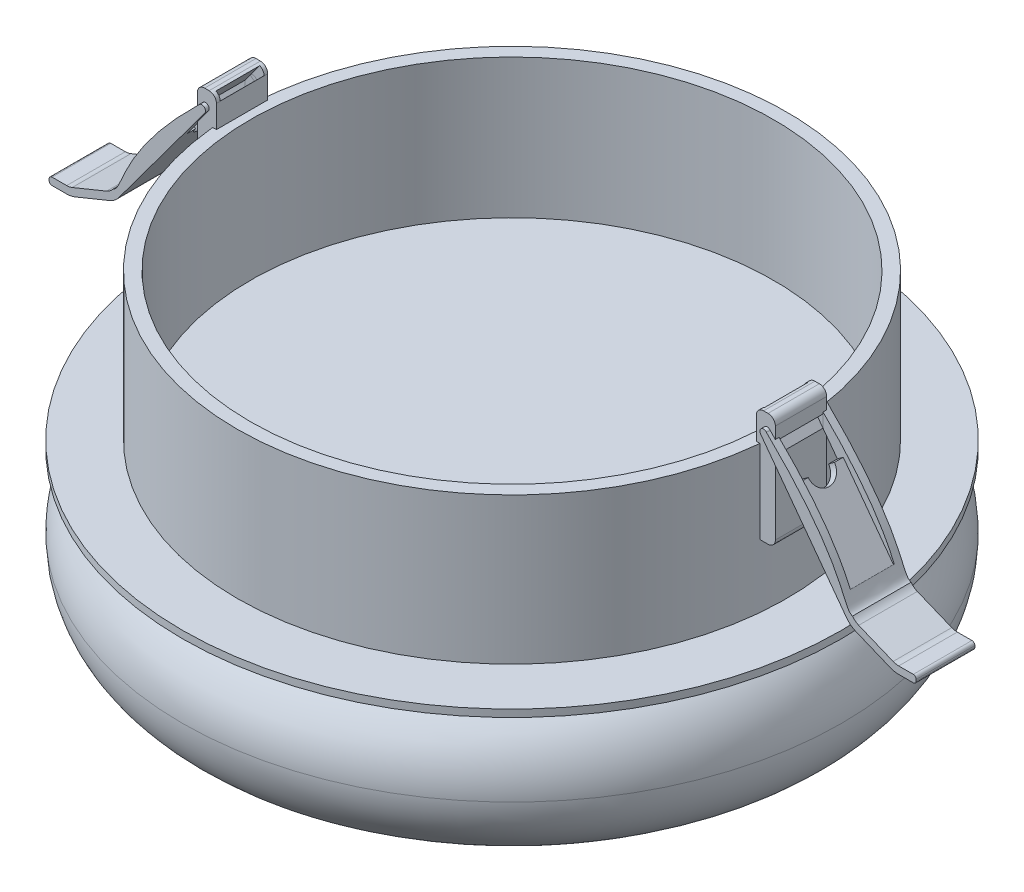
ISO-10303-21;
HEADER;
FILE_DESCRIPTION(('STEP AP214'),'2;1');
FILE_NAME('part.step','',(''),(''),'','','');
FILE_SCHEMA(('AUTOMOTIVE_DESIGN { 1 0 10303 214 1 1 1 1 }'));
ENDSEC;
DATA;
#1=APPLICATION_CONTEXT('core data for automotive mechanical design processes');
#2=APPLICATION_PROTOCOL_DEFINITION('international standard','automotive_design',2000,#1);
#3=PRODUCT_CONTEXT('',#1,'mechanical');
#4=PRODUCT('Part','Part','',(#3));
#5=PRODUCT_RELATED_PRODUCT_CATEGORY('part','',(#4));
#6=PRODUCT_DEFINITION_FORMATION('','',#4);
#7=PRODUCT_DEFINITION_CONTEXT('part definition',#1,'design');
#8=PRODUCT_DEFINITION('design','',#6,#7);
#9=PRODUCT_DEFINITION_SHAPE('','',#8);
#10=(LENGTH_UNIT() NAMED_UNIT(*) SI_UNIT(.MILLI.,.METRE.));
#11=(NAMED_UNIT(*) PLANE_ANGLE_UNIT() SI_UNIT($,.RADIAN.));
#12=(NAMED_UNIT(*) SI_UNIT($,.STERADIAN.) SOLID_ANGLE_UNIT());
#13=UNCERTAINTY_MEASURE_WITH_UNIT(LENGTH_MEASURE(1.E-05),#10,'distance_accuracy_value','');
#14=(GEOMETRIC_REPRESENTATION_CONTEXT(3) GLOBAL_UNCERTAINTY_ASSIGNED_CONTEXT((#13)) GLOBAL_UNIT_ASSIGNED_CONTEXT((#10,
#11,#12)) REPRESENTATION_CONTEXT('',''));
#15=CARTESIAN_POINT('',(0.,0.,0.));
#16=DIRECTION('',(0.,0.,1.));
#17=DIRECTION('',(1.,0.,0.));
#18=AXIS2_PLACEMENT_3D('',#15,#16,#17);
#19=CARTESIAN_POINT('',(4.75762274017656,-10.7639937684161,0.));
#20=DIRECTION('',(0.,-1.,0.));
#21=DIRECTION('',(0.,0.,-1.));
#22=AXIS2_PLACEMENT_3D('',#19,#20,#21);
#23=CYLINDRICAL_SURFACE('',#22,45.);
#24=CARTESIAN_POINT('',(4.75762274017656,-10.7639937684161,0.));
#25=DIRECTION('',(0.,1.,0.));
#26=DIRECTION('',(0.,0.,1.));
#27=AXIS2_PLACEMENT_3D('',#24,#25,#26);
#28=CIRCLE('',#27,45.);
#29=CARTESIAN_POINT('',(4.75762274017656,-10.7639937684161,45.));
#30=VERTEX_POINT('',#29);
#31=EDGE_CURVE('P0_E22',#30,#30,#28,.T.);
#32=ORIENTED_EDGE('',*,*,#31,.F.);
#33=EDGE_LOOP('',(#32));
#34=FACE_BOUND('',#33,.T.);
#35=CARTESIAN_POINT('',(4.75762274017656,-11.7639937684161,0.));
#36=DIRECTION('',(0.,1.,0.));
#37=DIRECTION('',(0.,0.,1.));
#38=AXIS2_PLACEMENT_3D('',#35,#36,#37);
#39=CIRCLE('',#38,45.);
#40=CARTESIAN_POINT('',(4.75762274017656,-11.7639937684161,45.));
#41=VERTEX_POINT('',#40);
#42=EDGE_CURVE('P0_E27',#41,#41,#39,.T.);
#43=ORIENTED_EDGE('',*,*,#42,.T.);
#44=EDGE_LOOP('',(#43));
#45=FACE_BOUND('',#44,.T.);
#46=ADVANCED_FACE('P0_F15',(#34,#45),#23,.T.);
#47=CARTESIAN_POINT('',(4.75762274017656,-10.7639937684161,0.));
#48=DIRECTION('',(0.,1.,0.));
#49=DIRECTION('',(0.,0.,1.));
#50=AXIS2_PLACEMENT_3D('',#47,#48,#49);
#51=PLANE('',#50);
#52=CARTESIAN_POINT('',(4.75762274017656,-10.7639937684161,0.));
#53=DIRECTION('',(0.,1.,0.));
#54=DIRECTION('',(0.,0.,1.));
#55=AXIS2_PLACEMENT_3D('',#52,#53,#54);
#56=CIRCLE('',#55,37.5);
#57=CARTESIAN_POINT('',(4.75762274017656,-10.7639937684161,37.5));
#58=VERTEX_POINT('',#57);
#59=EDGE_CURVE('P0_E10',#58,#58,#56,.T.);
#60=ORIENTED_EDGE('',*,*,#59,.F.);
#61=EDGE_LOOP('',(#60));
#62=FACE_BOUND('',#61,.T.);
#63=ORIENTED_EDGE('',*,*,#31,.T.);
#64=EDGE_LOOP('',(#63));
#65=FACE_BOUND('',#64,.T.);
#66=ADVANCED_FACE('P0_F61',(#62,#65),#51,.T.);
#67=CARTESIAN_POINT('',(4.75762274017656,-11.7639937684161,0.));
#68=DIRECTION('',(0.,1.,0.));
#69=DIRECTION('',(0.,0.,1.));
#70=AXIS2_PLACEMENT_3D('',#67,#68,#69);
#71=PLANE('',#70);
#72=ORIENTED_EDGE('',*,*,#42,.F.);
#73=EDGE_LOOP('',(#72));
#74=FACE_BOUND('',#73,.T.);
#75=ADVANCED_FACE('P0_F66',(#74),#71,.F.);
#76=CARTESIAN_POINT('',(4.75762274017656,9.23600623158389,0.));
#77=DIRECTION('',(0.,-1.,0.));
#78=DIRECTION('',(0.,0.,-1.));
#79=AXIS2_PLACEMENT_3D('',#76,#77,#78);
#80=CYLINDRICAL_SURFACE('',#79,37.5);
#81=CARTESIAN_POINT('',(4.75762274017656,9.23600623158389,0.));
#82=DIRECTION('',(0.,1.,0.));
#83=DIRECTION('',(0.,0.,1.));
#84=AXIS2_PLACEMENT_3D('',#81,#82,#83);
#85=CIRCLE('',#84,37.5);
#86=CARTESIAN_POINT('',(4.75762274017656,9.23600623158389,37.5));
#87=VERTEX_POINT('',#86);
#88=EDGE_CURVE('P0_E30',#87,#87,#85,.T.);
#89=ORIENTED_EDGE('',*,*,#88,.F.);
#90=EDGE_LOOP('',(#89));
#91=FACE_BOUND('',#90,.T.);
#92=ORIENTED_EDGE('',*,*,#59,.T.);
#93=EDGE_LOOP('',(#92));
#94=FACE_BOUND('',#93,.T.);
#95=ADVANCED_FACE('P0_F58',(#91,#94),#80,.T.);
#96=CARTESIAN_POINT('',(4.75762274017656,9.23600623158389,0.));
#97=DIRECTION('',(0.,1.,0.));
#98=DIRECTION('',(0.,0.,1.));
#99=AXIS2_PLACEMENT_3D('',#96,#97,#98);
#100=PLANE('',#99);
#101=CARTESIAN_POINT('',(4.75762274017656,9.23600623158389,0.));
#102=DIRECTION('',(0.,1.,0.));
#103=DIRECTION('',(0.,0.,1.));
#104=AXIS2_PLACEMENT_3D('',#101,#102,#103);
#105=CIRCLE('',#104,35.7106361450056);
#106=CARTESIAN_POINT('',(4.75762274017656,9.23600623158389,35.7106361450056));
#107=VERTEX_POINT('',#106);
#108=EDGE_CURVE('P0_E18',#107,#107,#105,.F.);
#109=ORIENTED_EDGE('',*,*,#108,.T.);
#110=EDGE_LOOP('',(#109));
#111=FACE_BOUND('',#110,.T.);
#112=ORIENTED_EDGE('',*,*,#88,.T.);
#113=EDGE_LOOP('',(#112));
#114=FACE_BOUND('',#113,.T.);
#115=ADVANCED_FACE('P0_F49',(#111,#114),#100,.T.);
#116=CARTESIAN_POINT('',(4.75762274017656,24.2360062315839,0.));
#117=DIRECTION('',(0.,-1.,0.));
#118=DIRECTION('',(0.,0.,-1.));
#119=AXIS2_PLACEMENT_3D('',#116,#117,#118);
#120=CYLINDRICAL_SURFACE('',#119,35.7106361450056);
#121=ORIENTED_EDGE('',*,*,#108,.F.);
#122=EDGE_LOOP('',(#121));
#123=FACE_BOUND('',#122,.T.);
#124=CARTESIAN_POINT('',(4.75762274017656,-9.7639937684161,0.));
#125=DIRECTION('',(0.,1.,0.));
#126=DIRECTION('',(0.,0.,1.));
#127=AXIS2_PLACEMENT_3D('',#124,#125,#126);
#128=CIRCLE('',#127,35.7106361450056);
#129=CARTESIAN_POINT('',(4.75762274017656,-9.7639937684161,35.7106361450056));
#130=VERTEX_POINT('',#129);
#131=EDGE_CURVE('P0_E39',#130,#130,#128,.T.);
#132=ORIENTED_EDGE('',*,*,#131,.F.);
#133=EDGE_LOOP('',(#132));
#134=FACE_BOUND('',#133,.T.);
#135=ADVANCED_FACE('P0_F47',(#123,#134),#120,.F.);
#136=CARTESIAN_POINT('',(4.75762274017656,-9.7639937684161,0.));
#137=DIRECTION('',(0.,1.,0.));
#138=DIRECTION('',(0.,0.,1.));
#139=AXIS2_PLACEMENT_3D('',#136,#137,#138);
#140=PLANE('',#139);
#141=ORIENTED_EDGE('',*,*,#131,.T.);
#142=EDGE_LOOP('',(#141));
#143=FACE_BOUND('',#142,.T.);
#144=ADVANCED_FACE('P0_F45',(#143),#140,.T.);
#145=CLOSED_SHELL('',(#46,#66,#75,#95,#115,#135,#144));
#146=MANIFOLD_SOLID_BREP('P0_B1',#145);
#147=CARTESIAN_POINT('',(-33.0754010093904,12.3360778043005,3.5));
#148=DIRECTION('',(0.,0.,-1.));
#149=DIRECTION('',(-1.,0.,0.));
#150=AXIS2_PLACEMENT_3D('',#147,#148,#149);
#151=CYLINDRICAL_SURFACE('',#150,1.);
#152=CARTESIAN_POINT('',(-33.0754010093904,12.3360778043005,-3.5));
#153=DIRECTION('',(0.,0.,1.));
#154=DIRECTION('',(-1.,0.,0.));
#155=AXIS2_PLACEMENT_3D('',#152,#153,#154);
#156=CIRCLE('',#155,1.);
#157=CARTESIAN_POINT('',(-32.0754010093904,12.3360778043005,-3.5));
#158=VERTEX_POINT('',#157);
#159=CARTESIAN_POINT('',(-33.0754010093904,13.3360778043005,-3.5));
#160=VERTEX_POINT('',#159);
#161=EDGE_CURVE('P1_E148',#158,#160,#156,.T.);
#162=ORIENTED_EDGE('',*,*,#161,.T.);
#163=DIRECTION('',(0.,0.,-1.));
#164=VECTOR('',#163,1.);
#165=CARTESIAN_POINT('',(-33.0754010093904,13.3360778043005,3.5));
#166=LINE('',#165,#164);
#167=CARTESIAN_POINT('',(-33.0754010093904,13.3360778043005,3.5));
#168=VERTEX_POINT('',#167);
#169=EDGE_CURVE('P1_E118',#168,#160,#166,.T.);
#170=ORIENTED_EDGE('',*,*,#169,.F.);
#171=CARTESIAN_POINT('',(-33.0754010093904,12.3360778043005,3.5));
#172=DIRECTION('',(0.,0.,1.));
#173=DIRECTION('',(-1.,0.,0.));
#174=AXIS2_PLACEMENT_3D('',#171,#172,#173);
#175=CIRCLE('',#174,1.);
#176=CARTESIAN_POINT('',(-32.0754010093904,12.3360778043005,3.5));
#177=VERTEX_POINT('',#176);
#178=EDGE_CURVE('P1_E162',#177,#168,#175,.T.);
#179=ORIENTED_EDGE('',*,*,#178,.F.);
#180=DIRECTION('',(0.,0.,-1.));
#181=VECTOR('',#180,1.);
#182=CARTESIAN_POINT('',(-32.0754010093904,12.3360778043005,3.5));
#183=LINE('',#182,#181);
#184=EDGE_CURVE('P1_E102',#177,#158,#183,.T.);
#185=ORIENTED_EDGE('',*,*,#184,.T.);
#186=EDGE_LOOP('',(#162,#170,#179,#185));
#187=FACE_BOUND('',#186,.T.);
#188=DIRECTION('',(0.,0.,-1.));
#189=VECTOR('',#188,1.);
#190=CARTESIAN_POINT('',(-32.0756652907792,12.359066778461,3.5));
#191=LINE('',#190,#189);
#192=CARTESIAN_POINT('',(-32.0756652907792,12.359066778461,2.9851983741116));
#193=VERTEX_POINT('',#192);
#194=CARTESIAN_POINT('',(-32.0756652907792,12.359066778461,-3.));
#195=VERTEX_POINT('',#194);
#196=EDGE_CURVE('P1_E170',#193,#195,#191,.T.);
#197=ORIENTED_EDGE('',*,*,#196,.F.);
#198=CARTESIAN_POINT('',(-33.0754010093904,12.3360778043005,2.9851983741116));
#199=DIRECTION('',(0.,0.,1.));
#200=DIRECTION('',(0.,-1.,0.));
#201=AXIS2_PLACEMENT_3D('',#198,#199,#200);
#202=CIRCLE('',#201,1.);
#203=CARTESIAN_POINT('',(-32.6625493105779,13.2468760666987,2.9851983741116));
#204=VERTEX_POINT('',#203);
#205=EDGE_CURVE('P1_E167',#193,#204,#202,.T.);
#206=ORIENTED_EDGE('',*,*,#205,.T.);
#207=DIRECTION('',(0.,0.,-1.));
#208=VECTOR('',#207,1.);
#209=CARTESIAN_POINT('',(-32.6625493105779,13.2468760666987,3.5));
#210=LINE('',#209,#208);
#211=CARTESIAN_POINT('',(-32.6625493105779,13.2468760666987,-3.));
#212=VERTEX_POINT('',#211);
#213=EDGE_CURVE('P1_E172',#204,#212,#210,.T.);
#214=ORIENTED_EDGE('',*,*,#213,.T.);
#215=CARTESIAN_POINT('',(-33.0754010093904,12.3360778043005,-3.));
#216=DIRECTION('',(0.,0.,-1.));
#217=DIRECTION('',(-1.,0.,0.));
#218=AXIS2_PLACEMENT_3D('',#215,#216,#217);
#219=CIRCLE('',#218,1.);
#220=EDGE_CURVE('P1_E109',#212,#195,#219,.T.);
#221=ORIENTED_EDGE('',*,*,#220,.T.);
#222=EDGE_LOOP('',(#197,#206,#214,#221));
#223=FACE_BOUND('',#222,.T.);
#224=ADVANCED_FACE('P1_F17',(#187,#223),#151,.T.);
#225=CARTESIAN_POINT('',(-34.6846479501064,-1.13140897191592,3.5));
#226=DIRECTION('',(1.,0.,0.));
#227=DIRECTION('',(0.,0.,-1.));
#228=AXIS2_PLACEMENT_3D('',#225,#226,#227);
#229=PLANE('',#228);
#230=DIRECTION('',(0.,-1.,0.));
#231=VECTOR('',#230,1.);
#232=CARTESIAN_POINT('',(-34.6846479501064,-1.13140897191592,-3.5));
#233=LINE('',#232,#231);
#234=CARTESIAN_POINT('',(-34.6846479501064,12.3360778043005,-3.5));
#235=VERTEX_POINT('',#234);
#236=CARTESIAN_POINT('',(-34.6846479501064,-1.13140897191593,-3.5));
#237=VERTEX_POINT('',#236);
#238=EDGE_CURVE('P1_E142',#235,#237,#233,.T.);
#239=ORIENTED_EDGE('',*,*,#238,.T.);
#240=DIRECTION('',(0.,0.,-1.));
#241=VECTOR('',#240,1.);
#242=CARTESIAN_POINT('',(-34.6846479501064,-1.13140897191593,3.5));
#243=LINE('',#242,#241);
#244=CARTESIAN_POINT('',(-34.6846479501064,-1.13140897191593,3.5));
#245=VERTEX_POINT('',#244);
#246=EDGE_CURVE('P1_E127',#245,#237,#243,.T.);
#247=ORIENTED_EDGE('',*,*,#246,.F.);
#248=DIRECTION('',(0.,-1.,0.));
#249=VECTOR('',#248,1.);
#250=CARTESIAN_POINT('',(-34.6846479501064,-1.13140897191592,3.5));
#251=LINE('',#250,#249);
#252=CARTESIAN_POINT('',(-34.6846479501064,12.3360778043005,3.5));
#253=VERTEX_POINT('',#252);
#254=EDGE_CURVE('P1_E156',#253,#245,#251,.T.);
#255=ORIENTED_EDGE('',*,*,#254,.F.);
#256=DIRECTION('',(0.,0.,-1.));
#257=VECTOR('',#256,1.);
#258=CARTESIAN_POINT('',(-34.6846479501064,12.3360778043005,3.5));
#259=LINE('',#258,#257);
#260=EDGE_CURVE('P1_E124',#253,#235,#259,.T.);
#261=ORIENTED_EDGE('',*,*,#260,.T.);
#262=EDGE_LOOP('',(#239,#247,#255,#261));
#263=FACE_BOUND('',#262,.T.);
#264=DIRECTION('',(0.,0.,1.));
#265=VECTOR('',#264,1.);
#266=CARTESIAN_POINT('',(-34.6846479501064,8.83606189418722,3.5));
#267=LINE('',#266,#265);
#268=CARTESIAN_POINT('',(-34.6846479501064,8.83606189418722,-3.));
#269=VERTEX_POINT('',#268);
#270=CARTESIAN_POINT('',(-34.6846479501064,8.83606189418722,2.9851983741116));
#271=VERTEX_POINT('',#270);
#272=EDGE_CURVE('P1_E11',#269,#271,#267,.T.);
#273=ORIENTED_EDGE('',*,*,#272,.F.);
#274=DIRECTION('',(0.,1.,0.));
#275=VECTOR('',#274,1.);
#276=CARTESIAN_POINT('',(-34.6846479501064,-1.13140897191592,-3.));
#277=LINE('',#276,#275);
#278=CARTESIAN_POINT('',(-34.6846479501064,10.5163621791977,-3.));
#279=VERTEX_POINT('',#278);
#280=EDGE_CURVE('P1_E25',#269,#279,#277,.T.);
#281=ORIENTED_EDGE('',*,*,#280,.T.);
#282=DIRECTION('',(0.,0.,1.));
#283=VECTOR('',#282,1.);
#284=CARTESIAN_POINT('',(-34.6846479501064,10.5163621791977,3.5));
#285=LINE('',#284,#283);
#286=CARTESIAN_POINT('',(-34.6846479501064,10.5163621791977,2.9851983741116));
#287=VERTEX_POINT('',#286);
#288=EDGE_CURVE('P1_E96',#279,#287,#285,.T.);
#289=ORIENTED_EDGE('',*,*,#288,.T.);
#290=DIRECTION('',(0.,-1.,0.));
#291=VECTOR('',#290,1.);
#292=CARTESIAN_POINT('',(-34.6846479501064,-1.13140897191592,2.9851983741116));
#293=LINE('',#292,#291);
#294=EDGE_CURVE('P1_E101',#287,#271,#293,.T.);
#295=ORIENTED_EDGE('',*,*,#294,.T.);
#296=EDGE_LOOP('',(#273,#281,#289,#295));
#297=FACE_BOUND('',#296,.T.);
#298=ADVANCED_FACE('P1_F113',(#263,#297),#229,.F.);
#299=CARTESIAN_POINT('',(-32.0754010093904,-2.13140897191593,3.5));
#300=DIRECTION('',(-1.,0.,0.));
#301=DIRECTION('',(0.,0.,1.));
#302=AXIS2_PLACEMENT_3D('',#299,#300,#301);
#303=PLANE('',#302);
#304=DIRECTION('',(0.,1.,0.));
#305=VECTOR('',#304,1.);
#306=CARTESIAN_POINT('',(-32.0754010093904,-2.13140897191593,-3.5));
#307=LINE('',#306,#305);
#308=CARTESIAN_POINT('',(-32.0754010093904,-2.13140897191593,-3.5));
#309=VERTEX_POINT('',#308);
#310=EDGE_CURVE('P1_E150',#309,#158,#307,.T.);
#311=ORIENTED_EDGE('',*,*,#310,.T.);
#312=ORIENTED_EDGE('',*,*,#184,.F.);
#313=DIRECTION('',(0.,1.,0.));
#314=VECTOR('',#313,1.);
#315=CARTESIAN_POINT('',(-32.0754010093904,-2.13140897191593,3.5));
#316=LINE('',#315,#314);
#317=CARTESIAN_POINT('',(-32.0754010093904,-2.13140897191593,3.5));
#318=VERTEX_POINT('',#317);
#319=EDGE_CURVE('P1_E139',#318,#177,#316,.T.);
#320=ORIENTED_EDGE('',*,*,#319,.F.);
#321=DIRECTION('',(0.,0.,-1.));
#322=VECTOR('',#321,1.);
#323=CARTESIAN_POINT('',(-32.0754010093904,-2.13140897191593,3.5));
#324=LINE('',#323,#322);
#325=EDGE_CURVE('P1_E133',#318,#309,#324,.T.);
#326=ORIENTED_EDGE('',*,*,#325,.T.);
#327=EDGE_LOOP('',(#311,#312,#320,#326));
#328=FACE_BOUND('',#327,.T.);
#329=ADVANCED_FACE('P1_F19',(#328),#303,.F.);
#330=CARTESIAN_POINT('',(-33.6846479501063,13.3360778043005,3.5));
#331=DIRECTION('',(0.,-1.,0.));
#332=DIRECTION('',(0.,0.,-1.));
#333=AXIS2_PLACEMENT_3D('',#330,#331,#332);
#334=PLANE('',#333);
#335=DIRECTION('',(-1.,0.,0.));
#336=VECTOR('',#335,1.);
#337=CARTESIAN_POINT('',(-33.6846479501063,13.3360778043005,-3.5));
#338=LINE('',#337,#336);
#339=CARTESIAN_POINT('',(-33.6846479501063,13.3360778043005,-3.5));
#340=VERTEX_POINT('',#339);
#341=EDGE_CURVE('P1_E146',#160,#340,#338,.T.);
#342=ORIENTED_EDGE('',*,*,#341,.T.);
#343=DIRECTION('',(0.,0.,-1.));
#344=VECTOR('',#343,1.);
#345=CARTESIAN_POINT('',(-33.6846479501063,13.3360778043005,3.5));
#346=LINE('',#345,#344);
#347=CARTESIAN_POINT('',(-33.6846479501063,13.3360778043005,3.5));
#348=VERTEX_POINT('',#347);
#349=EDGE_CURVE('P1_E121',#348,#340,#346,.T.);
#350=ORIENTED_EDGE('',*,*,#349,.F.);
#351=DIRECTION('',(-1.,0.,0.));
#352=VECTOR('',#351,1.);
#353=CARTESIAN_POINT('',(-33.6846479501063,13.3360778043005,3.5));
#354=LINE('',#353,#352);
#355=EDGE_CURVE('P1_E160',#168,#348,#354,.T.);
#356=ORIENTED_EDGE('',*,*,#355,.F.);
#357=ORIENTED_EDGE('',*,*,#169,.T.);
#358=EDGE_LOOP('',(#342,#350,#356,#357));
#359=FACE_BOUND('',#358,.T.);
#360=ADVANCED_FACE('P1_F205',(#359),#334,.F.);
#361=CARTESIAN_POINT('',(-33.6846479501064,12.3360778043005,3.5));
#362=DIRECTION('',(0.,0.,-1.));
#363=DIRECTION('',(-1.,0.,0.));
#364=AXIS2_PLACEMENT_3D('',#361,#362,#363);
#365=CYLINDRICAL_SURFACE('',#364,1.);
#366=CARTESIAN_POINT('',(-33.6846479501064,12.3360778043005,-3.5));
#367=DIRECTION('',(0.,0.,1.));
#368=DIRECTION('',(-1.,0.,0.));
#369=AXIS2_PLACEMENT_3D('',#366,#367,#368);
#370=CIRCLE('',#369,1.);
#371=EDGE_CURVE('P1_E144',#340,#235,#370,.T.);
#372=ORIENTED_EDGE('',*,*,#371,.T.);
#373=ORIENTED_EDGE('',*,*,#260,.F.);
#374=CARTESIAN_POINT('',(-33.6846479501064,12.3360778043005,3.5));
#375=DIRECTION('',(0.,0.,1.));
#376=DIRECTION('',(-1.,0.,0.));
#377=AXIS2_PLACEMENT_3D('',#374,#375,#376);
#378=CIRCLE('',#377,1.);
#379=EDGE_CURVE('P1_E158',#348,#253,#378,.T.);
#380=ORIENTED_EDGE('',*,*,#379,.F.);
#381=ORIENTED_EDGE('',*,*,#349,.T.);
#382=EDGE_LOOP('',(#372,#373,#380,#381));
#383=FACE_BOUND('',#382,.T.);
#384=ADVANCED_FACE('P1_F208',(#383),#365,.T.);
#385=CARTESIAN_POINT('',(-33.6846479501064,-1.13140897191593,3.5));
#386=DIRECTION('',(0.,0.,-1.));
#387=DIRECTION('',(-1.,0.,0.));
#388=AXIS2_PLACEMENT_3D('',#385,#386,#387);
#389=CYLINDRICAL_SURFACE('',#388,1.);
#390=CARTESIAN_POINT('',(-33.6846479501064,-1.13140897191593,-3.5));
#391=DIRECTION('',(0.,0.,1.));
#392=DIRECTION('',(-1.,0.,0.));
#393=AXIS2_PLACEMENT_3D('',#390,#391,#392);
#394=CIRCLE('',#393,1.);
#395=CARTESIAN_POINT('',(-33.6846479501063,-2.13140897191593,-3.5));
#396=VERTEX_POINT('',#395);
#397=EDGE_CURVE('P1_E140',#237,#396,#394,.T.);
#398=ORIENTED_EDGE('',*,*,#397,.T.);
#399=DIRECTION('',(0.,0.,-1.));
#400=VECTOR('',#399,1.);
#401=CARTESIAN_POINT('',(-33.6846479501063,-2.13140897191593,3.5));
#402=LINE('',#401,#400);
#403=CARTESIAN_POINT('',(-33.6846479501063,-2.13140897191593,3.5));
#404=VERTEX_POINT('',#403);
#405=EDGE_CURVE('P1_E130',#404,#396,#402,.T.);
#406=ORIENTED_EDGE('',*,*,#405,.F.);
#407=CARTESIAN_POINT('',(-33.6846479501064,-1.13140897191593,3.5));
#408=DIRECTION('',(0.,0.,1.));
#409=DIRECTION('',(-1.,0.,0.));
#410=AXIS2_PLACEMENT_3D('',#407,#408,#409);
#411=CIRCLE('',#410,1.);
#412=EDGE_CURVE('P1_E154',#245,#404,#411,.T.);
#413=ORIENTED_EDGE('',*,*,#412,.F.);
#414=ORIENTED_EDGE('',*,*,#246,.T.);
#415=EDGE_LOOP('',(#398,#406,#413,#414));
#416=FACE_BOUND('',#415,.T.);
#417=ADVANCED_FACE('P1_F211',(#416),#389,.T.);
#418=CARTESIAN_POINT('',(-33.6846479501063,-2.13140897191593,3.5));
#419=DIRECTION('',(0.,1.,0.));
#420=DIRECTION('',(0.,0.,1.));
#421=AXIS2_PLACEMENT_3D('',#418,#419,#420);
#422=PLANE('',#421);
#423=DIRECTION('',(1.,0.,0.));
#424=VECTOR('',#423,1.);
#425=CARTESIAN_POINT('',(-33.6846479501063,-2.13140897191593,-3.5));
#426=LINE('',#425,#424);
#427=EDGE_CURVE('P1_E137',#396,#309,#426,.T.);
#428=ORIENTED_EDGE('',*,*,#427,.T.);
#429=ORIENTED_EDGE('',*,*,#325,.F.);
#430=DIRECTION('',(1.,0.,0.));
#431=VECTOR('',#430,1.);
#432=CARTESIAN_POINT('',(-33.6846479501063,-2.13140897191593,3.5));
#433=LINE('',#432,#431);
#434=EDGE_CURVE('P1_E136',#404,#318,#433,.T.);
#435=ORIENTED_EDGE('',*,*,#434,.F.);
#436=ORIENTED_EDGE('',*,*,#405,.T.);
#437=EDGE_LOOP('',(#428,#429,#435,#436));
#438=FACE_BOUND('',#437,.T.);
#439=ADVANCED_FACE('P1_F216',(#438),#422,.F.);
#440=CARTESIAN_POINT('',(-33.0754010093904,12.3360778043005,3.5));
#441=DIRECTION('',(0.,0.,-1.));
#442=DIRECTION('',(-1.,0.,0.));
#443=AXIS2_PLACEMENT_3D('',#440,#441,#442);
#444=PLANE('',#443);
#445=ORIENTED_EDGE('',*,*,#319,.T.);
#446=ORIENTED_EDGE('',*,*,#178,.T.);
#447=ORIENTED_EDGE('',*,*,#355,.T.);
#448=ORIENTED_EDGE('',*,*,#379,.T.);
#449=ORIENTED_EDGE('',*,*,#254,.T.);
#450=ORIENTED_EDGE('',*,*,#412,.T.);
#451=ORIENTED_EDGE('',*,*,#434,.T.);
#452=EDGE_LOOP('',(#445,#446,#447,#448,#449,#450,#451));
#453=FACE_BOUND('',#452,.T.);
#454=ADVANCED_FACE('P1_F220',(#453),#444,.F.);
#455=CARTESIAN_POINT('',(-33.0754010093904,12.3360778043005,-3.5));
#456=DIRECTION('',(0.,0.,-1.));
#457=DIRECTION('',(-1.,0.,0.));
#458=AXIS2_PLACEMENT_3D('',#455,#456,#457);
#459=PLANE('',#458);
#460=ORIENTED_EDGE('',*,*,#310,.F.);
#461=ORIENTED_EDGE('',*,*,#427,.F.);
#462=ORIENTED_EDGE('',*,*,#397,.F.);
#463=ORIENTED_EDGE('',*,*,#238,.F.);
#464=ORIENTED_EDGE('',*,*,#371,.F.);
#465=ORIENTED_EDGE('',*,*,#341,.F.);
#466=ORIENTED_EDGE('',*,*,#161,.F.);
#467=EDGE_LOOP('',(#460,#461,#462,#463,#464,#465,#466));
#468=FACE_BOUND('',#467,.T.);
#469=ADVANCED_FACE('P1_F194',(#468),#459,.T.);
#470=CARTESIAN_POINT('',(-30.1811372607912,14.9173173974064,-3.));
#471=DIRECTION('',(0.,0.,-1.));
#472=DIRECTION('',(-1.,0.,0.));
#473=AXIS2_PLACEMENT_3D('',#470,#471,#472);
#474=PLANE('',#473);
#475=DIRECTION('',(-0.595131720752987,-0.803628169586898,0.));
#476=VECTOR('',#475,1.);
#477=CARTESIAN_POINT('',(-30.9847654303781,15.5124491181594,-3.));
#478=LINE('',#477,#476);
#479=EDGE_CURVE('P1_E32',#212,#279,#478,.T.);
#480=ORIENTED_EDGE('',*,*,#479,.T.);
#481=ORIENTED_EDGE('',*,*,#280,.F.);
#482=DIRECTION('',(-0.595131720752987,-0.803628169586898,0.));
#483=VECTOR('',#482,1.);
#484=CARTESIAN_POINT('',(-30.1811372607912,14.9173173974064,-3.));
#485=LINE('',#484,#483);
#486=EDGE_CURVE('P1_E175',#195,#269,#485,.T.);
#487=ORIENTED_EDGE('',*,*,#486,.F.);
#488=ORIENTED_EDGE('',*,*,#220,.F.);
#489=EDGE_LOOP('',(#480,#481,#487,#488));
#490=FACE_BOUND('',#489,.T.);
#491=ADVANCED_FACE('P1_F105',(#490),#474,.F.);
#492=CARTESIAN_POINT('',(-30.1811372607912,14.9173173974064,2.9851983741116));
#493=DIRECTION('',(0.,0.,1.));
#494=DIRECTION('',(0.,-1.,0.));
#495=AXIS2_PLACEMENT_3D('',#492,#493,#494);
#496=PLANE('',#495);
#497=DIRECTION('',(0.595131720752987,0.803628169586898,0.));
#498=VECTOR('',#497,1.);
#499=CARTESIAN_POINT('',(-30.1811372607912,14.9173173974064,2.9851983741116));
#500=LINE('',#499,#498);
#501=EDGE_CURVE('P1_E174',#271,#193,#500,.T.);
#502=ORIENTED_EDGE('',*,*,#501,.F.);
#503=ORIENTED_EDGE('',*,*,#294,.F.);
#504=DIRECTION('',(0.595131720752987,0.803628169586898,0.));
#505=VECTOR('',#504,1.);
#506=CARTESIAN_POINT('',(-30.9847654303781,15.5124491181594,2.9851983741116));
#507=LINE('',#506,#505);
#508=EDGE_CURVE('P1_E37',#287,#204,#507,.T.);
#509=ORIENTED_EDGE('',*,*,#508,.T.);
#510=ORIENTED_EDGE('',*,*,#205,.F.);
#511=EDGE_LOOP('',(#502,#503,#509,#510));
#512=FACE_BOUND('',#511,.T.);
#513=ADVANCED_FACE('P1_F185',(#512),#496,.F.);
#514=CARTESIAN_POINT('',(-36.6465695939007,6.18680720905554,-0.00740081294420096));
#515=DIRECTION('',(-0.803628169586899,0.595131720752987,0.));
#516=DIRECTION('',(-0.595131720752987,-0.803628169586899,0.));
#517=AXIS2_PLACEMENT_3D('',#514,#515,#516);
#518=PLANE('',#517);
#519=ORIENTED_EDGE('',*,*,#196,.T.);
#520=ORIENTED_EDGE('',*,*,#486,.T.);
#521=ORIENTED_EDGE('',*,*,#272,.T.);
#522=ORIENTED_EDGE('',*,*,#501,.T.);
#523=EDGE_LOOP('',(#519,#520,#521,#522));
#524=FACE_BOUND('',#523,.T.);
#525=ADVANCED_FACE('P1_F180',(#524),#518,.T.);
#526=CARTESIAN_POINT('',(-37.4501977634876,6.78193892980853,-0.00740081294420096));
#527=DIRECTION('',(-0.803628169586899,0.595131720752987,0.));
#528=DIRECTION('',(-0.595131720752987,-0.803628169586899,0.));
#529=AXIS2_PLACEMENT_3D('',#526,#527,#528);
#530=PLANE('',#529);
#531=ORIENTED_EDGE('',*,*,#508,.F.);
#532=ORIENTED_EDGE('',*,*,#288,.F.);
#533=ORIENTED_EDGE('',*,*,#479,.F.);
#534=ORIENTED_EDGE('',*,*,#213,.F.);
#535=EDGE_LOOP('',(#531,#532,#533,#534));
#536=FACE_BOUND('',#535,.T.);
#537=ADVANCED_FACE('P1_F97',(#536),#530,.F.);
#538=CLOSED_SHELL('',(#224,#298,#329,#360,#384,#417,#439,#454,#469,#491,#513,#525,#537));
#539=MANIFOLD_SOLID_BREP('P1_B1',#538);
#540=CARTESIAN_POINT('',(-33.5688767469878,11.1828787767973,4.));
#541=DIRECTION('',(0.,0.,-1.));
#542=DIRECTION('',(-1.,0.,0.));
#543=AXIS2_PLACEMENT_3D('',#540,#541,#542);
#544=CYLINDRICAL_SURFACE('',#543,0.500000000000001);
#545=DIRECTION('',(0.,0.,-1.));
#546=VECTOR('',#545,1.);
#547=CARTESIAN_POINT('',(-33.9706908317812,11.4804446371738,4.));
#548=LINE('',#547,#546);
#549=CARTESIAN_POINT('',(-33.9706908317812,11.4804446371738,-3.));
#550=VERTEX_POINT('',#549);
#551=CARTESIAN_POINT('',(-33.9706908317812,11.4804446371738,-4.));
#552=VERTEX_POINT('',#551);
#553=EDGE_CURVE('P2_E25',#550,#552,#548,.T.);
#554=ORIENTED_EDGE('',*,*,#553,.F.);
#555=CARTESIAN_POINT('',(-33.5688767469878,11.1828787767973,-3.));
#556=DIRECTION('',(0.,0.,-1.));
#557=DIRECTION('',(-1.,0.,0.));
#558=AXIS2_PLACEMENT_3D('',#555,#556,#557);
#559=CIRCLE('',#558,0.500000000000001);
#560=CARTESIAN_POINT('',(-33.1670626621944,10.8853129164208,-3.));
#561=VERTEX_POINT('',#560);
#562=EDGE_CURVE('P2_E308',#550,#561,#559,.T.);
#563=ORIENTED_EDGE('',*,*,#562,.T.);
#564=DIRECTION('',(0.,0.,-1.));
#565=VECTOR('',#564,1.);
#566=CARTESIAN_POINT('',(-33.1670626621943,10.8853129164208,4.));
#567=LINE('',#566,#565);
#568=CARTESIAN_POINT('',(-33.1670626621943,10.8853129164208,-4.));
#569=VERTEX_POINT('',#568);
#570=EDGE_CURVE('P2_E93',#561,#569,#567,.T.);
#571=ORIENTED_EDGE('',*,*,#570,.T.);
#572=CARTESIAN_POINT('',(-33.5688767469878,11.1828787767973,-4.));
#573=DIRECTION('',(0.,0.,1.));
#574=DIRECTION('',(1.,0.,0.));
#575=AXIS2_PLACEMENT_3D('',#572,#573,#574);
#576=CIRCLE('',#575,0.500000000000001);
#577=EDGE_CURVE('P2_E162',#569,#552,#576,.T.);
#578=ORIENTED_EDGE('',*,*,#577,.T.);
#579=EDGE_LOOP('',(#554,#563,#571,#578));
#580=FACE_BOUND('',#579,.T.);
#581=ADVANCED_FACE('P2_F17',(#580),#544,.T.);
#582=CARTESIAN_POINT('',(-33.9706908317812,11.4804446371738,4.));
#583=CARTESIAN_POINT('',(-44.9336920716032,0.835747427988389,4.));
#584=CARTESIAN_POINT('',(-44.1906093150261,-3.79706733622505,4.));
#585=CARTESIAN_POINT('',(-45.7039620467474,-4.36342141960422,4.));
#586=B_SPLINE_CURVE_WITH_KNOTS('',3,(#582,#583,#584,#585),.UNSPECIFIED.,.F.,.F.,(4,4),(0.,1.),.UNSPECIFIED.);
#587=DIRECTION('',(0.,0.,-1.));
#588=VECTOR('',#587,1.);
#589=SURFACE_OF_LINEAR_EXTRUSION('',#586,#588);
#590=CARTESIAN_POINT('',(-33.9706908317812,11.4804446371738,-3.));
#591=CARTESIAN_POINT('',(-34.3151683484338,11.1459409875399,-3.));
#592=CARTESIAN_POINT('',(-34.6570408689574,10.8087333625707,-3.));
#593=CARTESIAN_POINT('',(-35.3364778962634,10.1268724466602,-3.));
#594=CARTESIAN_POINT('',(-35.6740149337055,9.78219179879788,-3.));
#595=CARTESIAN_POINT('',(-36.3435167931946,9.08535600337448,-3.));
#596=CARTESIAN_POINT('',(-36.6754606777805,8.73318070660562,-3.));
#597=CARTESIAN_POINT('',(-37.3324058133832,8.02123989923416,-3.));
#598=CARTESIAN_POINT('',(-37.6573936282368,7.66146197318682,-3.));
#599=CARTESIAN_POINT('',(-38.2989671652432,6.93411124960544,-3.));
#600=CARTESIAN_POINT('',(-38.6155479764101,6.56653411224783,-3.));
#601=CARTESIAN_POINT('',(-39.2324647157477,5.83072392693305,-3.));
#602=CARTESIAN_POINT('',(-39.5330006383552,5.4626588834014,-3.));
#603=CARTESIAN_POINT('',(-40.1229043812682,4.71821387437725,-3.));
#604=CARTESIAN_POINT('',(-40.4122821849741,4.34184183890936,-3.));
#605=CARTESIAN_POINT('',(-40.978045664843,3.58015267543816,-3.));
#606=CARTESIAN_POINT('',(-41.2544470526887,3.19484725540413,-3.));
#607=CARTESIAN_POINT('',(-41.7921888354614,2.41449873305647,-3.));
#608=CARTESIAN_POINT('',(-42.0535463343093,2.01946744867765,-3.));
#609=CARTESIAN_POINT('',(-42.5588933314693,1.2186538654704,-3.));
#610=CARTESIAN_POINT('',(-42.8028916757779,0.812877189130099,-3.));
#611=CARTESIAN_POINT('',(-43.1217202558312,0.252424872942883,-3.));
#612=CARTESIAN_POINT('',(-43.2052041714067,0.102636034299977,-3.));
#613=CARTESIAN_POINT('',(-43.3694805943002,-0.198444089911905,-3.));
#614=CARTESIAN_POINT('',(-43.4502726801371,-0.349735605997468,-3.));
#615=CARTESIAN_POINT('',(-43.6090945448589,-0.653780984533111,-3.));
#616=CARTESIAN_POINT('',(-43.6871240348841,-0.806534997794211,-3.));
#617=CARTESIAN_POINT('',(-43.8407568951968,-1.11407626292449,-3.));
#618=CARTESIAN_POINT('',(-43.9163484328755,-1.26886942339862,-3.));
#619=CARTESIAN_POINT('',(-44.0649096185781,-1.57969625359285,-3.));
#620=CARTESIAN_POINT('',(-44.1378794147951,-1.73572985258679,-3.));
#621=CARTESIAN_POINT('',(-44.2457153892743,-1.97050043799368,-3.));
#622=CARTESIAN_POINT('',(-44.281387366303,-2.04886928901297,-3.));
#623=CARTESIAN_POINT('',(-44.3523181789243,-2.20579208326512,-3.));
#624=CARTESIAN_POINT('',(-44.3875770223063,-2.28434602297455,-3.));
#625=CARTESIAN_POINT('',(-44.4226918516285,-2.36296388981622,-3.));
#626=B_SPLINE_CURVE_WITH_KNOTS('',3,(#590,#591,#592,#593,#594,#595,#596,#597,#598,#599,#600,
#601,#602,#603,#604,#605,#606,#607,#608,#609,#610,#611,#612,#613,#614,#615,#616,#617,#618,#619,
#620,#621,#622,#623,#624,#625),.UNSPECIFIED.,.F.,.F.,(4,2,2,2,2,2,2,2,2,2,2,2,2,2,2,2,2,4),(0.,
1.4404993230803,2.88770561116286,4.33947732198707,5.79383792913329,7.24903020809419,
8.67438327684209,10.0984299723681,11.5207054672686,12.9413306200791,14.3612265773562,
14.8756534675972,15.390160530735,15.9047212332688,16.4214874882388,16.9382244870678,
17.1965402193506,17.4548510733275),.UNSPECIFIED.);
#627=CARTESIAN_POINT('',(-44.4226918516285,-2.36296388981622,-3.));
#628=VERTEX_POINT('',#627);
#629=EDGE_CURVE('P2_E236',#550,#628,#626,.T.);
#630=ORIENTED_EDGE('',*,*,#629,.F.);
#631=ORIENTED_EDGE('',*,*,#553,.T.);
#632=CARTESIAN_POINT('',(-33.9706908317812,11.4804446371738,-4.));
#633=CARTESIAN_POINT('',(-44.9336920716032,0.835747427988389,-4.));
#634=CARTESIAN_POINT('',(-44.1906093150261,-3.79706733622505,-4.));
#635=CARTESIAN_POINT('',(-45.7039620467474,-4.36342141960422,-4.));
#636=B_SPLINE_CURVE_WITH_KNOTS('',3,(#632,#633,#634,#635),.UNSPECIFIED.,.F.,.F.,(4,4),(0.,1.),.UNSPECIFIED.);
#637=CARTESIAN_POINT('',(-45.7039620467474,-4.36342141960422,-4.));
#638=VERTEX_POINT('',#637);
#639=EDGE_CURVE('P2_E164',#552,#638,#636,.T.);
#640=ORIENTED_EDGE('',*,*,#639,.T.);
#641=DIRECTION('',(0.,0.,-1.));
#642=VECTOR('',#641,1.);
#643=CARTESIAN_POINT('',(-45.7039620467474,-4.36342141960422,4.));
#644=LINE('',#643,#642);
#645=CARTESIAN_POINT('',(-45.7039620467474,-4.36342141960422,4.));
#646=VERTEX_POINT('',#645);
#647=EDGE_CURVE('P2_E224',#646,#638,#644,.T.);
#648=ORIENTED_EDGE('',*,*,#647,.F.);
#649=CARTESIAN_POINT('',(-33.9706908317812,11.4804446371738,4.));
#650=VERTEX_POINT('',#649);
#651=EDGE_CURVE('P2_E101',#650,#646,#586,.T.);
#652=ORIENTED_EDGE('',*,*,#651,.F.);
#653=CARTESIAN_POINT('',(-33.9706908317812,11.4804446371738,3.));
#654=VERTEX_POINT('',#653);
#655=EDGE_CURVE('P2_E11',#650,#654,#548,.T.);
#656=ORIENTED_EDGE('',*,*,#655,.T.);
#657=CARTESIAN_POINT('',(-33.9706908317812,11.4804446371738,3.));
#658=CARTESIAN_POINT('',(-34.3151683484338,11.1459409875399,3.));
#659=CARTESIAN_POINT('',(-34.6570408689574,10.8087333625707,3.));
#660=CARTESIAN_POINT('',(-35.3364778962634,10.1268724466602,3.));
#661=CARTESIAN_POINT('',(-35.6740149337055,9.78219179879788,3.));
#662=CARTESIAN_POINT('',(-36.3435167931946,9.08535600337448,3.));
#663=CARTESIAN_POINT('',(-36.6754606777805,8.73318070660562,3.));
#664=CARTESIAN_POINT('',(-37.3324058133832,8.02123989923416,3.));
#665=CARTESIAN_POINT('',(-37.6573936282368,7.66146197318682,3.));
#666=CARTESIAN_POINT('',(-38.2989671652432,6.93411124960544,3.));
#667=CARTESIAN_POINT('',(-38.6155479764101,6.56653411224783,3.));
#668=CARTESIAN_POINT('',(-39.2324647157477,5.83072392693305,3.));
#669=CARTESIAN_POINT('',(-39.5330006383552,5.4626588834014,3.));
#670=CARTESIAN_POINT('',(-40.1229043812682,4.71821387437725,3.));
#671=CARTESIAN_POINT('',(-40.4122821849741,4.34184183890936,3.));
#672=CARTESIAN_POINT('',(-40.978045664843,3.58015267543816,3.));
#673=CARTESIAN_POINT('',(-41.2544470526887,3.19484725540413,3.));
#674=CARTESIAN_POINT('',(-41.7921888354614,2.41449873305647,3.));
#675=CARTESIAN_POINT('',(-42.0535463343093,2.01946744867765,3.));
#676=CARTESIAN_POINT('',(-42.5588933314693,1.2186538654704,3.));
#677=CARTESIAN_POINT('',(-42.8028916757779,0.812877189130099,3.));
#678=CARTESIAN_POINT('',(-43.1217202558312,0.252424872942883,3.));
#679=CARTESIAN_POINT('',(-43.2052041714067,0.102636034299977,3.));
#680=CARTESIAN_POINT('',(-43.3694805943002,-0.198444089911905,3.));
#681=CARTESIAN_POINT('',(-43.4502726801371,-0.349735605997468,3.));
#682=CARTESIAN_POINT('',(-43.6090945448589,-0.653780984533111,3.));
#683=CARTESIAN_POINT('',(-43.6871240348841,-0.806534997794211,3.));
#684=CARTESIAN_POINT('',(-43.8407568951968,-1.11407626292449,3.));
#685=CARTESIAN_POINT('',(-43.9163484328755,-1.26886942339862,3.));
#686=CARTESIAN_POINT('',(-44.0649096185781,-1.57969625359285,3.));
#687=CARTESIAN_POINT('',(-44.1378794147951,-1.73572985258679,3.));
#688=CARTESIAN_POINT('',(-44.2457153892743,-1.97050043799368,3.));
#689=CARTESIAN_POINT('',(-44.281387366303,-2.04886928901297,3.));
#690=CARTESIAN_POINT('',(-44.3523181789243,-2.20579208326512,3.));
#691=CARTESIAN_POINT('',(-44.3875770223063,-2.28434602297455,3.));
#692=CARTESIAN_POINT('',(-44.4226918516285,-2.36296388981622,3.));
#693=B_SPLINE_CURVE_WITH_KNOTS('',3,(#657,#658,#659,#660,#661,#662,#663,#664,#665,#666,#667,
#668,#669,#670,#671,#672,#673,#674,#675,#676,#677,#678,#679,#680,#681,#682,#683,#684,#685,#686,
#687,#688,#689,#690,#691,#692),.UNSPECIFIED.,.F.,.F.,(4,2,2,2,2,2,2,2,2,2,2,2,2,2,2,2,2,4),(0.,
1.4404993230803,2.88770561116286,4.33947732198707,5.79383792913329,7.24903020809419,
8.67438327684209,10.0984299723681,11.5207054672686,12.9413306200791,14.3612265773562,
14.8756534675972,15.390160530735,15.9047212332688,16.4214874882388,16.9382244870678,
17.1965402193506,17.4548510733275),.UNSPECIFIED.);
#694=CARTESIAN_POINT('',(-44.4226918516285,-2.36296388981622,3.));
#695=VERTEX_POINT('',#694);
#696=EDGE_CURVE('P2_E32',#654,#695,#693,.T.);
#697=ORIENTED_EDGE('',*,*,#696,.T.);
#698=DIRECTION('',(0.,0.,-1.));
#699=VECTOR('',#698,1.);
#700=CARTESIAN_POINT('',(-44.4226918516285,-2.36296388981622,3.));
#701=LINE('',#700,#699);
#702=EDGE_CURVE('P2_E458',#695,#628,#701,.T.);
#703=ORIENTED_EDGE('',*,*,#702,.T.);
#704=EDGE_LOOP('',(#630,#631,#640,#648,#652,#656,#697,#703));
#705=FACE_BOUND('',#704,.T.);
#706=ADVANCED_FACE('P2_F232',(#705),#589,.F.);
#707=CARTESIAN_POINT('',(-33.1670626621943,10.8853129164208,4.));
#708=VERTEX_POINT('',#707);
#709=CARTESIAN_POINT('',(-33.1670626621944,10.8853129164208,2.9851983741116));
#710=VERTEX_POINT('',#709);
#711=EDGE_CURVE('P2_E196',#708,#710,#567,.T.);
#712=ORIENTED_EDGE('',*,*,#711,.T.);
#713=CARTESIAN_POINT('',(-33.5688767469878,11.1828787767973,2.9851983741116));
#714=DIRECTION('',(0.,0.,1.));
#715=DIRECTION('',(0.,-1.,0.));
#716=AXIS2_PLACEMENT_3D('',#713,#714,#715);
#717=CIRCLE('',#716,0.500000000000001);
#718=CARTESIAN_POINT('',(-33.9706908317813,11.4804446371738,2.9851983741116));
#719=VERTEX_POINT('',#718);
#720=EDGE_CURVE('P2_E261',#710,#719,#717,.T.);
#721=ORIENTED_EDGE('',*,*,#720,.T.);
#722=DIRECTION('',(0.,0.,-1.));
#723=VECTOR('',#722,1.);
#724=CARTESIAN_POINT('',(-33.9706908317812,11.4804446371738,3.));
#725=LINE('',#724,#723);
#726=EDGE_CURVE('P2_E342',#654,#719,#725,.T.);
#727=ORIENTED_EDGE('',*,*,#726,.F.);
#728=ORIENTED_EDGE('',*,*,#655,.F.);
#729=CARTESIAN_POINT('',(-33.5688767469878,11.1828787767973,4.));
#730=DIRECTION('',(0.,0.,1.));
#731=DIRECTION('',(1.,0.,0.));
#732=AXIS2_PLACEMENT_3D('',#729,#730,#731);
#733=CIRCLE('',#732,0.500000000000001);
#734=EDGE_CURVE('P2_E195',#708,#650,#733,.T.);
#735=ORIENTED_EDGE('',*,*,#734,.F.);
#736=EDGE_LOOP('',(#712,#721,#727,#728,#735));
#737=FACE_BOUND('',#736,.T.);
#738=ADVANCED_FACE('P2_F19',(#737),#544,.T.);
#739=CARTESIAN_POINT('',(-47.3112183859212,-3.17315797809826,4.));
#740=DIRECTION('',(0.,0.,-1.));
#741=DIRECTION('',(-1.,0.,0.));
#742=AXIS2_PLACEMENT_3D('',#739,#740,#741);
#743=CYLINDRICAL_SURFACE('',#742,2.);
#744=CARTESIAN_POINT('',(-47.3112183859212,-3.17315797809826,-4.));
#745=DIRECTION('',(0.,0.,-1.));
#746=DIRECTION('',(-1.,0.,0.));
#747=AXIS2_PLACEMENT_3D('',#744,#745,#746);
#748=CIRCLE('',#747,2.);
#749=CARTESIAN_POINT('',(-46.5543069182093,-5.02439676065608,-4.));
#750=VERTEX_POINT('',#749);
#751=EDGE_CURVE('P2_E169',#638,#750,#748,.T.);
#752=ORIENTED_EDGE('',*,*,#751,.T.);
#753=DIRECTION('',(0.,0.,-1.));
#754=VECTOR('',#753,1.);
#755=CARTESIAN_POINT('',(-46.5543069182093,-5.02439676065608,4.));
#756=LINE('',#755,#754);
#757=CARTESIAN_POINT('',(-46.5543069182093,-5.02439676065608,4.));
#758=VERTEX_POINT('',#757);
#759=EDGE_CURVE('P2_E222',#758,#750,#756,.T.);
#760=ORIENTED_EDGE('',*,*,#759,.F.);
#761=CARTESIAN_POINT('',(-47.3112183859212,-3.17315797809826,4.));
#762=DIRECTION('',(0.,0.,-1.));
#763=DIRECTION('',(-1.,0.,0.));
#764=AXIS2_PLACEMENT_3D('',#761,#762,#763);
#765=CIRCLE('',#764,2.);
#766=EDGE_CURVE('P2_E403',#646,#758,#765,.T.);
#767=ORIENTED_EDGE('',*,*,#766,.F.);
#768=ORIENTED_EDGE('',*,*,#647,.T.);
#769=EDGE_LOOP('',(#752,#760,#767,#768));
#770=FACE_BOUND('',#769,.T.);
#771=ADVANCED_FACE('P2_F248',(#770),#743,.F.);
#772=CARTESIAN_POINT('',(-46.5543069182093,-5.02439676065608,4.));
#773=DIRECTION('',(0.37845573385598,-0.925619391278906,0.));
#774=DIRECTION('',(0.925619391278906,0.37845573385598,0.));
#775=AXIS2_PLACEMENT_3D('',#772,#773,#774);
#776=PLANE('',#775);
#777=DIRECTION('',(-0.925619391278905,-0.37845573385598,0.));
#778=VECTOR('',#777,1.);
#779=CARTESIAN_POINT('',(-46.5543069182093,-5.02439676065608,-4.));
#780=LINE('',#779,#778);
#781=CARTESIAN_POINT('',(-51.2568229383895,-6.94710297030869,-4.));
#782=VERTEX_POINT('',#781);
#783=EDGE_CURVE('P2_E174',#750,#782,#780,.T.);
#784=ORIENTED_EDGE('',*,*,#783,.T.);
#785=DIRECTION('',(0.,0.,-1.));
#786=VECTOR('',#785,1.);
#787=CARTESIAN_POINT('',(-51.2568229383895,-6.94710297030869,4.));
#788=LINE('',#787,#786);
#789=CARTESIAN_POINT('',(-51.2568229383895,-6.94710297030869,4.));
#790=VERTEX_POINT('',#789);
#791=EDGE_CURVE('P2_E219',#790,#782,#788,.T.);
#792=ORIENTED_EDGE('',*,*,#791,.F.);
#793=DIRECTION('',(-0.925619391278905,-0.37845573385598,0.));
#794=VECTOR('',#793,1.);
#795=CARTESIAN_POINT('',(-46.5543069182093,-5.02439676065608,4.));
#796=LINE('',#795,#794);
#797=EDGE_CURVE('P2_E408',#758,#790,#796,.T.);
#798=ORIENTED_EDGE('',*,*,#797,.F.);
#799=ORIENTED_EDGE('',*,*,#759,.T.);
#800=EDGE_LOOP('',(#784,#792,#798,#799));
#801=FACE_BOUND('',#800,.T.);
#802=ADVANCED_FACE('P2_F253',(#801),#776,.F.);
#803=CARTESIAN_POINT('',(-52.0137344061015,-5.09586418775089,4.));
#804=DIRECTION('',(0.,0.,-1.));
#805=DIRECTION('',(-1.,0.,0.));
#806=AXIS2_PLACEMENT_3D('',#803,#804,#805);
#807=CYLINDRICAL_SURFACE('',#806,2.);
#808=CARTESIAN_POINT('',(-52.0137344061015,-5.09586418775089,-4.));
#809=DIRECTION('',(0.,0.,-1.));
#810=DIRECTION('',(-1.,0.,0.));
#811=AXIS2_PLACEMENT_3D('',#808,#809,#810);
#812=CIRCLE('',#811,2.);
#813=CARTESIAN_POINT('',(-52.0137344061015,-7.09586418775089,-4.));
#814=VERTEX_POINT('',#813);
#815=EDGE_CURVE('P2_E176',#782,#814,#812,.T.);
#816=ORIENTED_EDGE('',*,*,#815,.T.);
#817=DIRECTION('',(0.,0.,-1.));
#818=VECTOR('',#817,1.);
#819=CARTESIAN_POINT('',(-52.0137344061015,-7.09586418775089,4.));
#820=LINE('',#819,#818);
#821=CARTESIAN_POINT('',(-52.0137344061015,-7.09586418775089,4.));
#822=VERTEX_POINT('',#821);
#823=EDGE_CURVE('P2_E216',#822,#814,#820,.T.);
#824=ORIENTED_EDGE('',*,*,#823,.F.);
#825=CARTESIAN_POINT('',(-52.0137344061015,-5.09586418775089,4.));
#826=DIRECTION('',(0.,0.,-1.));
#827=DIRECTION('',(-1.,0.,0.));
#828=AXIS2_PLACEMENT_3D('',#825,#826,#827);
#829=CIRCLE('',#828,2.);
#830=EDGE_CURVE('P2_E410',#790,#822,#829,.T.);
#831=ORIENTED_EDGE('',*,*,#830,.F.);
#832=ORIENTED_EDGE('',*,*,#791,.T.);
#833=EDGE_LOOP('',(#816,#824,#831,#832));
#834=FACE_BOUND('',#833,.T.);
#835=ADVANCED_FACE('P2_F391',(#834),#807,.F.);
#836=CARTESIAN_POINT('',(-52.0137344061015,-7.09586418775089,4.));
#837=DIRECTION('',(0.,-1.,0.));
#838=DIRECTION('',(1.,0.,0.));
#839=AXIS2_PLACEMENT_3D('',#836,#837,#838);
#840=PLANE('',#839);
#841=DIRECTION('',(-1.,0.,0.));
#842=VECTOR('',#841,1.);
#843=CARTESIAN_POINT('',(-52.0137344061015,-7.09586418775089,-4.));
#844=LINE('',#843,#842);
#845=CARTESIAN_POINT('',(-54.0064792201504,-7.09586418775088,-4.));
#846=VERTEX_POINT('',#845);
#847=EDGE_CURVE('P2_E178',#814,#846,#844,.T.);
#848=ORIENTED_EDGE('',*,*,#847,.T.);
#849=DIRECTION('',(0.,0.,-1.));
#850=VECTOR('',#849,1.);
#851=CARTESIAN_POINT('',(-54.0064792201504,-7.09586418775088,4.));
#852=LINE('',#851,#850);
#853=CARTESIAN_POINT('',(-54.0064792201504,-7.09586418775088,4.));
#854=VERTEX_POINT('',#853);
#855=EDGE_CURVE('P2_E213',#854,#846,#852,.T.);
#856=ORIENTED_EDGE('',*,*,#855,.F.);
#857=DIRECTION('',(-1.,0.,0.));
#858=VECTOR('',#857,1.);
#859=CARTESIAN_POINT('',(-52.0137344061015,-7.09586418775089,4.));
#860=LINE('',#859,#858);
#861=EDGE_CURVE('P2_E412',#822,#854,#860,.T.);
#862=ORIENTED_EDGE('',*,*,#861,.F.);
#863=ORIENTED_EDGE('',*,*,#823,.T.);
#864=EDGE_LOOP('',(#848,#856,#862,#863));
#865=FACE_BOUND('',#864,.T.);
#866=ADVANCED_FACE('P2_F387',(#865),#840,.F.);
#867=CARTESIAN_POINT('',(-54.0064792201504,-7.49586418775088,4.));
#868=DIRECTION('',(0.,0.,-1.));
#869=DIRECTION('',(-1.,0.,0.));
#870=AXIS2_PLACEMENT_3D('',#867,#868,#869);
#871=CYLINDRICAL_SURFACE('',#870,0.399999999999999);
#872=CARTESIAN_POINT('',(-54.0064792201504,-7.49586418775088,-4.));
#873=DIRECTION('',(0.,0.,1.));
#874=DIRECTION('',(1.,0.,0.));
#875=AXIS2_PLACEMENT_3D('',#872,#873,#874);
#876=CIRCLE('',#875,0.399999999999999);
#877=CARTESIAN_POINT('',(-54.4064792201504,-7.49586418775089,-4.));
#878=VERTEX_POINT('',#877);
#879=EDGE_CURVE('P2_E180',#846,#878,#876,.T.);
#880=ORIENTED_EDGE('',*,*,#879,.T.);
#881=DIRECTION('',(0.,0.,-1.));
#882=VECTOR('',#881,1.);
#883=CARTESIAN_POINT('',(-54.4064792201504,-7.49586418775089,4.));
#884=LINE('',#883,#882);
#885=CARTESIAN_POINT('',(-54.4064792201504,-7.49586418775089,4.));
#886=VERTEX_POINT('',#885);
#887=EDGE_CURVE('P2_E210',#886,#878,#884,.T.);
#888=ORIENTED_EDGE('',*,*,#887,.F.);
#889=CARTESIAN_POINT('',(-54.0064792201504,-7.49586418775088,4.));
#890=DIRECTION('',(0.,0.,1.));
#891=DIRECTION('',(1.,0.,0.));
#892=AXIS2_PLACEMENT_3D('',#889,#890,#891);
#893=CIRCLE('',#892,0.399999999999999);
#894=EDGE_CURVE('P2_E414',#854,#886,#893,.T.);
#895=ORIENTED_EDGE('',*,*,#894,.F.);
#896=ORIENTED_EDGE('',*,*,#855,.T.);
#897=EDGE_LOOP('',(#880,#888,#895,#896));
#898=FACE_BOUND('',#897,.T.);
#899=ADVANCED_FACE('P2_F383',(#898),#871,.T.);
#900=CARTESIAN_POINT('',(-54.4064792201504,-7.49586418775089,4.));
#901=DIRECTION('',(1.,0.,0.));
#902=DIRECTION('',(0.,0.,-1.));
#903=AXIS2_PLACEMENT_3D('',#900,#901,#902);
#904=PLANE('',#903);
#905=DIRECTION('',(0.,-1.,0.));
#906=VECTOR('',#905,1.);
#907=CARTESIAN_POINT('',(-54.4064792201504,-7.49586418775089,-4.));
#908=LINE('',#907,#906);
#909=CARTESIAN_POINT('',(-54.4064792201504,-7.69586418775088,-4.));
#910=VERTEX_POINT('',#909);
#911=EDGE_CURVE('P2_E182',#878,#910,#908,.T.);
#912=ORIENTED_EDGE('',*,*,#911,.T.);
#913=DIRECTION('',(0.,0.,-1.));
#914=VECTOR('',#913,1.);
#915=CARTESIAN_POINT('',(-54.4064792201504,-7.69586418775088,4.));
#916=LINE('',#915,#914);
#917=CARTESIAN_POINT('',(-54.4064792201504,-7.69586418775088,4.));
#918=VERTEX_POINT('',#917);
#919=EDGE_CURVE('P2_E207',#918,#910,#916,.T.);
#920=ORIENTED_EDGE('',*,*,#919,.F.);
#921=DIRECTION('',(0.,-1.,0.));
#922=VECTOR('',#921,1.);
#923=CARTESIAN_POINT('',(-54.4064792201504,-7.49586418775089,4.));
#924=LINE('',#923,#922);
#925=EDGE_CURVE('P2_E416',#886,#918,#924,.T.);
#926=ORIENTED_EDGE('',*,*,#925,.F.);
#927=ORIENTED_EDGE('',*,*,#887,.T.);
#928=EDGE_LOOP('',(#912,#920,#926,#927));
#929=FACE_BOUND('',#928,.T.);
#930=ADVANCED_FACE('P2_F379',(#929),#904,.F.);
#931=CARTESIAN_POINT('',(-54.0064792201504,-7.69586418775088,4.));
#932=DIRECTION('',(0.,0.,-1.));
#933=DIRECTION('',(-1.,0.,0.));
#934=AXIS2_PLACEMENT_3D('',#931,#932,#933);
#935=CYLINDRICAL_SURFACE('',#934,0.399999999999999);
#936=CARTESIAN_POINT('',(-54.0064792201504,-7.69586418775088,-4.));
#937=DIRECTION('',(0.,0.,1.));
#938=DIRECTION('',(-1.,0.,0.));
#939=AXIS2_PLACEMENT_3D('',#936,#937,#938);
#940=CIRCLE('',#939,0.399999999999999);
#941=CARTESIAN_POINT('',(-54.0064792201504,-8.09586418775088,-4.));
#942=VERTEX_POINT('',#941);
#943=EDGE_CURVE('P2_E184',#910,#942,#940,.T.);
#944=ORIENTED_EDGE('',*,*,#943,.T.);
#945=DIRECTION('',(0.,0.,-1.));
#946=VECTOR('',#945,1.);
#947=CARTESIAN_POINT('',(-54.0064792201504,-8.09586418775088,4.));
#948=LINE('',#947,#946);
#949=CARTESIAN_POINT('',(-54.0064792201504,-8.09586418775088,4.));
#950=VERTEX_POINT('',#949);
#951=EDGE_CURVE('P2_E204',#950,#942,#948,.T.);
#952=ORIENTED_EDGE('',*,*,#951,.F.);
#953=CARTESIAN_POINT('',(-54.0064792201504,-7.69586418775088,4.));
#954=DIRECTION('',(0.,0.,1.));
#955=DIRECTION('',(-1.,0.,0.));
#956=AXIS2_PLACEMENT_3D('',#953,#954,#955);
#957=CIRCLE('',#956,0.399999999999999);
#958=EDGE_CURVE('P2_E418',#918,#950,#957,.T.);
#959=ORIENTED_EDGE('',*,*,#958,.F.);
#960=ORIENTED_EDGE('',*,*,#919,.T.);
#961=EDGE_LOOP('',(#944,#952,#959,#960));
#962=FACE_BOUND('',#961,.T.);
#963=ADVANCED_FACE('P2_F375',(#962),#935,.T.);
#964=CARTESIAN_POINT('',(-52.0137344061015,-8.09586418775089,4.));
#965=DIRECTION('',(0.,1.,0.));
#966=DIRECTION('',(-1.,0.,0.));
#967=AXIS2_PLACEMENT_3D('',#964,#965,#966);
#968=PLANE('',#967);
#969=DIRECTION('',(1.,0.,0.));
#970=VECTOR('',#969,1.);
#971=CARTESIAN_POINT('',(-52.0137344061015,-8.09586418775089,-4.));
#972=LINE('',#971,#970);
#973=CARTESIAN_POINT('',(-52.0137344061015,-8.09586418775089,-4.));
#974=VERTEX_POINT('',#973);
#975=EDGE_CURVE('P2_E186',#942,#974,#972,.T.);
#976=ORIENTED_EDGE('',*,*,#975,.T.);
#977=DIRECTION('',(0.,0.,-1.));
#978=VECTOR('',#977,1.);
#979=CARTESIAN_POINT('',(-52.0137344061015,-8.09586418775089,4.));
#980=LINE('',#979,#978);
#981=CARTESIAN_POINT('',(-52.0137344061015,-8.09586418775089,4.));
#982=VERTEX_POINT('',#981);
#983=EDGE_CURVE('P2_E201',#982,#974,#980,.T.);
#984=ORIENTED_EDGE('',*,*,#983,.F.);
#985=DIRECTION('',(1.,0.,0.));
#986=VECTOR('',#985,1.);
#987=CARTESIAN_POINT('',(-52.0137344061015,-8.09586418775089,4.));
#988=LINE('',#987,#986);
#989=EDGE_CURVE('P2_E420',#950,#982,#988,.T.);
#990=ORIENTED_EDGE('',*,*,#989,.F.);
#991=ORIENTED_EDGE('',*,*,#951,.T.);
#992=EDGE_LOOP('',(#976,#984,#990,#991));
#993=FACE_BOUND('',#992,.T.);
#994=ADVANCED_FACE('P2_F371',(#993),#968,.F.);
#995=CARTESIAN_POINT('',(-52.0137344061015,-5.09586418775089,4.));
#996=DIRECTION('',(0.,0.,-1.));
#997=DIRECTION('',(-1.,0.,0.));
#998=AXIS2_PLACEMENT_3D('',#995,#996,#997);
#999=CYLINDRICAL_SURFACE('',#998,3.);
#1000=CARTESIAN_POINT('',(-52.0137344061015,-5.09586418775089,-4.));
#1001=DIRECTION('',(0.,0.,1.));
#1002=DIRECTION('',(-1.,0.,0.));
#1003=AXIS2_PLACEMENT_3D('',#1000,#1001,#1002);
#1004=CIRCLE('',#1003,3.);
#1005=CARTESIAN_POINT('',(-50.8783672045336,-7.8727223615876,-4.));
#1006=VERTEX_POINT('',#1005);
#1007=EDGE_CURVE('P2_E188',#974,#1006,#1004,.T.);
#1008=ORIENTED_EDGE('',*,*,#1007,.T.);
#1009=DIRECTION('',(0.,0.,-1.));
#1010=VECTOR('',#1009,1.);
#1011=CARTESIAN_POINT('',(-50.8783672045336,-7.8727223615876,4.));
#1012=LINE('',#1011,#1010);
#1013=CARTESIAN_POINT('',(-50.8783672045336,-7.8727223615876,4.));
#1014=VERTEX_POINT('',#1013);
#1015=EDGE_CURVE('P2_E153',#1014,#1006,#1012,.T.);
#1016=ORIENTED_EDGE('',*,*,#1015,.F.);
#1017=CARTESIAN_POINT('',(-52.0137344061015,-5.09586418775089,4.));
#1018=DIRECTION('',(0.,0.,1.));
#1019=DIRECTION('',(-1.,0.,0.));
#1020=AXIS2_PLACEMENT_3D('',#1017,#1018,#1019);
#1021=CIRCLE('',#1020,3.);
#1022=EDGE_CURVE('P2_E141',#982,#1014,#1021,.T.);
#1023=ORIENTED_EDGE('',*,*,#1022,.F.);
#1024=ORIENTED_EDGE('',*,*,#983,.T.);
#1025=EDGE_LOOP('',(#1008,#1016,#1023,#1024));
#1026=FACE_BOUND('',#1025,.T.);
#1027=ADVANCED_FACE('P2_F368',(#1026),#999,.T.);
#1028=CARTESIAN_POINT('',(-46.1758511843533,-5.95001615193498,4.));
#1029=DIRECTION('',(-0.37845573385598,0.925619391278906,0.));
#1030=DIRECTION('',(-0.925619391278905,-0.37845573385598,0.));
#1031=AXIS2_PLACEMENT_3D('',#1028,#1029,#1030);
#1032=PLANE('',#1031);
#1033=DIRECTION('',(0.925619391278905,0.37845573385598,0.));
#1034=VECTOR('',#1033,1.);
#1035=CARTESIAN_POINT('',(-46.1758511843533,-5.95001615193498,-4.));
#1036=LINE('',#1035,#1034);
#1037=CARTESIAN_POINT('',(-46.1758511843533,-5.95001615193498,-4.));
#1038=VERTEX_POINT('',#1037);
#1039=EDGE_CURVE('P2_E150',#1006,#1038,#1036,.T.);
#1040=ORIENTED_EDGE('',*,*,#1039,.T.);
#1041=DIRECTION('',(0.,0.,-1.));
#1042=VECTOR('',#1041,1.);
#1043=CARTESIAN_POINT('',(-46.1758511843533,-5.95001615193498,4.));
#1044=LINE('',#1043,#1042);
#1045=CARTESIAN_POINT('',(-46.1758511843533,-5.95001615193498,4.));
#1046=VERTEX_POINT('',#1045);
#1047=EDGE_CURVE('P2_E147',#1046,#1038,#1044,.T.);
#1048=ORIENTED_EDGE('',*,*,#1047,.F.);
#1049=DIRECTION('',(0.925619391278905,0.37845573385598,0.));
#1050=VECTOR('',#1049,1.);
#1051=CARTESIAN_POINT('',(-46.1758511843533,-5.95001615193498,4.));
#1052=LINE('',#1051,#1050);
#1053=EDGE_CURVE('P2_E134',#1014,#1046,#1052,.T.);
#1054=ORIENTED_EDGE('',*,*,#1053,.F.);
#1055=ORIENTED_EDGE('',*,*,#1015,.T.);
#1056=EDGE_LOOP('',(#1040,#1048,#1054,#1055));
#1057=FACE_BOUND('',#1056,.T.);
#1058=ADVANCED_FACE('P2_F148',(#1057),#1032,.F.);
#1059=CARTESIAN_POINT('',(-47.3112183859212,-3.17315797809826,4.));
#1060=DIRECTION('',(0.,0.,-1.));
#1061=DIRECTION('',(-1.,0.,0.));
#1062=AXIS2_PLACEMENT_3D('',#1059,#1060,#1061);
#1063=CYLINDRICAL_SURFACE('',#1062,3.);
#1064=CARTESIAN_POINT('',(-47.3112183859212,-3.17315797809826,-4.));
#1065=DIRECTION('',(0.,0.,1.));
#1066=DIRECTION('',(-1.,0.,0.));
#1067=AXIS2_PLACEMENT_3D('',#1064,#1065,#1066);
#1068=CIRCLE('',#1067,3.);
#1069=CARTESIAN_POINT('',(-44.9003338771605,-4.9585531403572,-4.));
#1070=VERTEX_POINT('',#1069);
#1071=EDGE_CURVE('P2_E191',#1038,#1070,#1068,.T.);
#1072=ORIENTED_EDGE('',*,*,#1071,.T.);
#1073=DIRECTION('',(0.,0.,-1.));
#1074=VECTOR('',#1073,1.);
#1075=CARTESIAN_POINT('',(-44.9003338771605,-4.9585531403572,4.));
#1076=LINE('',#1075,#1074);
#1077=CARTESIAN_POINT('',(-44.9003338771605,-4.9585531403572,4.));
#1078=VERTEX_POINT('',#1077);
#1079=EDGE_CURVE('P2_E154',#1078,#1070,#1076,.T.);
#1080=ORIENTED_EDGE('',*,*,#1079,.F.);
#1081=CARTESIAN_POINT('',(-47.3112183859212,-3.17315797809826,4.));
#1082=DIRECTION('',(0.,0.,1.));
#1083=DIRECTION('',(-1.,0.,0.));
#1084=AXIS2_PLACEMENT_3D('',#1081,#1082,#1083);
#1085=CIRCLE('',#1084,3.);
#1086=EDGE_CURVE('P2_E138',#1046,#1078,#1085,.T.);
#1087=ORIENTED_EDGE('',*,*,#1086,.F.);
#1088=ORIENTED_EDGE('',*,*,#1047,.T.);
#1089=EDGE_LOOP('',(#1072,#1080,#1087,#1088));
#1090=FACE_BOUND('',#1089,.T.);
#1091=ADVANCED_FACE('P2_F156',(#1090),#1063,.T.);
#1092=CARTESIAN_POINT('',(-33.1670626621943,10.8853129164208,4.));
#1093=DIRECTION('',(-0.803628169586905,0.595131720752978,0.));
#1094=DIRECTION('',(-0.595131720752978,-0.803628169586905,0.));
#1095=AXIS2_PLACEMENT_3D('',#1092,#1093,#1094);
#1096=PLANE('',#1095);
#1097=ORIENTED_EDGE('',*,*,#570,.F.);
#1098=DIRECTION('',(-0.595131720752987,-0.803628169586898,0.));
#1099=VECTOR('',#1098,1.);
#1100=CARTESIAN_POINT('',(-30.1811372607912,14.9173173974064,-3.));
#1101=LINE('',#1100,#1099);
#1102=CARTESIAN_POINT('',(-36.6465695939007,6.18680720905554,-3.));
#1103=VERTEX_POINT('',#1102);
#1104=EDGE_CURVE('P2_E299',#561,#1103,#1101,.T.);
#1105=ORIENTED_EDGE('',*,*,#1104,.T.);
#1106=DIRECTION('',(0.,0.,1.));
#1107=VECTOR('',#1106,1.);
#1108=CARTESIAN_POINT('',(-36.6465695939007,6.18680720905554,-3.));
#1109=LINE('',#1108,#1107);
#1110=CARTESIAN_POINT('',(-36.6465695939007,6.18680720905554,-1.79478851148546));
#1111=VERTEX_POINT('',#1110);
#1112=EDGE_CURVE('P2_E478',#1103,#1111,#1109,.T.);
#1113=ORIENTED_EDGE('',*,*,#1112,.T.);
#1114=CARTESIAN_POINT('',(-36.6465695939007,6.18680720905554,-0.00740081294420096));
#1115=DIRECTION('',(-0.803628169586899,0.595131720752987,0.));
#1116=DIRECTION('',(-0.595131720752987,-0.803628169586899,0.));
#1117=AXIS2_PLACEMENT_3D('',#1114,#1115,#1116);
#1118=CIRCLE('',#1117,1.78738769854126);
#1119=CARTESIAN_POINT('',(-36.6465695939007,6.18680720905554,1.77998688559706));
#1120=VERTEX_POINT('',#1119);
#1121=EDGE_CURVE('P2_E283',#1111,#1120,#1118,.T.);
#1122=ORIENTED_EDGE('',*,*,#1121,.T.);
#1123=DIRECTION('',(0.,0.,1.));
#1124=VECTOR('',#1123,1.);
#1125=CARTESIAN_POINT('',(-36.6465695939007,6.18680720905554,1.77998688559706));
#1126=LINE('',#1125,#1124);
#1127=CARTESIAN_POINT('',(-36.6465695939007,6.18680720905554,2.9851983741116));
#1128=VERTEX_POINT('',#1127);
#1129=EDGE_CURVE('P2_E275',#1120,#1128,#1126,.T.);
#1130=ORIENTED_EDGE('',*,*,#1129,.T.);
#1131=DIRECTION('',(0.595131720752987,0.803628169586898,0.));
#1132=VECTOR('',#1131,1.);
#1133=CARTESIAN_POINT('',(-30.1811372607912,14.9173173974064,2.9851983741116));
#1134=LINE('',#1133,#1132);
#1135=EDGE_CURVE('P2_E271',#1128,#710,#1134,.T.);
#1136=ORIENTED_EDGE('',*,*,#1135,.T.);
#1137=ORIENTED_EDGE('',*,*,#711,.F.);
#1138=DIRECTION('',(0.595131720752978,0.803628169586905,0.));
#1139=VECTOR('',#1138,1.);
#1140=CARTESIAN_POINT('',(-33.1670626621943,10.8853129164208,4.));
#1141=LINE('',#1140,#1139);
#1142=EDGE_CURVE('P2_E41',#1078,#708,#1141,.T.);
#1143=ORIENTED_EDGE('',*,*,#1142,.F.);
#1144=ORIENTED_EDGE('',*,*,#1079,.T.);
#1145=DIRECTION('',(0.595131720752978,0.803628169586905,0.));
#1146=VECTOR('',#1145,1.);
#1147=CARTESIAN_POINT('',(-33.1670626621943,10.8853129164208,-4.));
#1148=LINE('',#1147,#1146);
#1149=EDGE_CURVE('P2_E193',#1070,#569,#1148,.T.);
#1150=ORIENTED_EDGE('',*,*,#1149,.T.);
#1151=EDGE_LOOP('',(#1097,#1105,#1113,#1122,#1130,#1136,#1137,#1143,#1144,#1150));
#1152=FACE_BOUND('',#1151,.T.);
#1153=ADVANCED_FACE('P2_F268',(#1152),#1096,.F.);
#1154=CARTESIAN_POINT('',(-33.5688767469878,11.1828787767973,4.));
#1155=DIRECTION('',(0.,0.,1.));
#1156=DIRECTION('',(1.,0.,0.));
#1157=AXIS2_PLACEMENT_3D('',#1154,#1155,#1156);
#1158=PLANE('',#1157);
#1159=ORIENTED_EDGE('',*,*,#734,.T.);
#1160=ORIENTED_EDGE('',*,*,#651,.T.);
#1161=ORIENTED_EDGE('',*,*,#766,.T.);
#1162=ORIENTED_EDGE('',*,*,#797,.T.);
#1163=ORIENTED_EDGE('',*,*,#830,.T.);
#1164=ORIENTED_EDGE('',*,*,#861,.T.);
#1165=ORIENTED_EDGE('',*,*,#894,.T.);
#1166=ORIENTED_EDGE('',*,*,#925,.T.);
#1167=ORIENTED_EDGE('',*,*,#958,.T.);
#1168=ORIENTED_EDGE('',*,*,#989,.T.);
#1169=ORIENTED_EDGE('',*,*,#1022,.T.);
#1170=ORIENTED_EDGE('',*,*,#1053,.T.);
#1171=ORIENTED_EDGE('',*,*,#1086,.T.);
#1172=ORIENTED_EDGE('',*,*,#1142,.T.);
#1173=EDGE_LOOP('',(#1159,#1160,#1161,#1162,#1163,#1164,#1165,#1166,#1167,#1168,#1169,#1170,
#1171,#1172));
#1174=FACE_BOUND('',#1173,.T.);
#1175=ADVANCED_FACE('P2_F136',(#1174),#1158,.T.);
#1176=CARTESIAN_POINT('',(-33.5688767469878,11.1828787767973,-4.));
#1177=DIRECTION('',(0.,0.,1.));
#1178=DIRECTION('',(1.,0.,0.));
#1179=AXIS2_PLACEMENT_3D('',#1176,#1177,#1178);
#1180=PLANE('',#1179);
#1181=ORIENTED_EDGE('',*,*,#577,.F.);
#1182=ORIENTED_EDGE('',*,*,#1149,.F.);
#1183=ORIENTED_EDGE('',*,*,#1071,.F.);
#1184=ORIENTED_EDGE('',*,*,#1039,.F.);
#1185=ORIENTED_EDGE('',*,*,#1007,.F.);
#1186=ORIENTED_EDGE('',*,*,#975,.F.);
#1187=ORIENTED_EDGE('',*,*,#943,.F.);
#1188=ORIENTED_EDGE('',*,*,#911,.F.);
#1189=ORIENTED_EDGE('',*,*,#879,.F.);
#1190=ORIENTED_EDGE('',*,*,#847,.F.);
#1191=ORIENTED_EDGE('',*,*,#815,.F.);
#1192=ORIENTED_EDGE('',*,*,#783,.F.);
#1193=ORIENTED_EDGE('',*,*,#751,.F.);
#1194=ORIENTED_EDGE('',*,*,#639,.F.);
#1195=EDGE_LOOP('',(#1181,#1182,#1183,#1184,#1185,#1186,#1187,#1188,#1189,#1190,#1191,#1192,
#1193,#1194));
#1196=FACE_BOUND('',#1195,.T.);
#1197=ADVANCED_FACE('P2_F239',(#1196),#1180,.F.);
#1198=CARTESIAN_POINT('',(-47.3112183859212,-3.17315797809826,4.));
#1199=DIRECTION('',(0.,0.,-1.));
#1200=DIRECTION('',(-1.,0.,0.));
#1201=AXIS2_PLACEMENT_3D('',#1198,#1199,#1200);
#1202=CYLINDRICAL_SURFACE('',#1201,3.);
#1203=CARTESIAN_POINT('',(-47.3112183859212,-3.17315797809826,-3.));
#1204=DIRECTION('',(0.,0.,1.));
#1205=DIRECTION('',(1.,0.,0.));
#1206=AXIS2_PLACEMENT_3D('',#1203,#1204,#1205);
#1207=CIRCLE('',#1206,3.);
#1208=CARTESIAN_POINT('',(-44.3732070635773,-2.56645420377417,-3.));
#1209=VERTEX_POINT('',#1208);
#1210=EDGE_CURVE('P2_E314',#628,#1209,#1207,.F.);
#1211=ORIENTED_EDGE('',*,*,#1210,.F.);
#1212=ORIENTED_EDGE('',*,*,#702,.F.);
#1213=CARTESIAN_POINT('',(-47.3112183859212,-3.17315797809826,3.));
#1214=DIRECTION('',(0.,0.,1.));
#1215=DIRECTION('',(1.,0.,0.));
#1216=AXIS2_PLACEMENT_3D('',#1213,#1214,#1215);
#1217=CIRCLE('',#1216,3.);
#1218=CARTESIAN_POINT('',(-44.3732070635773,-2.56645420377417,3.));
#1219=VERTEX_POINT('',#1218);
#1220=EDGE_CURVE('P2_E448',#695,#1219,#1217,.F.);
#1221=ORIENTED_EDGE('',*,*,#1220,.T.);
#1222=DIRECTION('',(0.,0.,-1.));
#1223=VECTOR('',#1222,1.);
#1224=CARTESIAN_POINT('',(-44.3732070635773,-2.56645420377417,4.));
#1225=LINE('',#1224,#1223);
#1226=EDGE_CURVE('P2_E165',#1209,#1219,#1225,.F.);
#1227=ORIENTED_EDGE('',*,*,#1226,.F.);
#1228=EDGE_LOOP('',(#1211,#1212,#1221,#1227));
#1229=FACE_BOUND('',#1228,.T.);
#1230=ADVANCED_FACE('P2_F350',(#1229),#1202,.T.);
#1231=CARTESIAN_POINT('',(-33.9706908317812,11.4804446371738,4.));
#1232=DIRECTION('',(-0.803628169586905,0.595131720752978,0.));
#1233=DIRECTION('',(-0.595131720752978,-0.803628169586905,0.));
#1234=AXIS2_PLACEMENT_3D('',#1231,#1232,#1233);
#1235=PLANE('',#1234);
#1236=DIRECTION('',(0.595131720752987,0.803628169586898,0.));
#1237=VECTOR('',#1236,1.);
#1238=CARTESIAN_POINT('',(-30.9847654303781,15.5124491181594,2.9851983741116));
#1239=LINE('',#1238,#1237);
#1240=CARTESIAN_POINT('',(-37.4501977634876,6.78193892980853,2.9851983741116));
#1241=VERTEX_POINT('',#1240);
#1242=EDGE_CURVE('P2_E296',#1241,#719,#1239,.T.);
#1243=ORIENTED_EDGE('',*,*,#1242,.F.);
#1244=DIRECTION('',(0.,0.,1.));
#1245=VECTOR('',#1244,1.);
#1246=CARTESIAN_POINT('',(-37.4501977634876,6.78193892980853,1.77998688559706));
#1247=LINE('',#1246,#1245);
#1248=CARTESIAN_POINT('',(-37.4501977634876,6.78193892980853,1.77998688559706));
#1249=VERTEX_POINT('',#1248);
#1250=EDGE_CURVE('P2_E293',#1249,#1241,#1247,.T.);
#1251=ORIENTED_EDGE('',*,*,#1250,.F.);
#1252=CARTESIAN_POINT('',(-37.4501977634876,6.78193892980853,-0.00740081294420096));
#1253=DIRECTION('',(-0.803628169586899,0.595131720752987,0.));
#1254=DIRECTION('',(-0.595131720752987,-0.803628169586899,0.));
#1255=AXIS2_PLACEMENT_3D('',#1252,#1253,#1254);
#1256=CIRCLE('',#1255,1.78738769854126);
#1257=CARTESIAN_POINT('',(-37.4501977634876,6.78193892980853,-1.79478851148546));
#1258=VERTEX_POINT('',#1257);
#1259=EDGE_CURVE('P2_E290',#1258,#1249,#1256,.T.);
#1260=ORIENTED_EDGE('',*,*,#1259,.F.);
#1261=DIRECTION('',(0.,0.,1.));
#1262=VECTOR('',#1261,1.);
#1263=CARTESIAN_POINT('',(-37.4501977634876,6.78193892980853,-3.));
#1264=LINE('',#1263,#1262);
#1265=CARTESIAN_POINT('',(-37.4501977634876,6.78193892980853,-3.));
#1266=VERTEX_POINT('',#1265);
#1267=EDGE_CURVE('P2_E287',#1266,#1258,#1264,.T.);
#1268=ORIENTED_EDGE('',*,*,#1267,.F.);
#1269=DIRECTION('',(0.595131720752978,0.803628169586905,0.));
#1270=VECTOR('',#1269,1.);
#1271=CARTESIAN_POINT('',(-33.9706908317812,11.4804446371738,-3.));
#1272=LINE('',#1271,#1270);
#1273=EDGE_CURVE('P2_E451',#1209,#1266,#1272,.T.);
#1274=ORIENTED_EDGE('',*,*,#1273,.F.);
#1275=ORIENTED_EDGE('',*,*,#1226,.T.);
#1276=DIRECTION('',(0.595131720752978,0.803628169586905,0.));
#1277=VECTOR('',#1276,1.);
#1278=CARTESIAN_POINT('',(-33.9706908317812,11.4804446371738,3.));
#1279=LINE('',#1278,#1277);
#1280=EDGE_CURVE('P2_E457',#1219,#654,#1279,.T.);
#1281=ORIENTED_EDGE('',*,*,#1280,.T.);
#1282=ORIENTED_EDGE('',*,*,#726,.T.);
#1283=EDGE_LOOP('',(#1243,#1251,#1260,#1268,#1274,#1275,#1281,#1282));
#1284=FACE_BOUND('',#1283,.T.);
#1285=ADVANCED_FACE('P2_F353',(#1284),#1235,.T.);
#1286=CARTESIAN_POINT('',(-33.5688767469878,11.1828787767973,3.));
#1287=DIRECTION('',(0.,0.,1.));
#1288=DIRECTION('',(1.,0.,0.));
#1289=AXIS2_PLACEMENT_3D('',#1286,#1287,#1288);
#1290=PLANE('',#1289);
#1291=ORIENTED_EDGE('',*,*,#1220,.F.);
#1292=ORIENTED_EDGE('',*,*,#696,.F.);
#1293=ORIENTED_EDGE('',*,*,#1280,.F.);
#1294=EDGE_LOOP('',(#1291,#1292,#1293));
#1295=FACE_BOUND('',#1294,.T.);
#1296=ADVANCED_FACE('P2_F325',(#1295),#1290,.F.);
#1297=CARTESIAN_POINT('',(-33.5688767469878,11.1828787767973,-3.));
#1298=DIRECTION('',(0.,0.,1.));
#1299=DIRECTION('',(1.,0.,0.));
#1300=AXIS2_PLACEMENT_3D('',#1297,#1298,#1299);
#1301=PLANE('',#1300);
#1302=ORIENTED_EDGE('',*,*,#629,.T.);
#1303=ORIENTED_EDGE('',*,*,#1210,.T.);
#1304=ORIENTED_EDGE('',*,*,#1273,.T.);
#1305=DIRECTION('',(-0.803628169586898,0.595131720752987,0.));
#1306=VECTOR('',#1305,1.);
#1307=CARTESIAN_POINT('',(-36.6465695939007,6.18680720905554,-3.));
#1308=LINE('',#1307,#1306);
#1309=EDGE_CURVE('P2_E278',#1103,#1266,#1308,.T.);
#1310=ORIENTED_EDGE('',*,*,#1309,.F.);
#1311=ORIENTED_EDGE('',*,*,#1104,.F.);
#1312=ORIENTED_EDGE('',*,*,#562,.F.);
#1313=EDGE_LOOP('',(#1302,#1303,#1304,#1310,#1311,#1312));
#1314=FACE_BOUND('',#1313,.T.);
#1315=ADVANCED_FACE('P2_F344',(#1314),#1301,.T.);
#1316=CARTESIAN_POINT('',(-30.1811372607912,14.9173173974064,2.9851983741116));
#1317=DIRECTION('',(0.,0.,1.));
#1318=DIRECTION('',(0.,-1.,0.));
#1319=AXIS2_PLACEMENT_3D('',#1316,#1317,#1318);
#1320=PLANE('',#1319);
#1321=ORIENTED_EDGE('',*,*,#1135,.F.);
#1322=DIRECTION('',(-0.803628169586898,0.595131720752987,0.));
#1323=VECTOR('',#1322,1.);
#1324=CARTESIAN_POINT('',(-36.6465695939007,6.18680720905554,2.9851983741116));
#1325=LINE('',#1324,#1323);
#1326=EDGE_CURVE('P2_E300',#1128,#1241,#1325,.T.);
#1327=ORIENTED_EDGE('',*,*,#1326,.T.);
#1328=ORIENTED_EDGE('',*,*,#1242,.T.);
#1329=ORIENTED_EDGE('',*,*,#720,.F.);
#1330=EDGE_LOOP('',(#1321,#1327,#1328,#1329));
#1331=FACE_BOUND('',#1330,.T.);
#1332=ADVANCED_FACE('P2_F348',(#1331),#1320,.F.);
#1333=CARTESIAN_POINT('',(-36.6465695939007,6.18680720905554,1.77998688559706));
#1334=DIRECTION('',(-0.595131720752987,-0.803628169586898,0.));
#1335=DIRECTION('',(0.803628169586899,-0.595131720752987,0.));
#1336=AXIS2_PLACEMENT_3D('',#1333,#1334,#1335);
#1337=PLANE('',#1336);
#1338=ORIENTED_EDGE('',*,*,#1250,.T.);
#1339=ORIENTED_EDGE('',*,*,#1326,.F.);
#1340=ORIENTED_EDGE('',*,*,#1129,.F.);
#1341=DIRECTION('',(-0.803628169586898,0.595131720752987,0.));
#1342=VECTOR('',#1341,1.);
#1343=CARTESIAN_POINT('',(-36.6465695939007,6.18680720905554,1.77998688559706));
#1344=LINE('',#1343,#1342);
#1345=EDGE_CURVE('P2_E302',#1120,#1249,#1344,.T.);
#1346=ORIENTED_EDGE('',*,*,#1345,.T.);
#1347=EDGE_LOOP('',(#1338,#1339,#1340,#1346));
#1348=FACE_BOUND('',#1347,.T.);
#1349=ADVANCED_FACE('P2_F485',(#1348),#1337,.F.);
#1350=CARTESIAN_POINT('',(-36.6465695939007,6.18680720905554,-0.00740081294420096));
#1351=DIRECTION('',(-0.803628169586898,0.595131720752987,0.));
#1352=DIRECTION('',(-0.595131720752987,-0.803628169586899,0.));
#1353=AXIS2_PLACEMENT_3D('',#1350,#1351,#1352);
#1354=CYLINDRICAL_SURFACE('',#1353,1.78738769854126);
#1355=ORIENTED_EDGE('',*,*,#1259,.T.);
#1356=ORIENTED_EDGE('',*,*,#1345,.F.);
#1357=ORIENTED_EDGE('',*,*,#1121,.F.);
#1358=DIRECTION('',(-0.803628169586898,0.595131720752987,0.));
#1359=VECTOR('',#1358,1.);
#1360=CARTESIAN_POINT('',(-36.6465695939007,6.18680720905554,-1.79478851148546));
#1361=LINE('',#1360,#1359);
#1362=EDGE_CURVE('P2_E281',#1111,#1258,#1361,.T.);
#1363=ORIENTED_EDGE('',*,*,#1362,.T.);
#1364=EDGE_LOOP('',(#1355,#1356,#1357,#1363));
#1365=FACE_BOUND('',#1364,.T.);
#1366=ADVANCED_FACE('P2_F483',(#1365),#1354,.F.);
#1367=CARTESIAN_POINT('',(-36.6465695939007,6.18680720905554,-3.));
#1368=DIRECTION('',(-0.595131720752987,-0.803628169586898,0.));
#1369=DIRECTION('',(0.803628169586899,-0.595131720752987,0.));
#1370=AXIS2_PLACEMENT_3D('',#1367,#1368,#1369);
#1371=PLANE('',#1370);
#1372=ORIENTED_EDGE('',*,*,#1267,.T.);
#1373=ORIENTED_EDGE('',*,*,#1362,.F.);
#1374=ORIENTED_EDGE('',*,*,#1112,.F.);
#1375=ORIENTED_EDGE('',*,*,#1309,.T.);
#1376=EDGE_LOOP('',(#1372,#1373,#1374,#1375));
#1377=FACE_BOUND('',#1376,.T.);
#1378=ADVANCED_FACE('P2_F323',(#1377),#1371,.F.);
#1379=CLOSED_SHELL('',(#581,#706,#738,#771,#802,#835,#866,#899,#930,#963,#994,#1027,#1058,#1091,
#1153,#1175,#1197,#1230,#1285,#1296,#1315,#1332,#1349,#1366,#1378));
#1380=MANIFOLD_SOLID_BREP('P2_B1',#1379);
#1381=CARTESIAN_POINT('',(42.5906464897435,12.3360778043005,3.5));
#1382=DIRECTION('',(0.,0.,-1.));
#1383=DIRECTION('',(1.,0.,0.));
#1384=AXIS2_PLACEMENT_3D('',#1381,#1382,#1383);
#1385=CYLINDRICAL_SURFACE('',#1384,1.);
#1386=CARTESIAN_POINT('',(42.5906464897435,12.3360778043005,-3.5));
#1387=DIRECTION('',(0.,0.,-1.));
#1388=DIRECTION('',(1.,0.,0.));
#1389=AXIS2_PLACEMENT_3D('',#1386,#1387,#1388);
#1390=CIRCLE('',#1389,1.);
#1391=CARTESIAN_POINT('',(41.5906464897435,12.3360778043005,-3.5));
#1392=VERTEX_POINT('',#1391);
#1393=CARTESIAN_POINT('',(42.5906464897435,13.3360778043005,-3.5));
#1394=VERTEX_POINT('',#1393);
#1395=EDGE_CURVE('P3_E154',#1392,#1394,#1390,.T.);
#1396=ORIENTED_EDGE('',*,*,#1395,.F.);
#1397=DIRECTION('',(0.,0.,-1.));
#1398=VECTOR('',#1397,1.);
#1399=CARTESIAN_POINT('',(41.5906464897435,12.3360778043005,3.5));
#1400=LINE('',#1399,#1398);
#1401=CARTESIAN_POINT('',(41.5906464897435,12.3360778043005,3.5));
#1402=VERTEX_POINT('',#1401);
#1403=EDGE_CURVE('P3_E115',#1402,#1392,#1400,.T.);
#1404=ORIENTED_EDGE('',*,*,#1403,.F.);
#1405=CARTESIAN_POINT('',(42.5906464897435,12.3360778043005,3.5));
#1406=DIRECTION('',(0.,0.,-1.));
#1407=DIRECTION('',(1.,0.,0.));
#1408=AXIS2_PLACEMENT_3D('',#1405,#1406,#1407);
#1409=CIRCLE('',#1408,1.);
#1410=CARTESIAN_POINT('',(42.5906464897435,13.3360778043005,3.5));
#1411=VERTEX_POINT('',#1410);
#1412=EDGE_CURVE('P3_E172',#1402,#1411,#1409,.T.);
#1413=ORIENTED_EDGE('',*,*,#1412,.T.);
#1414=DIRECTION('',(0.,0.,-1.));
#1415=VECTOR('',#1414,1.);
#1416=CARTESIAN_POINT('',(42.5906464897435,13.3360778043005,3.5));
#1417=LINE('',#1416,#1415);
#1418=EDGE_CURVE('P3_E119',#1411,#1394,#1417,.T.);
#1419=ORIENTED_EDGE('',*,*,#1418,.T.);
#1420=EDGE_LOOP('',(#1396,#1404,#1413,#1419));
#1421=FACE_BOUND('',#1420,.T.);
#1422=DIRECTION('',(0.,0.,-1.));
#1423=VECTOR('',#1422,1.);
#1424=CARTESIAN_POINT('',(41.5909107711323,12.359066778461,3.5));
#1425=LINE('',#1424,#1423);
#1426=CARTESIAN_POINT('',(41.5909107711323,12.359066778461,2.9851983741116));
#1427=VERTEX_POINT('',#1426);
#1428=CARTESIAN_POINT('',(41.5909107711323,12.359066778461,-3.));
#1429=VERTEX_POINT('',#1428);
#1430=EDGE_CURVE('P3_E179',#1427,#1429,#1425,.T.);
#1431=ORIENTED_EDGE('',*,*,#1430,.T.);
#1432=CARTESIAN_POINT('',(42.5906464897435,12.3360778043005,-3.));
#1433=DIRECTION('',(0.,0.,1.));
#1434=DIRECTION('',(1.,0.,0.));
#1435=AXIS2_PLACEMENT_3D('',#1432,#1433,#1434);
#1436=CIRCLE('',#1435,1.);
#1437=CARTESIAN_POINT('',(42.177794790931,13.2468760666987,-3.));
#1438=VERTEX_POINT('',#1437);
#1439=EDGE_CURVE('P3_E159',#1438,#1429,#1436,.T.);
#1440=ORIENTED_EDGE('',*,*,#1439,.F.);
#1441=DIRECTION('',(0.,0.,-1.));
#1442=VECTOR('',#1441,1.);
#1443=CARTESIAN_POINT('',(42.177794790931,13.2468760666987,3.5));
#1444=LINE('',#1443,#1442);
#1445=CARTESIAN_POINT('',(42.177794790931,13.2468760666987,2.9851983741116));
#1446=VERTEX_POINT('',#1445);
#1447=EDGE_CURVE('P3_E105',#1446,#1438,#1444,.T.);
#1448=ORIENTED_EDGE('',*,*,#1447,.F.);
#1449=CARTESIAN_POINT('',(42.5906464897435,12.3360778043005,2.9851983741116));
#1450=DIRECTION('',(0.,0.,-1.));
#1451=DIRECTION('',(0.,-1.,0.));
#1452=AXIS2_PLACEMENT_3D('',#1449,#1450,#1451);
#1453=CIRCLE('',#1452,1.);
#1454=EDGE_CURVE('P3_E177',#1427,#1446,#1453,.T.);
#1455=ORIENTED_EDGE('',*,*,#1454,.F.);
#1456=EDGE_LOOP('',(#1431,#1440,#1448,#1455));
#1457=FACE_BOUND('',#1456,.T.);
#1458=ADVANCED_FACE('P3_F17',(#1421,#1457),#1385,.T.);
#1459=CARTESIAN_POINT('',(44.1998934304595,-1.13140897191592,3.5));
#1460=DIRECTION('',(-1.,0.,0.));
#1461=DIRECTION('',(0.,0.,-1.));
#1462=AXIS2_PLACEMENT_3D('',#1459,#1460,#1461);
#1463=PLANE('',#1462);
#1464=DIRECTION('',(0.,-1.,0.));
#1465=VECTOR('',#1464,1.);
#1466=CARTESIAN_POINT('',(44.1998934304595,-1.13140897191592,-3.5));
#1467=LINE('',#1466,#1465);
#1468=CARTESIAN_POINT('',(44.1998934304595,12.3360778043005,-3.5));
#1469=VERTEX_POINT('',#1468);
#1470=CARTESIAN_POINT('',(44.1998934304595,-1.13140897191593,-3.5));
#1471=VERTEX_POINT('',#1470);
#1472=EDGE_CURVE('P3_E146',#1469,#1471,#1467,.T.);
#1473=ORIENTED_EDGE('',*,*,#1472,.F.);
#1474=DIRECTION('',(0.,0.,-1.));
#1475=VECTOR('',#1474,1.);
#1476=CARTESIAN_POINT('',(44.1998934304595,12.3360778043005,3.5));
#1477=LINE('',#1476,#1475);
#1478=CARTESIAN_POINT('',(44.1998934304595,12.3360778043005,3.5));
#1479=VERTEX_POINT('',#1478);
#1480=EDGE_CURVE('P3_E127',#1479,#1469,#1477,.T.);
#1481=ORIENTED_EDGE('',*,*,#1480,.F.);
#1482=DIRECTION('',(0.,-1.,0.));
#1483=VECTOR('',#1482,1.);
#1484=CARTESIAN_POINT('',(44.1998934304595,-1.13140897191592,3.5));
#1485=LINE('',#1484,#1483);
#1486=CARTESIAN_POINT('',(44.1998934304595,-1.13140897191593,3.5));
#1487=VERTEX_POINT('',#1486);
#1488=EDGE_CURVE('P3_E164',#1479,#1487,#1485,.T.);
#1489=ORIENTED_EDGE('',*,*,#1488,.T.);
#1490=DIRECTION('',(0.,0.,-1.));
#1491=VECTOR('',#1490,1.);
#1492=CARTESIAN_POINT('',(44.1998934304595,-1.13140897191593,3.5));
#1493=LINE('',#1492,#1491);
#1494=EDGE_CURVE('P3_E130',#1487,#1471,#1493,.T.);
#1495=ORIENTED_EDGE('',*,*,#1494,.T.);
#1496=EDGE_LOOP('',(#1473,#1481,#1489,#1495));
#1497=FACE_BOUND('',#1496,.T.);
#1498=DIRECTION('',(0.,0.,1.));
#1499=VECTOR('',#1498,1.);
#1500=CARTESIAN_POINT('',(44.1998934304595,8.83606189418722,3.5));
#1501=LINE('',#1500,#1499);
#1502=CARTESIAN_POINT('',(44.1998934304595,8.83606189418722,-3.));
#1503=VERTEX_POINT('',#1502);
#1504=CARTESIAN_POINT('',(44.1998934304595,8.83606189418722,2.9851983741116));
#1505=VERTEX_POINT('',#1504);
#1506=EDGE_CURVE('P3_E11',#1503,#1505,#1501,.T.);
#1507=ORIENTED_EDGE('',*,*,#1506,.T.);
#1508=DIRECTION('',(0.,-1.,0.));
#1509=VECTOR('',#1508,1.);
#1510=CARTESIAN_POINT('',(44.1998934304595,-1.13140897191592,2.9851983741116));
#1511=LINE('',#1510,#1509);
#1512=CARTESIAN_POINT('',(44.1998934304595,10.5163621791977,2.9851983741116));
#1513=VERTEX_POINT('',#1512);
#1514=EDGE_CURVE('P3_E113',#1513,#1505,#1511,.T.);
#1515=ORIENTED_EDGE('',*,*,#1514,.F.);
#1516=DIRECTION('',(0.,0.,1.));
#1517=VECTOR('',#1516,1.);
#1518=CARTESIAN_POINT('',(44.1998934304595,10.5163621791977,3.5));
#1519=LINE('',#1518,#1517);
#1520=CARTESIAN_POINT('',(44.1998934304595,10.5163621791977,-3.));
#1521=VERTEX_POINT('',#1520);
#1522=EDGE_CURVE('P3_E102',#1521,#1513,#1519,.T.);
#1523=ORIENTED_EDGE('',*,*,#1522,.F.);
#1524=DIRECTION('',(0.,1.,0.));
#1525=VECTOR('',#1524,1.);
#1526=CARTESIAN_POINT('',(44.1998934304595,-1.13140897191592,-3.));
#1527=LINE('',#1526,#1525);
#1528=EDGE_CURVE('P3_E25',#1503,#1521,#1527,.T.);
#1529=ORIENTED_EDGE('',*,*,#1528,.F.);
#1530=EDGE_LOOP('',(#1507,#1515,#1523,#1529));
#1531=FACE_BOUND('',#1530,.T.);
#1532=ADVANCED_FACE('P3_F114',(#1497,#1531),#1463,.F.);
#1533=CARTESIAN_POINT('',(41.5906464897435,-2.13140897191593,3.5));
#1534=DIRECTION('',(1.,0.,0.));
#1535=DIRECTION('',(0.,0.,1.));
#1536=AXIS2_PLACEMENT_3D('',#1533,#1534,#1535);
#1537=PLANE('',#1536);
#1538=DIRECTION('',(0.,1.,0.));
#1539=VECTOR('',#1538,1.);
#1540=CARTESIAN_POINT('',(41.5906464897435,-2.13140897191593,-3.5));
#1541=LINE('',#1540,#1539);
#1542=CARTESIAN_POINT('',(41.5906464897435,-2.13140897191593,-3.5));
#1543=VERTEX_POINT('',#1542);
#1544=EDGE_CURVE('P3_E157',#1543,#1392,#1541,.T.);
#1545=ORIENTED_EDGE('',*,*,#1544,.F.);
#1546=DIRECTION('',(0.,0.,-1.));
#1547=VECTOR('',#1546,1.);
#1548=CARTESIAN_POINT('',(41.5906464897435,-2.13140897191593,3.5));
#1549=LINE('',#1548,#1547);
#1550=CARTESIAN_POINT('',(41.5906464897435,-2.13140897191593,3.5));
#1551=VERTEX_POINT('',#1550);
#1552=EDGE_CURVE('P3_E136',#1551,#1543,#1549,.T.);
#1553=ORIENTED_EDGE('',*,*,#1552,.F.);
#1554=DIRECTION('',(0.,1.,0.));
#1555=VECTOR('',#1554,1.);
#1556=CARTESIAN_POINT('',(41.5906464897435,-2.13140897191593,3.5));
#1557=LINE('',#1556,#1555);
#1558=EDGE_CURVE('P3_E142',#1551,#1402,#1557,.T.);
#1559=ORIENTED_EDGE('',*,*,#1558,.T.);
#1560=ORIENTED_EDGE('',*,*,#1403,.T.);
#1561=EDGE_LOOP('',(#1545,#1553,#1559,#1560));
#1562=FACE_BOUND('',#1561,.T.);
#1563=ADVANCED_FACE('P3_F19',(#1562),#1537,.F.);
#1564=CARTESIAN_POINT('',(43.1998934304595,13.3360778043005,3.5));
#1565=DIRECTION('',(0.,-1.,0.));
#1566=DIRECTION('',(0.,0.,-1.));
#1567=AXIS2_PLACEMENT_3D('',#1564,#1565,#1566);
#1568=PLANE('',#1567);
#1569=DIRECTION('',(1.,0.,0.));
#1570=VECTOR('',#1569,1.);
#1571=CARTESIAN_POINT('',(43.1998934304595,13.3360778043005,-3.5));
#1572=LINE('',#1571,#1570);
#1573=CARTESIAN_POINT('',(43.1998934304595,13.3360778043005,-3.5));
#1574=VERTEX_POINT('',#1573);
#1575=EDGE_CURVE('P3_E151',#1394,#1574,#1572,.T.);
#1576=ORIENTED_EDGE('',*,*,#1575,.F.);
#1577=ORIENTED_EDGE('',*,*,#1418,.F.);
#1578=DIRECTION('',(1.,0.,0.));
#1579=VECTOR('',#1578,1.);
#1580=CARTESIAN_POINT('',(43.1998934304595,13.3360778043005,3.5));
#1581=LINE('',#1580,#1579);
#1582=CARTESIAN_POINT('',(43.1998934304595,13.3360778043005,3.5));
#1583=VERTEX_POINT('',#1582);
#1584=EDGE_CURVE('P3_E169',#1411,#1583,#1581,.T.);
#1585=ORIENTED_EDGE('',*,*,#1584,.T.);
#1586=DIRECTION('',(0.,0.,-1.));
#1587=VECTOR('',#1586,1.);
#1588=CARTESIAN_POINT('',(43.1998934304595,13.3360778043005,3.5));
#1589=LINE('',#1588,#1587);
#1590=EDGE_CURVE('P3_E124',#1583,#1574,#1589,.T.);
#1591=ORIENTED_EDGE('',*,*,#1590,.T.);
#1592=EDGE_LOOP('',(#1576,#1577,#1585,#1591));
#1593=FACE_BOUND('',#1592,.T.);
#1594=ADVANCED_FACE('P3_F210',(#1593),#1568,.F.);
#1595=CARTESIAN_POINT('',(43.1998934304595,12.3360778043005,3.5));
#1596=DIRECTION('',(0.,0.,-1.));
#1597=DIRECTION('',(1.,0.,0.));
#1598=AXIS2_PLACEMENT_3D('',#1595,#1596,#1597);
#1599=CYLINDRICAL_SURFACE('',#1598,1.);
#1600=CARTESIAN_POINT('',(43.1998934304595,12.3360778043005,-3.5));
#1601=DIRECTION('',(0.,0.,-1.));
#1602=DIRECTION('',(1.,0.,0.));
#1603=AXIS2_PLACEMENT_3D('',#1600,#1601,#1602);
#1604=CIRCLE('',#1603,1.);
#1605=EDGE_CURVE('P3_E149',#1574,#1469,#1604,.T.);
#1606=ORIENTED_EDGE('',*,*,#1605,.F.);
#1607=ORIENTED_EDGE('',*,*,#1590,.F.);
#1608=CARTESIAN_POINT('',(43.1998934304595,12.3360778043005,3.5));
#1609=DIRECTION('',(0.,0.,-1.));
#1610=DIRECTION('',(1.,0.,0.));
#1611=AXIS2_PLACEMENT_3D('',#1608,#1609,#1610);
#1612=CIRCLE('',#1611,1.);
#1613=EDGE_CURVE('P3_E167',#1583,#1479,#1612,.T.);
#1614=ORIENTED_EDGE('',*,*,#1613,.T.);
#1615=ORIENTED_EDGE('',*,*,#1480,.T.);
#1616=EDGE_LOOP('',(#1606,#1607,#1614,#1615));
#1617=FACE_BOUND('',#1616,.T.);
#1618=ADVANCED_FACE('P3_F213',(#1617),#1599,.T.);
#1619=CARTESIAN_POINT('',(43.1998934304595,-1.13140897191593,3.5));
#1620=DIRECTION('',(0.,0.,-1.));
#1621=DIRECTION('',(1.,0.,0.));
#1622=AXIS2_PLACEMENT_3D('',#1619,#1620,#1621);
#1623=CYLINDRICAL_SURFACE('',#1622,1.);
#1624=CARTESIAN_POINT('',(43.1998934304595,-1.13140897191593,-3.5));
#1625=DIRECTION('',(0.,0.,-1.));
#1626=DIRECTION('',(1.,0.,0.));
#1627=AXIS2_PLACEMENT_3D('',#1624,#1625,#1626);
#1628=CIRCLE('',#1627,1.);
#1629=CARTESIAN_POINT('',(43.1998934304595,-2.13140897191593,-3.5));
#1630=VERTEX_POINT('',#1629);
#1631=EDGE_CURVE('P3_E143',#1471,#1630,#1628,.T.);
#1632=ORIENTED_EDGE('',*,*,#1631,.F.);
#1633=ORIENTED_EDGE('',*,*,#1494,.F.);
#1634=CARTESIAN_POINT('',(43.1998934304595,-1.13140897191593,3.5));
#1635=DIRECTION('',(0.,0.,-1.));
#1636=DIRECTION('',(1.,0.,0.));
#1637=AXIS2_PLACEMENT_3D('',#1634,#1635,#1636);
#1638=CIRCLE('',#1637,1.);
#1639=CARTESIAN_POINT('',(43.1998934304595,-2.13140897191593,3.5));
#1640=VERTEX_POINT('',#1639);
#1641=EDGE_CURVE('P3_E161',#1487,#1640,#1638,.T.);
#1642=ORIENTED_EDGE('',*,*,#1641,.T.);
#1643=DIRECTION('',(0.,0.,-1.));
#1644=VECTOR('',#1643,1.);
#1645=CARTESIAN_POINT('',(43.1998934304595,-2.13140897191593,3.5));
#1646=LINE('',#1645,#1644);
#1647=EDGE_CURVE('P3_E133',#1640,#1630,#1646,.T.);
#1648=ORIENTED_EDGE('',*,*,#1647,.T.);
#1649=EDGE_LOOP('',(#1632,#1633,#1642,#1648));
#1650=FACE_BOUND('',#1649,.T.);
#1651=ADVANCED_FACE('P3_F216',(#1650),#1623,.T.);
#1652=CARTESIAN_POINT('',(43.1998934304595,-2.13140897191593,3.5));
#1653=DIRECTION('',(0.,1.,0.));
#1654=DIRECTION('',(0.,0.,1.));
#1655=AXIS2_PLACEMENT_3D('',#1652,#1653,#1654);
#1656=PLANE('',#1655);
#1657=DIRECTION('',(-1.,0.,0.));
#1658=VECTOR('',#1657,1.);
#1659=CARTESIAN_POINT('',(43.1998934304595,-2.13140897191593,-3.5));
#1660=LINE('',#1659,#1658);
#1661=EDGE_CURVE('P3_E140',#1630,#1543,#1660,.T.);
#1662=ORIENTED_EDGE('',*,*,#1661,.F.);
#1663=ORIENTED_EDGE('',*,*,#1647,.F.);
#1664=DIRECTION('',(-1.,0.,0.));
#1665=VECTOR('',#1664,1.);
#1666=CARTESIAN_POINT('',(43.1998934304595,-2.13140897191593,3.5));
#1667=LINE('',#1666,#1665);
#1668=EDGE_CURVE('P3_E139',#1640,#1551,#1667,.T.);
#1669=ORIENTED_EDGE('',*,*,#1668,.T.);
#1670=ORIENTED_EDGE('',*,*,#1552,.T.);
#1671=EDGE_LOOP('',(#1662,#1663,#1669,#1670));
#1672=FACE_BOUND('',#1671,.T.);
#1673=ADVANCED_FACE('P3_F221',(#1672),#1656,.F.);
#1674=CARTESIAN_POINT('',(42.5906464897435,12.3360778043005,3.5));
#1675=DIRECTION('',(0.,0.,-1.));
#1676=DIRECTION('',(1.,0.,0.));
#1677=AXIS2_PLACEMENT_3D('',#1674,#1675,#1676);
#1678=PLANE('',#1677);
#1679=ORIENTED_EDGE('',*,*,#1558,.F.);
#1680=ORIENTED_EDGE('',*,*,#1668,.F.);
#1681=ORIENTED_EDGE('',*,*,#1641,.F.);
#1682=ORIENTED_EDGE('',*,*,#1488,.F.);
#1683=ORIENTED_EDGE('',*,*,#1613,.F.);
#1684=ORIENTED_EDGE('',*,*,#1584,.F.);
#1685=ORIENTED_EDGE('',*,*,#1412,.F.);
#1686=EDGE_LOOP('',(#1679,#1680,#1681,#1682,#1683,#1684,#1685));
#1687=FACE_BOUND('',#1686,.T.);
#1688=ADVANCED_FACE('P3_F225',(#1687),#1678,.F.);
#1689=CARTESIAN_POINT('',(42.5906464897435,12.3360778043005,-3.5));
#1690=DIRECTION('',(0.,0.,-1.));
#1691=DIRECTION('',(1.,0.,0.));
#1692=AXIS2_PLACEMENT_3D('',#1689,#1690,#1691);
#1693=PLANE('',#1692);
#1694=ORIENTED_EDGE('',*,*,#1544,.T.);
#1695=ORIENTED_EDGE('',*,*,#1395,.T.);
#1696=ORIENTED_EDGE('',*,*,#1575,.T.);
#1697=ORIENTED_EDGE('',*,*,#1605,.T.);
#1698=ORIENTED_EDGE('',*,*,#1472,.T.);
#1699=ORIENTED_EDGE('',*,*,#1631,.T.);
#1700=ORIENTED_EDGE('',*,*,#1661,.T.);
#1701=EDGE_LOOP('',(#1694,#1695,#1696,#1697,#1698,#1699,#1700));
#1702=FACE_BOUND('',#1701,.T.);
#1703=ADVANCED_FACE('P3_F227',(#1702),#1693,.T.);
#1704=CARTESIAN_POINT('',(39.6963827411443,14.9173173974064,-3.));
#1705=DIRECTION('',(0.,0.,-1.));
#1706=DIRECTION('',(1.,0.,0.));
#1707=AXIS2_PLACEMENT_3D('',#1704,#1705,#1706);
#1708=PLANE('',#1707);
#1709=DIRECTION('',(0.595131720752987,-0.803628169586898,0.));
#1710=VECTOR('',#1709,1.);
#1711=CARTESIAN_POINT('',(40.5000109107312,15.5124491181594,-3.));
#1712=LINE('',#1711,#1710);
#1713=EDGE_CURVE('P3_E32',#1438,#1521,#1712,.T.);
#1714=ORIENTED_EDGE('',*,*,#1713,.F.);
#1715=ORIENTED_EDGE('',*,*,#1439,.T.);
#1716=DIRECTION('',(0.595131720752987,-0.803628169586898,0.));
#1717=VECTOR('',#1716,1.);
#1718=CARTESIAN_POINT('',(39.6963827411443,14.9173173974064,-3.));
#1719=LINE('',#1718,#1717);
#1720=EDGE_CURVE('P3_E110',#1429,#1503,#1719,.T.);
#1721=ORIENTED_EDGE('',*,*,#1720,.T.);
#1722=ORIENTED_EDGE('',*,*,#1528,.T.);
#1723=EDGE_LOOP('',(#1714,#1715,#1721,#1722));
#1724=FACE_BOUND('',#1723,.T.);
#1725=ADVANCED_FACE('P3_F109',(#1724),#1708,.F.);
#1726=CARTESIAN_POINT('',(39.6963827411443,14.9173173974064,2.9851983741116));
#1727=DIRECTION('',(0.,0.,1.));
#1728=DIRECTION('',(0.,-1.,0.));
#1729=AXIS2_PLACEMENT_3D('',#1726,#1727,#1728);
#1730=PLANE('',#1729);
#1731=DIRECTION('',(-0.595131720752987,0.803628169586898,0.));
#1732=VECTOR('',#1731,1.);
#1733=CARTESIAN_POINT('',(39.6963827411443,14.9173173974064,2.9851983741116));
#1734=LINE('',#1733,#1732);
#1735=EDGE_CURVE('P3_E183',#1505,#1427,#1734,.T.);
#1736=ORIENTED_EDGE('',*,*,#1735,.T.);
#1737=ORIENTED_EDGE('',*,*,#1454,.T.);
#1738=DIRECTION('',(-0.595131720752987,0.803628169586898,0.));
#1739=VECTOR('',#1738,1.);
#1740=CARTESIAN_POINT('',(40.5000109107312,15.5124491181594,2.9851983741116));
#1741=LINE('',#1740,#1739);
#1742=EDGE_CURVE('P3_E40',#1513,#1446,#1741,.T.);
#1743=ORIENTED_EDGE('',*,*,#1742,.F.);
#1744=ORIENTED_EDGE('',*,*,#1514,.T.);
#1745=EDGE_LOOP('',(#1736,#1737,#1743,#1744));
#1746=FACE_BOUND('',#1745,.T.);
#1747=ADVANCED_FACE('P3_F187',(#1746),#1730,.F.);
#1748=CARTESIAN_POINT('',(46.1618150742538,6.18680720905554,-0.00740081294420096));
#1749=DIRECTION('',(0.803628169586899,0.595131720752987,0.));
#1750=DIRECTION('',(0.595131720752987,-0.803628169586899,0.));
#1751=AXIS2_PLACEMENT_3D('',#1748,#1749,#1750);
#1752=PLANE('',#1751);
#1753=ORIENTED_EDGE('',*,*,#1430,.F.);
#1754=ORIENTED_EDGE('',*,*,#1735,.F.);
#1755=ORIENTED_EDGE('',*,*,#1506,.F.);
#1756=ORIENTED_EDGE('',*,*,#1720,.F.);
#1757=EDGE_LOOP('',(#1753,#1754,#1755,#1756));
#1758=FACE_BOUND('',#1757,.T.);
#1759=ADVANCED_FACE('P3_F191',(#1758),#1752,.T.);
#1760=CARTESIAN_POINT('',(46.9654432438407,6.78193892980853,-0.00740081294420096));
#1761=DIRECTION('',(0.803628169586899,0.595131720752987,0.));
#1762=DIRECTION('',(0.595131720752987,-0.803628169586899,0.));
#1763=AXIS2_PLACEMENT_3D('',#1760,#1761,#1762);
#1764=PLANE('',#1763);
#1765=ORIENTED_EDGE('',*,*,#1742,.T.);
#1766=ORIENTED_EDGE('',*,*,#1447,.T.);
#1767=ORIENTED_EDGE('',*,*,#1713,.T.);
#1768=ORIENTED_EDGE('',*,*,#1522,.T.);
#1769=EDGE_LOOP('',(#1765,#1766,#1767,#1768));
#1770=FACE_BOUND('',#1769,.T.);
#1771=ADVANCED_FACE('P3_F100',(#1770),#1764,.F.);
#1772=CLOSED_SHELL('',(#1458,#1532,#1563,#1594,#1618,#1651,#1673,#1688,#1703,#1725,#1747,#1759,#1771));
#1773=MANIFOLD_SOLID_BREP('P3_B1',#1772);
#1774=CARTESIAN_POINT('',(43.0841222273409,11.1828787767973,4.));
#1775=DIRECTION('',(0.,0.,-1.));
#1776=DIRECTION('',(1.,0.,0.));
#1777=AXIS2_PLACEMENT_3D('',#1774,#1775,#1776);
#1778=CYLINDRICAL_SURFACE('',#1777,0.500000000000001);
#1779=DIRECTION('',(0.,0.,-1.));
#1780=VECTOR('',#1779,1.);
#1781=CARTESIAN_POINT('',(43.4859363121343,11.4804446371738,4.));
#1782=LINE('',#1781,#1780);
#1783=CARTESIAN_POINT('',(43.4859363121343,11.4804446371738,-3.));
#1784=VERTEX_POINT('',#1783);
#1785=CARTESIAN_POINT('',(43.4859363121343,11.4804446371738,-4.));
#1786=VERTEX_POINT('',#1785);
#1787=EDGE_CURVE('P4_E25',#1784,#1786,#1782,.T.);
#1788=ORIENTED_EDGE('',*,*,#1787,.T.);
#1789=CARTESIAN_POINT('',(43.0841222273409,11.1828787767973,-4.));
#1790=DIRECTION('',(0.,0.,-1.));
#1791=DIRECTION('',(-1.,0.,0.));
#1792=AXIS2_PLACEMENT_3D('',#1789,#1790,#1791);
#1793=CIRCLE('',#1792,0.500000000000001);
#1794=CARTESIAN_POINT('',(42.6823081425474,10.8853129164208,-4.));
#1795=VERTEX_POINT('',#1794);
#1796=EDGE_CURVE('P4_E164',#1795,#1786,#1793,.T.);
#1797=ORIENTED_EDGE('',*,*,#1796,.F.);
#1798=DIRECTION('',(0.,0.,-1.));
#1799=VECTOR('',#1798,1.);
#1800=CARTESIAN_POINT('',(42.6823081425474,10.8853129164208,4.));
#1801=LINE('',#1800,#1799);
#1802=CARTESIAN_POINT('',(42.6823081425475,10.8853129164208,-3.));
#1803=VERTEX_POINT('',#1802);
#1804=EDGE_CURVE('P4_E163',#1803,#1795,#1801,.T.);
#1805=ORIENTED_EDGE('',*,*,#1804,.F.);
#1806=CARTESIAN_POINT('',(43.0841222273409,11.1828787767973,-3.));
#1807=DIRECTION('',(0.,0.,1.));
#1808=DIRECTION('',(1.,0.,0.));
#1809=AXIS2_PLACEMENT_3D('',#1806,#1807,#1808);
#1810=CIRCLE('',#1809,0.500000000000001);
#1811=EDGE_CURVE('P4_E246',#1784,#1803,#1810,.T.);
#1812=ORIENTED_EDGE('',*,*,#1811,.F.);
#1813=EDGE_LOOP('',(#1788,#1797,#1805,#1812));
#1814=FACE_BOUND('',#1813,.T.);
#1815=ADVANCED_FACE('P4_F17',(#1814),#1778,.T.);
#1816=CARTESIAN_POINT('',(43.4859363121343,11.4804446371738,4.));
#1817=CARTESIAN_POINT('',(54.4489375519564,0.835747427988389,4.));
#1818=CARTESIAN_POINT('',(53.7058547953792,-3.79706733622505,4.));
#1819=CARTESIAN_POINT('',(55.2192075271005,-4.36342141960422,4.));
#1820=B_SPLINE_CURVE_WITH_KNOTS('',3,(#1816,#1817,#1818,#1819),.UNSPECIFIED.,.F.,.F.,(4,4),(0.,
1.),.UNSPECIFIED.);
#1821=DIRECTION('',(0.,0.,-1.));
#1822=VECTOR('',#1821,1.);
#1823=SURFACE_OF_LINEAR_EXTRUSION('',#1820,#1822);
#1824=CARTESIAN_POINT('',(43.4859363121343,11.4804446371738,-3.));
#1825=CARTESIAN_POINT('',(43.8304138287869,11.1459409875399,-3.));
#1826=CARTESIAN_POINT('',(44.1722863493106,10.8087333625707,-3.));
#1827=CARTESIAN_POINT('',(44.8517233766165,10.1268724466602,-3.));
#1828=CARTESIAN_POINT('',(45.1892604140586,9.78219179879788,-3.));
#1829=CARTESIAN_POINT('',(45.8587622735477,9.08535600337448,-3.));
#1830=CARTESIAN_POINT('',(46.1907061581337,8.73318070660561,-3.));
#1831=CARTESIAN_POINT('',(46.8476512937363,8.02123989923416,-3.));
#1832=CARTESIAN_POINT('',(47.17263910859,7.66146197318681,-3.));
#1833=CARTESIAN_POINT('',(47.8142126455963,6.93411124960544,-3.));
#1834=CARTESIAN_POINT('',(48.1307934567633,6.56653411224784,-3.));
#1835=CARTESIAN_POINT('',(48.7477101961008,5.83072392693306,-3.));
#1836=CARTESIAN_POINT('',(49.0482461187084,5.4626588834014,-3.));
#1837=CARTESIAN_POINT('',(49.6381498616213,4.71821387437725,-3.));
#1838=CARTESIAN_POINT('',(49.9275276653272,4.34184183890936,-3.));
#1839=CARTESIAN_POINT('',(50.4932911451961,3.58015267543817,-3.));
#1840=CARTESIAN_POINT('',(50.7696925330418,3.19484725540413,-3.));
#1841=CARTESIAN_POINT('',(51.3074343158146,2.41449873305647,-3.));
#1842=CARTESIAN_POINT('',(51.5687918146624,2.01946744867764,-3.));
#1843=CARTESIAN_POINT('',(52.0741388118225,1.21865386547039,-3.));
#1844=CARTESIAN_POINT('',(52.318137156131,0.812877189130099,-3.));
#1845=CARTESIAN_POINT('',(52.6369657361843,0.252424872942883,-3.));
#1846=CARTESIAN_POINT('',(52.7204496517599,0.102636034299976,-3.));
#1847=CARTESIAN_POINT('',(52.8847260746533,-0.198444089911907,-3.));
#1848=CARTESIAN_POINT('',(52.9655181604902,-0.349735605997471,-3.));
#1849=CARTESIAN_POINT('',(53.124340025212,-0.653780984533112,-3.));
#1850=CARTESIAN_POINT('',(53.2023695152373,-0.806534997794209,-3.));
#1851=CARTESIAN_POINT('',(53.35600237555,-1.11407626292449,-3.));
#1852=CARTESIAN_POINT('',(53.4315939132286,-1.26886942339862,-3.));
#1853=CARTESIAN_POINT('',(53.5801550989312,-1.57969625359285,-3.));
#1854=CARTESIAN_POINT('',(53.6531248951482,-1.73572985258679,-3.));
#1855=CARTESIAN_POINT('',(53.7609608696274,-1.97050043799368,-3.));
#1856=CARTESIAN_POINT('',(53.7966328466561,-2.04886928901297,-3.));
#1857=CARTESIAN_POINT('',(53.8675636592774,-2.20579208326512,-3.));
#1858=CARTESIAN_POINT('',(53.9028225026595,-2.28434602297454,-3.));
#1859=CARTESIAN_POINT('',(53.9379373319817,-2.36296388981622,-3.));
#1860=B_SPLINE_CURVE_WITH_KNOTS('',3,(#1824,#1825,#1826,#1827,#1828,#1829,#1830,#1831,#1832,
#1833,#1834,#1835,#1836,#1837,#1838,#1839,#1840,#1841,#1842,#1843,#1844,#1845,#1846,#1847,#1848,
#1849,#1850,#1851,#1852,#1853,#1854,#1855,#1856,#1857,#1858,#1859),.UNSPECIFIED.,.F.,.F.,(4,2,2,
2,2,2,2,2,2,2,2,2,2,2,2,2,2,4),(0.,1.4404993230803,2.88770561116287,4.33947732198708,
5.79383792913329,7.24903020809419,8.67438327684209,10.0984299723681,11.5207054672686,
12.9413306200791,14.3612265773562,14.8756534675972,15.390160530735,15.9047212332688,
16.4214874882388,16.9382244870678,17.1965402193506,17.4548510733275),.UNSPECIFIED.);
#1861=CARTESIAN_POINT('',(53.9379373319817,-2.36296388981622,-3.));
#1862=VERTEX_POINT('',#1861);
#1863=EDGE_CURVE('P4_E252',#1784,#1862,#1860,.T.);
#1864=ORIENTED_EDGE('',*,*,#1863,.T.);
#1865=DIRECTION('',(0.,0.,-1.));
#1866=VECTOR('',#1865,1.);
#1867=CARTESIAN_POINT('',(53.9379373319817,-2.36296388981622,3.));
#1868=LINE('',#1867,#1866);
#1869=CARTESIAN_POINT('',(53.9379373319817,-2.36296388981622,3.));
#1870=VERTEX_POINT('',#1869);
#1871=EDGE_CURVE('P4_E288',#1870,#1862,#1868,.T.);
#1872=ORIENTED_EDGE('',*,*,#1871,.F.);
#1873=CARTESIAN_POINT('',(43.4859363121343,11.4804446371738,3.));
#1874=CARTESIAN_POINT('',(43.8304138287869,11.1459409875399,3.));
#1875=CARTESIAN_POINT('',(44.1722863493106,10.8087333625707,3.));
#1876=CARTESIAN_POINT('',(44.8517233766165,10.1268724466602,3.));
#1877=CARTESIAN_POINT('',(45.1892604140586,9.78219179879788,3.));
#1878=CARTESIAN_POINT('',(45.8587622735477,9.08535600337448,3.));
#1879=CARTESIAN_POINT('',(46.1907061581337,8.73318070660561,3.));
#1880=CARTESIAN_POINT('',(46.8476512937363,8.02123989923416,3.));
#1881=CARTESIAN_POINT('',(47.17263910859,7.66146197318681,3.));
#1882=CARTESIAN_POINT('',(47.8142126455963,6.93411124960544,3.));
#1883=CARTESIAN_POINT('',(48.1307934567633,6.56653411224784,3.));
#1884=CARTESIAN_POINT('',(48.7477101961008,5.83072392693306,3.));
#1885=CARTESIAN_POINT('',(49.0482461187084,5.4626588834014,3.));
#1886=CARTESIAN_POINT('',(49.6381498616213,4.71821387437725,3.));
#1887=CARTESIAN_POINT('',(49.9275276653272,4.34184183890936,3.));
#1888=CARTESIAN_POINT('',(50.4932911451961,3.58015267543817,3.));
#1889=CARTESIAN_POINT('',(50.7696925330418,3.19484725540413,3.));
#1890=CARTESIAN_POINT('',(51.3074343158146,2.41449873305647,3.));
#1891=CARTESIAN_POINT('',(51.5687918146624,2.01946744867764,3.));
#1892=CARTESIAN_POINT('',(52.0741388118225,1.21865386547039,3.));
#1893=CARTESIAN_POINT('',(52.318137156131,0.812877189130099,3.));
#1894=CARTESIAN_POINT('',(52.6369657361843,0.252424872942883,3.));
#1895=CARTESIAN_POINT('',(52.7204496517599,0.102636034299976,3.));
#1896=CARTESIAN_POINT('',(52.8847260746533,-0.198444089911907,3.));
#1897=CARTESIAN_POINT('',(52.9655181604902,-0.349735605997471,3.));
#1898=CARTESIAN_POINT('',(53.124340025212,-0.653780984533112,3.));
#1899=CARTESIAN_POINT('',(53.2023695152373,-0.806534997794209,3.));
#1900=CARTESIAN_POINT('',(53.35600237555,-1.11407626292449,3.));
#1901=CARTESIAN_POINT('',(53.4315939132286,-1.26886942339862,3.));
#1902=CARTESIAN_POINT('',(53.5801550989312,-1.57969625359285,3.));
#1903=CARTESIAN_POINT('',(53.6531248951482,-1.73572985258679,3.));
#1904=CARTESIAN_POINT('',(53.7609608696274,-1.97050043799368,3.));
#1905=CARTESIAN_POINT('',(53.7966328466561,-2.04886928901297,3.));
#1906=CARTESIAN_POINT('',(53.8675636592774,-2.20579208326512,3.));
#1907=CARTESIAN_POINT('',(53.9028225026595,-2.28434602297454,3.));
#1908=CARTESIAN_POINT('',(53.9379373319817,-2.36296388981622,3.));
#1909=B_SPLINE_CURVE_WITH_KNOTS('',3,(#1873,#1874,#1875,#1876,#1877,#1878,#1879,#1880,#1881,
#1882,#1883,#1884,#1885,#1886,#1887,#1888,#1889,#1890,#1891,#1892,#1893,#1894,#1895,#1896,#1897,
#1898,#1899,#1900,#1901,#1902,#1903,#1904,#1905,#1906,#1907,#1908),.UNSPECIFIED.,.F.,.F.,(4,2,2,
2,2,2,2,2,2,2,2,2,2,2,2,2,2,4),(0.,1.4404993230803,2.88770561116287,4.33947732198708,
5.79383792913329,7.24903020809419,8.67438327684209,10.0984299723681,11.5207054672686,
12.9413306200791,14.3612265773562,14.8756534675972,15.390160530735,15.9047212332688,
16.4214874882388,16.9382244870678,17.1965402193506,17.4548510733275),.UNSPECIFIED.);
#1910=CARTESIAN_POINT('',(43.4859363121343,11.4804446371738,3.));
#1911=VERTEX_POINT('',#1910);
#1912=EDGE_CURVE('P4_E279',#1911,#1870,#1909,.T.);
#1913=ORIENTED_EDGE('',*,*,#1912,.F.);
#1914=CARTESIAN_POINT('',(43.4859363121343,11.4804446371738,4.));
#1915=VERTEX_POINT('',#1914);
#1916=EDGE_CURVE('P4_E11',#1915,#1911,#1782,.T.);
#1917=ORIENTED_EDGE('',*,*,#1916,.F.);
#1918=CARTESIAN_POINT('',(55.2192075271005,-4.36342141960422,4.));
#1919=VERTEX_POINT('',#1918);
#1920=EDGE_CURVE('P4_E378',#1915,#1919,#1820,.T.);
#1921=ORIENTED_EDGE('',*,*,#1920,.T.);
#1922=DIRECTION('',(0.,0.,-1.));
#1923=VECTOR('',#1922,1.);
#1924=CARTESIAN_POINT('',(55.2192075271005,-4.36342141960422,4.));
#1925=LINE('',#1924,#1923);
#1926=CARTESIAN_POINT('',(55.2192075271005,-4.36342141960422,-4.));
#1927=VERTEX_POINT('',#1926);
#1928=EDGE_CURVE('P4_E233',#1919,#1927,#1925,.T.);
#1929=ORIENTED_EDGE('',*,*,#1928,.T.);
#1930=CARTESIAN_POINT('',(43.4859363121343,11.4804446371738,-4.));
#1931=CARTESIAN_POINT('',(54.4489375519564,0.835747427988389,-4.));
#1932=CARTESIAN_POINT('',(53.7058547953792,-3.79706733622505,-4.));
#1933=CARTESIAN_POINT('',(55.2192075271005,-4.36342141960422,-4.));
#1934=B_SPLINE_CURVE_WITH_KNOTS('',3,(#1930,#1931,#1932,#1933),.UNSPECIFIED.,.F.,.F.,(4,4),(0.,
1.),.UNSPECIFIED.);
#1935=EDGE_CURVE('P4_E166',#1786,#1927,#1934,.T.);
#1936=ORIENTED_EDGE('',*,*,#1935,.F.);
#1937=ORIENTED_EDGE('',*,*,#1787,.F.);
#1938=EDGE_LOOP('',(#1864,#1872,#1913,#1917,#1921,#1929,#1936,#1937));
#1939=FACE_BOUND('',#1938,.T.);
#1940=ADVANCED_FACE('P4_F248',(#1939),#1823,.T.);
#1941=CARTESIAN_POINT('',(42.6823081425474,10.8853129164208,4.));
#1942=VERTEX_POINT('',#1941);
#1943=CARTESIAN_POINT('',(42.6823081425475,10.8853129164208,2.9851983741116));
#1944=VERTEX_POINT('',#1943);
#1945=EDGE_CURVE('P4_E206',#1942,#1944,#1801,.T.);
#1946=ORIENTED_EDGE('',*,*,#1945,.F.);
#1947=CARTESIAN_POINT('',(43.0841222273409,11.1828787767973,4.));
#1948=DIRECTION('',(0.,0.,-1.));
#1949=DIRECTION('',(-1.,0.,0.));
#1950=AXIS2_PLACEMENT_3D('',#1947,#1948,#1949);
#1951=CIRCLE('',#1950,0.500000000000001);
#1952=EDGE_CURVE('P4_E99',#1942,#1915,#1951,.T.);
#1953=ORIENTED_EDGE('',*,*,#1952,.T.);
#1954=ORIENTED_EDGE('',*,*,#1916,.T.);
#1955=DIRECTION('',(0.,0.,-1.));
#1956=VECTOR('',#1955,1.);
#1957=CARTESIAN_POINT('',(43.4859363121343,11.4804446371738,3.));
#1958=LINE('',#1957,#1956);
#1959=CARTESIAN_POINT('',(43.4859363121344,11.4804446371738,2.9851983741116));
#1960=VERTEX_POINT('',#1959);
#1961=EDGE_CURVE('P4_E285',#1911,#1960,#1958,.T.);
#1962=ORIENTED_EDGE('',*,*,#1961,.T.);
#1963=CARTESIAN_POINT('',(43.0841222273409,11.1828787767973,2.9851983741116));
#1964=DIRECTION('',(0.,0.,-1.));
#1965=DIRECTION('',(0.,-1.,0.));
#1966=AXIS2_PLACEMENT_3D('',#1963,#1964,#1965);
#1967=CIRCLE('',#1966,0.500000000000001);
#1968=EDGE_CURVE('P4_E421',#1944,#1960,#1967,.T.);
#1969=ORIENTED_EDGE('',*,*,#1968,.F.);
#1970=EDGE_LOOP('',(#1946,#1953,#1954,#1962,#1969));
#1971=FACE_BOUND('',#1970,.T.);
#1972=ADVANCED_FACE('P4_F19',(#1971),#1778,.T.);
#1973=CARTESIAN_POINT('',(56.8264638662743,-3.17315797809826,4.));
#1974=DIRECTION('',(0.,0.,-1.));
#1975=DIRECTION('',(1.,0.,0.));
#1976=AXIS2_PLACEMENT_3D('',#1973,#1974,#1975);
#1977=CYLINDRICAL_SURFACE('',#1976,2.);
#1978=CARTESIAN_POINT('',(56.8264638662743,-3.17315797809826,-4.));
#1979=DIRECTION('',(0.,0.,1.));
#1980=DIRECTION('',(1.,0.,0.));
#1981=AXIS2_PLACEMENT_3D('',#1978,#1979,#1980);
#1982=CIRCLE('',#1981,2.);
#1983=CARTESIAN_POINT('',(56.0695523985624,-5.02439676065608,-4.));
#1984=VERTEX_POINT('',#1983);
#1985=EDGE_CURVE('P4_E172',#1927,#1984,#1982,.T.);
#1986=ORIENTED_EDGE('',*,*,#1985,.F.);
#1987=ORIENTED_EDGE('',*,*,#1928,.F.);
#1988=CARTESIAN_POINT('',(56.8264638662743,-3.17315797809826,4.));
#1989=DIRECTION('',(0.,0.,1.));
#1990=DIRECTION('',(1.,0.,0.));
#1991=AXIS2_PLACEMENT_3D('',#1988,#1989,#1990);
#1992=CIRCLE('',#1991,2.);
#1993=CARTESIAN_POINT('',(56.0695523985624,-5.02439676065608,4.));
#1994=VERTEX_POINT('',#1993);
#1995=EDGE_CURVE('P4_E383',#1919,#1994,#1992,.T.);
#1996=ORIENTED_EDGE('',*,*,#1995,.T.);
#1997=DIRECTION('',(0.,0.,-1.));
#1998=VECTOR('',#1997,1.);
#1999=CARTESIAN_POINT('',(56.0695523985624,-5.02439676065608,4.));
#2000=LINE('',#1999,#1998);
#2001=EDGE_CURVE('P4_E231',#1994,#1984,#2000,.T.);
#2002=ORIENTED_EDGE('',*,*,#2001,.T.);
#2003=EDGE_LOOP('',(#1986,#1987,#1996,#2002));
#2004=FACE_BOUND('',#2003,.T.);
#2005=ADVANCED_FACE('P4_F372',(#2004),#1977,.F.);
#2006=CARTESIAN_POINT('',(56.0695523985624,-5.02439676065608,4.));
#2007=DIRECTION('',(-0.37845573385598,-0.925619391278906,0.));
#2008=DIRECTION('',(-0.925619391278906,0.37845573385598,0.));
#2009=AXIS2_PLACEMENT_3D('',#2006,#2007,#2008);
#2010=PLANE('',#2009);
#2011=DIRECTION('',(0.925619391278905,-0.37845573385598,0.));
#2012=VECTOR('',#2011,1.);
#2013=CARTESIAN_POINT('',(56.0695523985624,-5.02439676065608,-4.));
#2014=LINE('',#2013,#2012);
#2015=CARTESIAN_POINT('',(60.7720684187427,-6.94710297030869,-4.));
#2016=VERTEX_POINT('',#2015);
#2017=EDGE_CURVE('P4_E178',#1984,#2016,#2014,.T.);
#2018=ORIENTED_EDGE('',*,*,#2017,.F.);
#2019=ORIENTED_EDGE('',*,*,#2001,.F.);
#2020=DIRECTION('',(0.925619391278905,-0.37845573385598,0.));
#2021=VECTOR('',#2020,1.);
#2022=CARTESIAN_POINT('',(56.0695523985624,-5.02439676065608,4.));
#2023=LINE('',#2022,#2021);
#2024=CARTESIAN_POINT('',(60.7720684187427,-6.94710297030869,4.));
#2025=VERTEX_POINT('',#2024);
#2026=EDGE_CURVE('P4_E389',#1994,#2025,#2023,.T.);
#2027=ORIENTED_EDGE('',*,*,#2026,.T.);
#2028=DIRECTION('',(0.,0.,-1.));
#2029=VECTOR('',#2028,1.);
#2030=CARTESIAN_POINT('',(60.7720684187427,-6.94710297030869,4.));
#2031=LINE('',#2030,#2029);
#2032=EDGE_CURVE('P4_E228',#2025,#2016,#2031,.T.);
#2033=ORIENTED_EDGE('',*,*,#2032,.T.);
#2034=EDGE_LOOP('',(#2018,#2019,#2027,#2033));
#2035=FACE_BOUND('',#2034,.T.);
#2036=ADVANCED_FACE('P4_F368',(#2035),#2010,.F.);
#2037=CARTESIAN_POINT('',(61.5289798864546,-5.09586418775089,4.));
#2038=DIRECTION('',(0.,0.,-1.));
#2039=DIRECTION('',(1.,0.,0.));
#2040=AXIS2_PLACEMENT_3D('',#2037,#2038,#2039);
#2041=CYLINDRICAL_SURFACE('',#2040,2.);
#2042=CARTESIAN_POINT('',(61.5289798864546,-5.09586418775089,-4.));
#2043=DIRECTION('',(0.,0.,1.));
#2044=DIRECTION('',(1.,0.,0.));
#2045=AXIS2_PLACEMENT_3D('',#2042,#2043,#2044);
#2046=CIRCLE('',#2045,2.);
#2047=CARTESIAN_POINT('',(61.5289798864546,-7.09586418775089,-4.));
#2048=VERTEX_POINT('',#2047);
#2049=EDGE_CURVE('P4_E181',#2016,#2048,#2046,.T.);
#2050=ORIENTED_EDGE('',*,*,#2049,.F.);
#2051=ORIENTED_EDGE('',*,*,#2032,.F.);
#2052=CARTESIAN_POINT('',(61.5289798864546,-5.09586418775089,4.));
#2053=DIRECTION('',(0.,0.,1.));
#2054=DIRECTION('',(1.,0.,0.));
#2055=AXIS2_PLACEMENT_3D('',#2052,#2053,#2054);
#2056=CIRCLE('',#2055,2.);
#2057=CARTESIAN_POINT('',(61.5289798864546,-7.09586418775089,4.));
#2058=VERTEX_POINT('',#2057);
#2059=EDGE_CURVE('P4_E392',#2025,#2058,#2056,.T.);
#2060=ORIENTED_EDGE('',*,*,#2059,.T.);
#2061=DIRECTION('',(0.,0.,-1.));
#2062=VECTOR('',#2061,1.);
#2063=CARTESIAN_POINT('',(61.5289798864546,-7.09586418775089,4.));
#2064=LINE('',#2063,#2062);
#2065=EDGE_CURVE('P4_E225',#2058,#2048,#2064,.T.);
#2066=ORIENTED_EDGE('',*,*,#2065,.T.);
#2067=EDGE_LOOP('',(#2050,#2051,#2060,#2066));
#2068=FACE_BOUND('',#2067,.T.);
#2069=ADVANCED_FACE('P4_F364',(#2068),#2041,.F.);
#2070=CARTESIAN_POINT('',(61.5289798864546,-7.09586418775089,4.));
#2071=DIRECTION('',(0.,-1.,0.));
#2072=DIRECTION('',(-1.,0.,0.));
#2073=AXIS2_PLACEMENT_3D('',#2070,#2071,#2072);
#2074=PLANE('',#2073);
#2075=DIRECTION('',(1.,0.,0.));
#2076=VECTOR('',#2075,1.);
#2077=CARTESIAN_POINT('',(61.5289798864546,-7.09586418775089,-4.));
#2078=LINE('',#2077,#2076);
#2079=CARTESIAN_POINT('',(63.5217247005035,-7.09586418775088,-4.));
#2080=VERTEX_POINT('',#2079);
#2081=EDGE_CURVE('P4_E184',#2048,#2080,#2078,.T.);
#2082=ORIENTED_EDGE('',*,*,#2081,.F.);
#2083=ORIENTED_EDGE('',*,*,#2065,.F.);
#2084=DIRECTION('',(1.,0.,0.));
#2085=VECTOR('',#2084,1.);
#2086=CARTESIAN_POINT('',(61.5289798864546,-7.09586418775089,4.));
#2087=LINE('',#2086,#2085);
#2088=CARTESIAN_POINT('',(63.5217247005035,-7.09586418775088,4.));
#2089=VERTEX_POINT('',#2088);
#2090=EDGE_CURVE('P4_E395',#2058,#2089,#2087,.T.);
#2091=ORIENTED_EDGE('',*,*,#2090,.T.);
#2092=DIRECTION('',(0.,0.,-1.));
#2093=VECTOR('',#2092,1.);
#2094=CARTESIAN_POINT('',(63.5217247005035,-7.09586418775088,4.));
#2095=LINE('',#2094,#2093);
#2096=EDGE_CURVE('P4_E222',#2089,#2080,#2095,.T.);
#2097=ORIENTED_EDGE('',*,*,#2096,.T.);
#2098=EDGE_LOOP('',(#2082,#2083,#2091,#2097));
#2099=FACE_BOUND('',#2098,.T.);
#2100=ADVANCED_FACE('P4_F360',(#2099),#2074,.F.);
#2101=CARTESIAN_POINT('',(63.5217247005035,-7.49586418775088,4.));
#2102=DIRECTION('',(0.,0.,-1.));
#2103=DIRECTION('',(1.,0.,0.));
#2104=AXIS2_PLACEMENT_3D('',#2101,#2102,#2103);
#2105=CYLINDRICAL_SURFACE('',#2104,0.399999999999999);
#2106=CARTESIAN_POINT('',(63.5217247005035,-7.49586418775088,-4.));
#2107=DIRECTION('',(0.,0.,-1.));
#2108=DIRECTION('',(-1.,0.,0.));
#2109=AXIS2_PLACEMENT_3D('',#2106,#2107,#2108);
#2110=CIRCLE('',#2109,0.399999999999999);
#2111=CARTESIAN_POINT('',(63.9217247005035,-7.49586418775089,-4.));
#2112=VERTEX_POINT('',#2111);
#2113=EDGE_CURVE('P4_E187',#2080,#2112,#2110,.T.);
#2114=ORIENTED_EDGE('',*,*,#2113,.F.);
#2115=ORIENTED_EDGE('',*,*,#2096,.F.);
#2116=CARTESIAN_POINT('',(63.5217247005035,-7.49586418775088,4.));
#2117=DIRECTION('',(0.,0.,-1.));
#2118=DIRECTION('',(-1.,0.,0.));
#2119=AXIS2_PLACEMENT_3D('',#2116,#2117,#2118);
#2120=CIRCLE('',#2119,0.399999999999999);
#2121=CARTESIAN_POINT('',(63.9217247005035,-7.49586418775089,4.));
#2122=VERTEX_POINT('',#2121);
#2123=EDGE_CURVE('P4_E398',#2089,#2122,#2120,.T.);
#2124=ORIENTED_EDGE('',*,*,#2123,.T.);
#2125=DIRECTION('',(0.,0.,-1.));
#2126=VECTOR('',#2125,1.);
#2127=CARTESIAN_POINT('',(63.9217247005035,-7.49586418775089,4.));
#2128=LINE('',#2127,#2126);
#2129=EDGE_CURVE('P4_E219',#2122,#2112,#2128,.T.);
#2130=ORIENTED_EDGE('',*,*,#2129,.T.);
#2131=EDGE_LOOP('',(#2114,#2115,#2124,#2130));
#2132=FACE_BOUND('',#2131,.T.);
#2133=ADVANCED_FACE('P4_F356',(#2132),#2105,.T.);
#2134=CARTESIAN_POINT('',(63.9217247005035,-7.49586418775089,4.));
#2135=DIRECTION('',(-1.,0.,0.));
#2136=DIRECTION('',(0.,0.,-1.));
#2137=AXIS2_PLACEMENT_3D('',#2134,#2135,#2136);
#2138=PLANE('',#2137);
#2139=DIRECTION('',(0.,-1.,0.));
#2140=VECTOR('',#2139,1.);
#2141=CARTESIAN_POINT('',(63.9217247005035,-7.49586418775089,-4.));
#2142=LINE('',#2141,#2140);
#2143=CARTESIAN_POINT('',(63.9217247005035,-7.69586418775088,-4.));
#2144=VERTEX_POINT('',#2143);
#2145=EDGE_CURVE('P4_E190',#2112,#2144,#2142,.T.);
#2146=ORIENTED_EDGE('',*,*,#2145,.F.);
#2147=ORIENTED_EDGE('',*,*,#2129,.F.);
#2148=DIRECTION('',(0.,-1.,0.));
#2149=VECTOR('',#2148,1.);
#2150=CARTESIAN_POINT('',(63.9217247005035,-7.49586418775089,4.));
#2151=LINE('',#2150,#2149);
#2152=CARTESIAN_POINT('',(63.9217247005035,-7.69586418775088,4.));
#2153=VERTEX_POINT('',#2152);
#2154=EDGE_CURVE('P4_E401',#2122,#2153,#2151,.T.);
#2155=ORIENTED_EDGE('',*,*,#2154,.T.);
#2156=DIRECTION('',(0.,0.,-1.));
#2157=VECTOR('',#2156,1.);
#2158=CARTESIAN_POINT('',(63.9217247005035,-7.69586418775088,4.));
#2159=LINE('',#2158,#2157);
#2160=EDGE_CURVE('P4_E216',#2153,#2144,#2159,.T.);
#2161=ORIENTED_EDGE('',*,*,#2160,.T.);
#2162=EDGE_LOOP('',(#2146,#2147,#2155,#2161));
#2163=FACE_BOUND('',#2162,.T.);
#2164=ADVANCED_FACE('P4_F352',(#2163),#2138,.F.);
#2165=CARTESIAN_POINT('',(63.5217247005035,-7.69586418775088,4.));
#2166=DIRECTION('',(0.,0.,-1.));
#2167=DIRECTION('',(1.,0.,0.));
#2168=AXIS2_PLACEMENT_3D('',#2165,#2166,#2167);
#2169=CYLINDRICAL_SURFACE('',#2168,0.399999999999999);
#2170=CARTESIAN_POINT('',(63.5217247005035,-7.69586418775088,-4.));
#2171=DIRECTION('',(0.,0.,-1.));
#2172=DIRECTION('',(1.,0.,0.));
#2173=AXIS2_PLACEMENT_3D('',#2170,#2171,#2172);
#2174=CIRCLE('',#2173,0.399999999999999);
#2175=CARTESIAN_POINT('',(63.5217247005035,-8.09586418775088,-4.));
#2176=VERTEX_POINT('',#2175);
#2177=EDGE_CURVE('P4_E193',#2144,#2176,#2174,.T.);
#2178=ORIENTED_EDGE('',*,*,#2177,.F.);
#2179=ORIENTED_EDGE('',*,*,#2160,.F.);
#2180=CARTESIAN_POINT('',(63.5217247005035,-7.69586418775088,4.));
#2181=DIRECTION('',(0.,0.,-1.));
#2182=DIRECTION('',(1.,0.,0.));
#2183=AXIS2_PLACEMENT_3D('',#2180,#2181,#2182);
#2184=CIRCLE('',#2183,0.399999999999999);
#2185=CARTESIAN_POINT('',(63.5217247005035,-8.09586418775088,4.));
#2186=VERTEX_POINT('',#2185);
#2187=EDGE_CURVE('P4_E404',#2153,#2186,#2184,.T.);
#2188=ORIENTED_EDGE('',*,*,#2187,.T.);
#2189=DIRECTION('',(0.,0.,-1.));
#2190=VECTOR('',#2189,1.);
#2191=CARTESIAN_POINT('',(63.5217247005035,-8.09586418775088,4.));
#2192=LINE('',#2191,#2190);
#2193=EDGE_CURVE('P4_E213',#2186,#2176,#2192,.T.);
#2194=ORIENTED_EDGE('',*,*,#2193,.T.);
#2195=EDGE_LOOP('',(#2178,#2179,#2188,#2194));
#2196=FACE_BOUND('',#2195,.T.);
#2197=ADVANCED_FACE('P4_F348',(#2196),#2169,.T.);
#2198=CARTESIAN_POINT('',(61.5289798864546,-8.09586418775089,4.));
#2199=DIRECTION('',(0.,1.,0.));
#2200=DIRECTION('',(1.,0.,0.));
#2201=AXIS2_PLACEMENT_3D('',#2198,#2199,#2200);
#2202=PLANE('',#2201);
#2203=DIRECTION('',(-1.,0.,0.));
#2204=VECTOR('',#2203,1.);
#2205=CARTESIAN_POINT('',(61.5289798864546,-8.09586418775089,-4.));
#2206=LINE('',#2205,#2204);
#2207=CARTESIAN_POINT('',(61.5289798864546,-8.09586418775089,-4.));
#2208=VERTEX_POINT('',#2207);
#2209=EDGE_CURVE('P4_E196',#2176,#2208,#2206,.T.);
#2210=ORIENTED_EDGE('',*,*,#2209,.F.);
#2211=ORIENTED_EDGE('',*,*,#2193,.F.);
#2212=DIRECTION('',(-1.,0.,0.));
#2213=VECTOR('',#2212,1.);
#2214=CARTESIAN_POINT('',(61.5289798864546,-8.09586418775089,4.));
#2215=LINE('',#2214,#2213);
#2216=CARTESIAN_POINT('',(61.5289798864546,-8.09586418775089,4.));
#2217=VERTEX_POINT('',#2216);
#2218=EDGE_CURVE('P4_E158',#2186,#2217,#2215,.T.);
#2219=ORIENTED_EDGE('',*,*,#2218,.T.);
#2220=DIRECTION('',(0.,0.,-1.));
#2221=VECTOR('',#2220,1.);
#2222=CARTESIAN_POINT('',(61.5289798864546,-8.09586418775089,4.));
#2223=LINE('',#2222,#2221);
#2224=EDGE_CURVE('P4_E210',#2217,#2208,#2223,.T.);
#2225=ORIENTED_EDGE('',*,*,#2224,.T.);
#2226=EDGE_LOOP('',(#2210,#2211,#2219,#2225));
#2227=FACE_BOUND('',#2226,.T.);
#2228=ADVANCED_FACE('P4_F344',(#2227),#2202,.F.);
#2229=CARTESIAN_POINT('',(61.5289798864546,-5.09586418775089,4.));
#2230=DIRECTION('',(0.,0.,-1.));
#2231=DIRECTION('',(1.,0.,0.));
#2232=AXIS2_PLACEMENT_3D('',#2229,#2230,#2231);
#2233=CYLINDRICAL_SURFACE('',#2232,3.);
#2234=CARTESIAN_POINT('',(61.5289798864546,-5.09586418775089,-4.));
#2235=DIRECTION('',(0.,0.,-1.));
#2236=DIRECTION('',(1.,0.,0.));
#2237=AXIS2_PLACEMENT_3D('',#2234,#2235,#2236);
#2238=CIRCLE('',#2237,3.);
#2239=CARTESIAN_POINT('',(60.3936126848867,-7.8727223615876,-4.));
#2240=VERTEX_POINT('',#2239);
#2241=EDGE_CURVE('P4_E199',#2208,#2240,#2238,.T.);
#2242=ORIENTED_EDGE('',*,*,#2241,.F.);
#2243=ORIENTED_EDGE('',*,*,#2224,.F.);
#2244=CARTESIAN_POINT('',(61.5289798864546,-5.09586418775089,4.));
#2245=DIRECTION('',(0.,0.,-1.));
#2246=DIRECTION('',(1.,0.,0.));
#2247=AXIS2_PLACEMENT_3D('',#2244,#2245,#2246);
#2248=CIRCLE('',#2247,3.);
#2249=CARTESIAN_POINT('',(60.3936126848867,-7.8727223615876,4.));
#2250=VERTEX_POINT('',#2249);
#2251=EDGE_CURVE('P4_E156',#2217,#2250,#2248,.T.);
#2252=ORIENTED_EDGE('',*,*,#2251,.T.);
#2253=DIRECTION('',(0.,0.,-1.));
#2254=VECTOR('',#2253,1.);
#2255=CARTESIAN_POINT('',(60.3936126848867,-7.8727223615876,4.));
#2256=LINE('',#2255,#2254);
#2257=EDGE_CURVE('P4_E150',#2250,#2240,#2256,.T.);
#2258=ORIENTED_EDGE('',*,*,#2257,.T.);
#2259=EDGE_LOOP('',(#2242,#2243,#2252,#2258));
#2260=FACE_BOUND('',#2259,.T.);
#2261=ADVANCED_FACE('P4_F341',(#2260),#2233,.T.);
#2262=CARTESIAN_POINT('',(55.6910966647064,-5.95001615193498,4.));
#2263=DIRECTION('',(0.37845573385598,0.925619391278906,0.));
#2264=DIRECTION('',(0.925619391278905,-0.37845573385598,0.));
#2265=AXIS2_PLACEMENT_3D('',#2262,#2263,#2264);
#2266=PLANE('',#2265);
#2267=DIRECTION('',(-0.925619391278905,0.37845573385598,0.));
#2268=VECTOR('',#2267,1.);
#2269=CARTESIAN_POINT('',(55.6910966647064,-5.95001615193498,-4.));
#2270=LINE('',#2269,#2268);
#2271=CARTESIAN_POINT('',(55.6910966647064,-5.95001615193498,-4.));
#2272=VERTEX_POINT('',#2271);
#2273=EDGE_CURVE('P4_E202',#2240,#2272,#2270,.T.);
#2274=ORIENTED_EDGE('',*,*,#2273,.F.);
#2275=ORIENTED_EDGE('',*,*,#2257,.F.);
#2276=DIRECTION('',(-0.925619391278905,0.37845573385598,0.));
#2277=VECTOR('',#2276,1.);
#2278=CARTESIAN_POINT('',(55.6910966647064,-5.95001615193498,4.));
#2279=LINE('',#2278,#2277);
#2280=CARTESIAN_POINT('',(55.6910966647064,-5.95001615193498,4.));
#2281=VERTEX_POINT('',#2280);
#2282=EDGE_CURVE('P4_E139',#2250,#2281,#2279,.T.);
#2283=ORIENTED_EDGE('',*,*,#2282,.T.);
#2284=DIRECTION('',(0.,0.,-1.));
#2285=VECTOR('',#2284,1.);
#2286=CARTESIAN_POINT('',(55.6910966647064,-5.95001615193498,4.));
#2287=LINE('',#2286,#2285);
#2288=EDGE_CURVE('P4_E145',#2281,#2272,#2287,.T.);
#2289=ORIENTED_EDGE('',*,*,#2288,.T.);
#2290=EDGE_LOOP('',(#2274,#2275,#2283,#2289));
#2291=FACE_BOUND('',#2290,.T.);
#2292=ADVANCED_FACE('P4_F153',(#2291),#2266,.F.);
#2293=CARTESIAN_POINT('',(56.8264638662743,-3.17315797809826,4.));
#2294=DIRECTION('',(0.,0.,-1.));
#2295=DIRECTION('',(1.,0.,0.));
#2296=AXIS2_PLACEMENT_3D('',#2293,#2294,#2295);
#2297=CYLINDRICAL_SURFACE('',#2296,3.);
#2298=CARTESIAN_POINT('',(56.8264638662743,-3.17315797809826,-4.));
#2299=DIRECTION('',(0.,0.,-1.));
#2300=DIRECTION('',(1.,0.,0.));
#2301=AXIS2_PLACEMENT_3D('',#2298,#2299,#2300);
#2302=CIRCLE('',#2301,3.);
#2303=CARTESIAN_POINT('',(54.4155793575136,-4.9585531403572,-4.));
#2304=VERTEX_POINT('',#2303);
#2305=EDGE_CURVE('P4_E147',#2272,#2304,#2302,.T.);
#2306=ORIENTED_EDGE('',*,*,#2305,.F.);
#2307=ORIENTED_EDGE('',*,*,#2288,.F.);
#2308=CARTESIAN_POINT('',(56.8264638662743,-3.17315797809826,4.));
#2309=DIRECTION('',(0.,0.,-1.));
#2310=DIRECTION('',(1.,0.,0.));
#2311=AXIS2_PLACEMENT_3D('',#2308,#2309,#2310);
#2312=CIRCLE('',#2311,3.);
#2313=CARTESIAN_POINT('',(54.4155793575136,-4.9585531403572,4.));
#2314=VERTEX_POINT('',#2313);
#2315=EDGE_CURVE('P4_E135',#2281,#2314,#2312,.T.);
#2316=ORIENTED_EDGE('',*,*,#2315,.T.);
#2317=DIRECTION('',(0.,0.,-1.));
#2318=VECTOR('',#2317,1.);
#2319=CARTESIAN_POINT('',(54.4155793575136,-4.9585531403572,4.));
#2320=LINE('',#2319,#2318);
#2321=EDGE_CURVE('P4_E151',#2314,#2304,#2320,.T.);
#2322=ORIENTED_EDGE('',*,*,#2321,.T.);
#2323=EDGE_LOOP('',(#2306,#2307,#2316,#2322));
#2324=FACE_BOUND('',#2323,.T.);
#2325=ADVANCED_FACE('P4_F146',(#2324),#2297,.T.);
#2326=CARTESIAN_POINT('',(42.6823081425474,10.8853129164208,4.));
#2327=DIRECTION('',(0.803628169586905,0.595131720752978,0.));
#2328=DIRECTION('',(0.595131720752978,-0.803628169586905,0.));
#2329=AXIS2_PLACEMENT_3D('',#2326,#2327,#2328);
#2330=PLANE('',#2329);
#2331=ORIENTED_EDGE('',*,*,#1804,.T.);
#2332=DIRECTION('',(-0.595131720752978,0.803628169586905,0.));
#2333=VECTOR('',#2332,1.);
#2334=CARTESIAN_POINT('',(42.6823081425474,10.8853129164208,-4.));
#2335=LINE('',#2334,#2333);
#2336=EDGE_CURVE('P4_E92',#2304,#1795,#2335,.T.);
#2337=ORIENTED_EDGE('',*,*,#2336,.F.);
#2338=ORIENTED_EDGE('',*,*,#2321,.F.);
#2339=DIRECTION('',(-0.595131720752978,0.803628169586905,0.));
#2340=VECTOR('',#2339,1.);
#2341=CARTESIAN_POINT('',(42.6823081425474,10.8853129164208,4.));
#2342=LINE('',#2341,#2340);
#2343=EDGE_CURVE('P4_E41',#2314,#1942,#2342,.T.);
#2344=ORIENTED_EDGE('',*,*,#2343,.T.);
#2345=ORIENTED_EDGE('',*,*,#1945,.T.);
#2346=DIRECTION('',(-0.595131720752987,0.803628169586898,0.));
#2347=VECTOR('',#2346,1.);
#2348=CARTESIAN_POINT('',(39.6963827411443,14.9173173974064,2.9851983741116));
#2349=LINE('',#2348,#2347);
#2350=CARTESIAN_POINT('',(46.1618150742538,6.18680720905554,2.9851983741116));
#2351=VERTEX_POINT('',#2350);
#2352=EDGE_CURVE('P4_E426',#2351,#1944,#2349,.T.);
#2353=ORIENTED_EDGE('',*,*,#2352,.F.);
#2354=DIRECTION('',(0.,0.,1.));
#2355=VECTOR('',#2354,1.);
#2356=CARTESIAN_POINT('',(46.1618150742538,6.18680720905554,1.77998688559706));
#2357=LINE('',#2356,#2355);
#2358=CARTESIAN_POINT('',(46.1618150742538,6.18680720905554,1.77998688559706));
#2359=VERTEX_POINT('',#2358);
#2360=EDGE_CURVE('P4_E466',#2359,#2351,#2357,.T.);
#2361=ORIENTED_EDGE('',*,*,#2360,.F.);
#2362=CARTESIAN_POINT('',(46.1618150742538,6.18680720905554,-0.00740081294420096));
#2363=DIRECTION('',(-0.803628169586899,-0.595131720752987,0.));
#2364=DIRECTION('',(0.595131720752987,-0.803628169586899,0.));
#2365=AXIS2_PLACEMENT_3D('',#2362,#2363,#2364);
#2366=CIRCLE('',#2365,1.78738769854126);
#2367=CARTESIAN_POINT('',(46.1618150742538,6.18680720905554,-1.79478851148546));
#2368=VERTEX_POINT('',#2367);
#2369=EDGE_CURVE('P4_E464',#2368,#2359,#2366,.T.);
#2370=ORIENTED_EDGE('',*,*,#2369,.F.);
#2371=DIRECTION('',(0.,0.,1.));
#2372=VECTOR('',#2371,1.);
#2373=CARTESIAN_POINT('',(46.1618150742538,6.18680720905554,-3.));
#2374=LINE('',#2373,#2372);
#2375=CARTESIAN_POINT('',(46.1618150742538,6.18680720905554,-3.));
#2376=VERTEX_POINT('',#2375);
#2377=EDGE_CURVE('P4_E455',#2376,#2368,#2374,.T.);
#2378=ORIENTED_EDGE('',*,*,#2377,.F.);
#2379=DIRECTION('',(0.595131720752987,-0.803628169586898,0.));
#2380=VECTOR('',#2379,1.);
#2381=CARTESIAN_POINT('',(39.6963827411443,14.9173173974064,-3.));
#2382=LINE('',#2381,#2380);
#2383=EDGE_CURVE('P4_E460',#1803,#2376,#2382,.T.);
#2384=ORIENTED_EDGE('',*,*,#2383,.F.);
#2385=EDGE_LOOP('',(#2331,#2337,#2338,#2344,#2345,#2353,#2361,#2370,#2378,#2384));
#2386=FACE_BOUND('',#2385,.T.);
#2387=ADVANCED_FACE('P4_F332',(#2386),#2330,.F.);
#2388=CARTESIAN_POINT('',(43.0841222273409,11.1828787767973,4.));
#2389=DIRECTION('',(0.,0.,1.));
#2390=DIRECTION('',(-1.,0.,0.));
#2391=AXIS2_PLACEMENT_3D('',#2388,#2389,#2390);
#2392=PLANE('',#2391);
#2393=ORIENTED_EDGE('',*,*,#1952,.F.);
#2394=ORIENTED_EDGE('',*,*,#2343,.F.);
#2395=ORIENTED_EDGE('',*,*,#2315,.F.);
#2396=ORIENTED_EDGE('',*,*,#2282,.F.);
#2397=ORIENTED_EDGE('',*,*,#2251,.F.);
#2398=ORIENTED_EDGE('',*,*,#2218,.F.);
#2399=ORIENTED_EDGE('',*,*,#2187,.F.);
#2400=ORIENTED_EDGE('',*,*,#2154,.F.);
#2401=ORIENTED_EDGE('',*,*,#2123,.F.);
#2402=ORIENTED_EDGE('',*,*,#2090,.F.);
#2403=ORIENTED_EDGE('',*,*,#2059,.F.);
#2404=ORIENTED_EDGE('',*,*,#2026,.F.);
#2405=ORIENTED_EDGE('',*,*,#1995,.F.);
#2406=ORIENTED_EDGE('',*,*,#1920,.F.);
#2407=EDGE_LOOP('',(#2393,#2394,#2395,#2396,#2397,#2398,#2399,#2400,#2401,#2402,#2403,#2404,
#2405,#2406));
#2408=FACE_BOUND('',#2407,.T.);
#2409=ADVANCED_FACE('P4_F137',(#2408),#2392,.T.);
#2410=CARTESIAN_POINT('',(43.0841222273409,11.1828787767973,-4.));
#2411=DIRECTION('',(0.,0.,1.));
#2412=DIRECTION('',(-1.,0.,0.));
#2413=AXIS2_PLACEMENT_3D('',#2410,#2411,#2412);
#2414=PLANE('',#2413);
#2415=ORIENTED_EDGE('',*,*,#1796,.T.);
#2416=ORIENTED_EDGE('',*,*,#1935,.T.);
#2417=ORIENTED_EDGE('',*,*,#1985,.T.);
#2418=ORIENTED_EDGE('',*,*,#2017,.T.);
#2419=ORIENTED_EDGE('',*,*,#2049,.T.);
#2420=ORIENTED_EDGE('',*,*,#2081,.T.);
#2421=ORIENTED_EDGE('',*,*,#2113,.T.);
#2422=ORIENTED_EDGE('',*,*,#2145,.T.);
#2423=ORIENTED_EDGE('',*,*,#2177,.T.);
#2424=ORIENTED_EDGE('',*,*,#2209,.T.);
#2425=ORIENTED_EDGE('',*,*,#2241,.T.);
#2426=ORIENTED_EDGE('',*,*,#2273,.T.);
#2427=ORIENTED_EDGE('',*,*,#2305,.T.);
#2428=ORIENTED_EDGE('',*,*,#2336,.T.);
#2429=EDGE_LOOP('',(#2415,#2416,#2417,#2418,#2419,#2420,#2421,#2422,#2423,#2424,#2425,#2426,
#2427,#2428));
#2430=FACE_BOUND('',#2429,.T.);
#2431=ADVANCED_FACE('P4_F327',(#2430),#2414,.F.);
#2432=CARTESIAN_POINT('',(56.8264638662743,-3.17315797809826,4.));
#2433=DIRECTION('',(0.,0.,-1.));
#2434=DIRECTION('',(1.,0.,0.));
#2435=AXIS2_PLACEMENT_3D('',#2432,#2433,#2434);
#2436=CYLINDRICAL_SURFACE('',#2435,3.);
#2437=CARTESIAN_POINT('',(56.8264638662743,-3.17315797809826,-3.));
#2438=DIRECTION('',(0.,0.,-1.));
#2439=DIRECTION('',(-1.,0.,0.));
#2440=AXIS2_PLACEMENT_3D('',#2437,#2438,#2439);
#2441=CIRCLE('',#2440,3.);
#2442=CARTESIAN_POINT('',(53.8884525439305,-2.56645420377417,-3.));
#2443=VERTEX_POINT('',#2442);
#2444=EDGE_CURVE('P4_E271',#1862,#2443,#2441,.F.);
#2445=ORIENTED_EDGE('',*,*,#2444,.T.);
#2446=DIRECTION('',(0.,0.,-1.));
#2447=VECTOR('',#2446,1.);
#2448=CARTESIAN_POINT('',(53.8884525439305,-2.56645420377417,4.));
#2449=LINE('',#2448,#2447);
#2450=CARTESIAN_POINT('',(53.8884525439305,-2.56645420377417,3.));
#2451=VERTEX_POINT('',#2450);
#2452=EDGE_CURVE('P4_E167',#2443,#2451,#2449,.F.);
#2453=ORIENTED_EDGE('',*,*,#2452,.T.);
#2454=CARTESIAN_POINT('',(56.8264638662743,-3.17315797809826,3.));
#2455=DIRECTION('',(0.,0.,-1.));
#2456=DIRECTION('',(-1.,0.,0.));
#2457=AXIS2_PLACEMENT_3D('',#2454,#2455,#2456);
#2458=CIRCLE('',#2457,3.);
#2459=EDGE_CURVE('P4_E297',#1870,#2451,#2458,.F.);
#2460=ORIENTED_EDGE('',*,*,#2459,.F.);
#2461=ORIENTED_EDGE('',*,*,#1871,.T.);
#2462=EDGE_LOOP('',(#2445,#2453,#2460,#2461));
#2463=FACE_BOUND('',#2462,.T.);
#2464=ADVANCED_FACE('P4_F287',(#2463),#2436,.T.);
#2465=CARTESIAN_POINT('',(43.4859363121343,11.4804446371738,4.));
#2466=DIRECTION('',(0.803628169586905,0.595131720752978,0.));
#2467=DIRECTION('',(0.595131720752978,-0.803628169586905,0.));
#2468=AXIS2_PLACEMENT_3D('',#2465,#2466,#2467);
#2469=PLANE('',#2468);
#2470=DIRECTION('',(-0.595131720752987,0.803628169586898,0.));
#2471=VECTOR('',#2470,1.);
#2472=CARTESIAN_POINT('',(40.5000109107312,15.5124491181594,2.9851983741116));
#2473=LINE('',#2472,#2471);
#2474=CARTESIAN_POINT('',(46.9654432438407,6.78193892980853,2.9851983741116));
#2475=VERTEX_POINT('',#2474);
#2476=EDGE_CURVE('P4_E461',#2475,#1960,#2473,.T.);
#2477=ORIENTED_EDGE('',*,*,#2476,.T.);
#2478=ORIENTED_EDGE('',*,*,#1961,.F.);
#2479=DIRECTION('',(-0.595131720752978,0.803628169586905,0.));
#2480=VECTOR('',#2479,1.);
#2481=CARTESIAN_POINT('',(43.4859363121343,11.4804446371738,3.));
#2482=LINE('',#2481,#2480);
#2483=EDGE_CURVE('P4_E32',#2451,#1911,#2482,.T.);
#2484=ORIENTED_EDGE('',*,*,#2483,.F.);
#2485=ORIENTED_EDGE('',*,*,#2452,.F.);
#2486=DIRECTION('',(-0.595131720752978,0.803628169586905,0.));
#2487=VECTOR('',#2486,1.);
#2488=CARTESIAN_POINT('',(43.4859363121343,11.4804446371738,-3.));
#2489=LINE('',#2488,#2487);
#2490=CARTESIAN_POINT('',(46.9654432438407,6.78193892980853,-3.));
#2491=VERTEX_POINT('',#2490);
#2492=EDGE_CURVE('P4_E268',#2443,#2491,#2489,.T.);
#2493=ORIENTED_EDGE('',*,*,#2492,.T.);
#2494=DIRECTION('',(0.,0.,1.));
#2495=VECTOR('',#2494,1.);
#2496=CARTESIAN_POINT('',(46.9654432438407,6.78193892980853,-3.));
#2497=LINE('',#2496,#2495);
#2498=CARTESIAN_POINT('',(46.9654432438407,6.78193892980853,-1.79478851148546));
#2499=VERTEX_POINT('',#2498);
#2500=EDGE_CURVE('P4_E457',#2491,#2499,#2497,.T.);
#2501=ORIENTED_EDGE('',*,*,#2500,.T.);
#2502=CARTESIAN_POINT('',(46.9654432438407,6.78193892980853,-0.00740081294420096));
#2503=DIRECTION('',(-0.803628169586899,-0.595131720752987,0.));
#2504=DIRECTION('',(0.595131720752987,-0.803628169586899,0.));
#2505=AXIS2_PLACEMENT_3D('',#2502,#2503,#2504);
#2506=CIRCLE('',#2505,1.78738769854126);
#2507=CARTESIAN_POINT('',(46.9654432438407,6.78193892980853,1.77998688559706));
#2508=VERTEX_POINT('',#2507);
#2509=EDGE_CURVE('P4_E473',#2499,#2508,#2506,.T.);
#2510=ORIENTED_EDGE('',*,*,#2509,.T.);
#2511=DIRECTION('',(0.,0.,1.));
#2512=VECTOR('',#2511,1.);
#2513=CARTESIAN_POINT('',(46.9654432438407,6.78193892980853,1.77998688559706));
#2514=LINE('',#2513,#2512);
#2515=EDGE_CURVE('P4_E476',#2508,#2475,#2514,.T.);
#2516=ORIENTED_EDGE('',*,*,#2515,.T.);
#2517=EDGE_LOOP('',(#2477,#2478,#2484,#2485,#2493,#2501,#2510,#2516));
#2518=FACE_BOUND('',#2517,.T.);
#2519=ADVANCED_FACE('P4_F283',(#2518),#2469,.T.);
#2520=CARTESIAN_POINT('',(43.0841222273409,11.1828787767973,3.));
#2521=DIRECTION('',(0.,0.,1.));
#2522=DIRECTION('',(-1.,0.,0.));
#2523=AXIS2_PLACEMENT_3D('',#2520,#2521,#2522);
#2524=PLANE('',#2523);
#2525=ORIENTED_EDGE('',*,*,#2459,.T.);
#2526=ORIENTED_EDGE('',*,*,#2483,.T.);
#2527=ORIENTED_EDGE('',*,*,#1912,.T.);
#2528=EDGE_LOOP('',(#2525,#2526,#2527));
#2529=FACE_BOUND('',#2528,.T.);
#2530=ADVANCED_FACE('P4_F308',(#2529),#2524,.F.);
#2531=CARTESIAN_POINT('',(43.0841222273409,11.1828787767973,-3.));
#2532=DIRECTION('',(0.,0.,1.));
#2533=DIRECTION('',(-1.,0.,0.));
#2534=AXIS2_PLACEMENT_3D('',#2531,#2532,#2533);
#2535=PLANE('',#2534);
#2536=ORIENTED_EDGE('',*,*,#1863,.F.);
#2537=ORIENTED_EDGE('',*,*,#1811,.T.);
#2538=ORIENTED_EDGE('',*,*,#2383,.T.);
#2539=DIRECTION('',(0.803628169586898,0.595131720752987,0.));
#2540=VECTOR('',#2539,1.);
#2541=CARTESIAN_POINT('',(46.1618150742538,6.18680720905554,-3.));
#2542=LINE('',#2541,#2540);
#2543=EDGE_CURVE('P4_E276',#2376,#2491,#2542,.T.);
#2544=ORIENTED_EDGE('',*,*,#2543,.T.);
#2545=ORIENTED_EDGE('',*,*,#2492,.F.);
#2546=ORIENTED_EDGE('',*,*,#2444,.F.);
#2547=EDGE_LOOP('',(#2536,#2537,#2538,#2544,#2545,#2546));
#2548=FACE_BOUND('',#2547,.T.);
#2549=ADVANCED_FACE('P4_F269',(#2548),#2535,.T.);
#2550=CARTESIAN_POINT('',(39.6963827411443,14.9173173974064,2.9851983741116));
#2551=DIRECTION('',(0.,0.,1.));
#2552=DIRECTION('',(0.,-1.,0.));
#2553=AXIS2_PLACEMENT_3D('',#2550,#2551,#2552);
#2554=PLANE('',#2553);
#2555=ORIENTED_EDGE('',*,*,#2352,.T.);
#2556=ORIENTED_EDGE('',*,*,#1968,.T.);
#2557=ORIENTED_EDGE('',*,*,#2476,.F.);
#2558=DIRECTION('',(0.803628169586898,0.595131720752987,0.));
#2559=VECTOR('',#2558,1.);
#2560=CARTESIAN_POINT('',(46.1618150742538,6.18680720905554,2.9851983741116));
#2561=LINE('',#2560,#2559);
#2562=EDGE_CURVE('P4_E480',#2351,#2475,#2561,.T.);
#2563=ORIENTED_EDGE('',*,*,#2562,.F.);
#2564=EDGE_LOOP('',(#2555,#2556,#2557,#2563));
#2565=FACE_BOUND('',#2564,.T.);
#2566=ADVANCED_FACE('P4_F324',(#2565),#2554,.F.);
#2567=CARTESIAN_POINT('',(46.1618150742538,6.18680720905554,1.77998688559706));
#2568=DIRECTION('',(0.595131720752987,-0.803628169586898,0.));
#2569=DIRECTION('',(-0.803628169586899,-0.595131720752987,0.));
#2570=AXIS2_PLACEMENT_3D('',#2567,#2568,#2569);
#2571=PLANE('',#2570);
#2572=ORIENTED_EDGE('',*,*,#2515,.F.);
#2573=DIRECTION('',(0.803628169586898,0.595131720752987,0.));
#2574=VECTOR('',#2573,1.);
#2575=CARTESIAN_POINT('',(46.1618150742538,6.18680720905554,1.77998688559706));
#2576=LINE('',#2575,#2574);
#2577=EDGE_CURVE('P4_E482',#2359,#2508,#2576,.T.);
#2578=ORIENTED_EDGE('',*,*,#2577,.F.);
#2579=ORIENTED_EDGE('',*,*,#2360,.T.);
#2580=ORIENTED_EDGE('',*,*,#2562,.T.);
#2581=EDGE_LOOP('',(#2572,#2578,#2579,#2580));
#2582=FACE_BOUND('',#2581,.T.);
#2583=ADVANCED_FACE('P4_F489',(#2582),#2571,.F.);
#2584=CARTESIAN_POINT('',(46.1618150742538,6.18680720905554,-0.00740081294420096));
#2585=DIRECTION('',(0.803628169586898,0.595131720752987,0.));
#2586=DIRECTION('',(0.595131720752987,-0.803628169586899,0.));
#2587=AXIS2_PLACEMENT_3D('',#2584,#2585,#2586);
#2588=CYLINDRICAL_SURFACE('',#2587,1.78738769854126);
#2589=ORIENTED_EDGE('',*,*,#2509,.F.);
#2590=DIRECTION('',(0.803628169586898,0.595131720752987,0.));
#2591=VECTOR('',#2590,1.);
#2592=CARTESIAN_POINT('',(46.1618150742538,6.18680720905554,-1.79478851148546));
#2593=LINE('',#2592,#2591);
#2594=EDGE_CURVE('P4_E458',#2368,#2499,#2593,.T.);
#2595=ORIENTED_EDGE('',*,*,#2594,.F.);
#2596=ORIENTED_EDGE('',*,*,#2369,.T.);
#2597=ORIENTED_EDGE('',*,*,#2577,.T.);
#2598=EDGE_LOOP('',(#2589,#2595,#2596,#2597));
#2599=FACE_BOUND('',#2598,.T.);
#2600=ADVANCED_FACE('P4_F491',(#2599),#2588,.F.);
#2601=CARTESIAN_POINT('',(46.1618150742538,6.18680720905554,-3.));
#2602=DIRECTION('',(0.595131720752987,-0.803628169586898,0.));
#2603=DIRECTION('',(-0.803628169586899,-0.595131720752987,0.));
#2604=AXIS2_PLACEMENT_3D('',#2601,#2602,#2603);
#2605=PLANE('',#2604);
#2606=ORIENTED_EDGE('',*,*,#2500,.F.);
#2607=ORIENTED_EDGE('',*,*,#2543,.F.);
#2608=ORIENTED_EDGE('',*,*,#2377,.T.);
#2609=ORIENTED_EDGE('',*,*,#2594,.T.);
#2610=EDGE_LOOP('',(#2606,#2607,#2608,#2609));
#2611=FACE_BOUND('',#2610,.T.);
#2612=ADVANCED_FACE('P4_F313',(#2611),#2605,.F.);
#2613=CLOSED_SHELL('',(#1815,#1940,#1972,#2005,#2036,#2069,#2100,#2133,#2164,#2197,#2228,#2261,
#2292,#2325,#2387,#2409,#2431,#2464,#2519,#2530,#2549,#2566,#2583,#2600,#2612));
#2614=MANIFOLD_SOLID_BREP('P4_B1',#2613);
#2615=CARTESIAN_POINT('',(4.75762274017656,-11.7639937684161,0.));
#2616=DIRECTION('',(0.,1.,0.));
#2617=DIRECTION('',(0.,0.,1.));
#2618=AXIS2_PLACEMENT_3D('',#2615,#2616,#2617);
#2619=PLANE('',#2618);
#2620=CARTESIAN_POINT('',(4.75762274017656,-11.7639937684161,0.));
#2621=DIRECTION('',(0.,1.,0.));
#2622=DIRECTION('',(0.,0.,1.));
#2623=AXIS2_PLACEMENT_3D('',#2620,#2621,#2622);
#2624=CIRCLE('',#2623,35.);
#2625=CARTESIAN_POINT('',(4.75762274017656,-11.7639937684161,35.));
#2626=VERTEX_POINT('',#2625);
#2627=EDGE_CURVE('P5_E25',#2626,#2626,#2624,.T.);
#2628=ORIENTED_EDGE('',*,*,#2627,.T.);
#2629=EDGE_LOOP('',(#2628));
#2630=FACE_BOUND('',#2629,.T.);
#2631=ADVANCED_FACE('P5_F14',(#2630),#2619,.T.);
#2632=CARTESIAN_POINT('',(4.75762274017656,-31.7639937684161,0.));
#2633=DIRECTION('',(0.,1.,0.));
#2634=DIRECTION('',(0.,0.,1.));
#2635=AXIS2_PLACEMENT_3D('',#2632,#2633,#2634);
#2636=PLANE('',#2635);
#2637=CARTESIAN_POINT('',(4.75762274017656,-31.7639937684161,0.));
#2638=DIRECTION('',(0.,1.,0.));
#2639=DIRECTION('',(0.,0.,1.));
#2640=AXIS2_PLACEMENT_3D('',#2637,#2638,#2639);
#2641=CIRCLE('',#2640,21.6552572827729);
#2642=CARTESIAN_POINT('',(4.75762274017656,-31.7639937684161,21.6552572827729));
#2643=VERTEX_POINT('',#2642);
#2644=EDGE_CURVE('P5_E21',#2643,#2643,#2641,.T.);
#2645=ORIENTED_EDGE('',*,*,#2644,.T.);
#2646=EDGE_LOOP('',(#2645));
#2647=FACE_BOUND('',#2646,.T.);
#2648=CARTESIAN_POINT('',(4.75762274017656,-31.7639937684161,0.));
#2649=DIRECTION('',(0.,1.,0.));
#2650=DIRECTION('',(0.,0.,1.));
#2651=AXIS2_PLACEMENT_3D('',#2648,#2649,#2650);
#2652=CIRCLE('',#2651,35.);
#2653=CARTESIAN_POINT('',(4.75762274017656,-31.7639937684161,35.));
#2654=VERTEX_POINT('',#2653);
#2655=EDGE_CURVE('P5_E29',#2654,#2654,#2652,.F.);
#2656=ORIENTED_EDGE('',*,*,#2655,.T.);
#2657=EDGE_LOOP('',(#2656));
#2658=FACE_BOUND('',#2657,.T.);
#2659=ADVANCED_FACE('P5_F61',(#2647,#2658),#2636,.F.);
#2660=CARTESIAN_POINT('',(4.75762274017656,-21.7639937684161,0.));
#2661=DIRECTION('',(0.,1.,0.));
#2662=DIRECTION('',(0.,0.,1.));
#2663=AXIS2_PLACEMENT_3D('',#2660,#2661,#2662);
#2664=TOROIDAL_SURFACE('',#2663,35.,10.);
#2665=ORIENTED_EDGE('',*,*,#2627,.F.);
#2666=EDGE_LOOP('',(#2665));
#2667=FACE_BOUND('',#2666,.T.);
#2668=CARTESIAN_POINT('',(4.75762274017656,-21.7639937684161,0.));
#2669=DIRECTION('',(0.,1.,0.));
#2670=DIRECTION('',(0.,0.,1.));
#2671=AXIS2_PLACEMENT_3D('',#2668,#2669,#2670);
#2672=CIRCLE('',#2671,45.);
#2673=CARTESIAN_POINT('',(4.75762274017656,-21.7639937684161,45.));
#2674=VERTEX_POINT('',#2673);
#2675=EDGE_CURVE('P5_E32',#2674,#2674,#2672,.F.);
#2676=ORIENTED_EDGE('',*,*,#2675,.F.);
#2677=EDGE_LOOP('',(#2676));
#2678=FACE_BOUND('',#2677,.T.);
#2679=ADVANCED_FACE('P5_F66',(#2667,#2678),#2664,.T.);
#2680=CARTESIAN_POINT('',(4.75762274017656,-21.7639937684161,0.));
#2681=DIRECTION('',(0.,1.,0.));
#2682=DIRECTION('',(0.,0.,1.));
#2683=AXIS2_PLACEMENT_3D('',#2680,#2681,#2682);
#2684=TOROIDAL_SURFACE('',#2683,35.,10.);
#2685=ORIENTED_EDGE('',*,*,#2655,.F.);
#2686=EDGE_LOOP('',(#2685));
#2687=FACE_BOUND('',#2686,.T.);
#2688=ORIENTED_EDGE('',*,*,#2675,.T.);
#2689=EDGE_LOOP('',(#2688));
#2690=FACE_BOUND('',#2689,.T.);
#2691=ADVANCED_FACE('P5_F57',(#2687,#2690),#2684,.T.);
#2692=CARTESIAN_POINT('',(4.75762274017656,-21.7639937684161,0.));
#2693=DIRECTION('',(0.,1.,0.));
#2694=DIRECTION('',(0.,0.,1.));
#2695=AXIS2_PLACEMENT_3D('',#2692,#2693,#2694);
#2696=TOROIDAL_SURFACE('',#2695,21.6552572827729,10.);
#2697=CARTESIAN_POINT('',(4.75762274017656,-30.7639937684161,0.));
#2698=DIRECTION('',(0.,1.,0.));
#2699=DIRECTION('',(0.,0.,1.));
#2700=AXIS2_PLACEMENT_3D('',#2697,#2698,#2699);
#2701=CIRCLE('',#2700,17.2963583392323);
#2702=CARTESIAN_POINT('',(4.75762274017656,-30.7639937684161,17.2963583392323));
#2703=VERTEX_POINT('',#2702);
#2704=EDGE_CURVE('P5_E9',#2703,#2703,#2701,.F.);
#2705=ORIENTED_EDGE('',*,*,#2704,.F.);
#2706=EDGE_LOOP('',(#2705));
#2707=FACE_BOUND('',#2706,.T.);
#2708=ORIENTED_EDGE('',*,*,#2644,.F.);
#2709=EDGE_LOOP('',(#2708));
#2710=FACE_BOUND('',#2709,.T.);
#2711=ADVANCED_FACE('P5_F16',(#2707,#2710),#2696,.T.);
#2712=CARTESIAN_POINT('',(4.75762274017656,-30.7639937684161,0.));
#2713=DIRECTION('',(0.,-1.,0.));
#2714=DIRECTION('',(0.,0.,-1.));
#2715=AXIS2_PLACEMENT_3D('',#2712,#2713,#2714);
#2716=PLANE('',#2715);
#2717=CARTESIAN_POINT('',(4.75762274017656,-30.7639937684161,0.));
#2718=DIRECTION('',(0.,-1.,0.));
#2719=DIRECTION('',(0.,0.,-1.));
#2720=AXIS2_PLACEMENT_3D('',#2717,#2718,#2719);
#2721=CIRCLE('',#2720,16.6579055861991);
#2722=CARTESIAN_POINT('',(4.75762274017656,-30.7639937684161,-16.6579055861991));
#2723=VERTEX_POINT('',#2722);
#2724=EDGE_CURVE('P5_E40',#2723,#2723,#2721,.T.);
#2725=ORIENTED_EDGE('',*,*,#2724,.F.);
#2726=EDGE_LOOP('',(#2725));
#2727=FACE_BOUND('',#2726,.T.);
#2728=ORIENTED_EDGE('',*,*,#2704,.T.);
#2729=EDGE_LOOP('',(#2728));
#2730=FACE_BOUND('',#2729,.T.);
#2731=ADVANCED_FACE('P5_F46',(#2727,#2730),#2716,.T.);
#2732=CARTESIAN_POINT('',(4.75762274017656,-30.7639937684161,0.));
#2733=DIRECTION('',(0.,-1.,0.));
#2734=DIRECTION('',(0.,0.,-1.));
#2735=AXIS2_PLACEMENT_3D('',#2732,#2733,#2734);
#2736=CONICAL_SURFACE('',#2735,16.6579055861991,0.890117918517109);
#2737=CARTESIAN_POINT('',(4.75762274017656,-27.7639937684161,0.));
#2738=DIRECTION('',(0.,-1.,0.));
#2739=DIRECTION('',(0.,0.,-1.));
#2740=AXIS2_PLACEMENT_3D('',#2737,#2738,#2739);
#2741=CIRCLE('',#2740,12.9532141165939);
#2742=CARTESIAN_POINT('',(4.75762274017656,-27.7639937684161,-12.9532141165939));
#2743=VERTEX_POINT('',#2742);
#2744=EDGE_CURVE('P5_E34',#2743,#2743,#2741,.T.);
#2745=ORIENTED_EDGE('',*,*,#2744,.F.);
#2746=EDGE_LOOP('',(#2745));
#2747=FACE_BOUND('',#2746,.T.);
#2748=ORIENTED_EDGE('',*,*,#2724,.T.);
#2749=EDGE_LOOP('',(#2748));
#2750=FACE_BOUND('',#2749,.T.);
#2751=ADVANCED_FACE('P5_F44',(#2747,#2750),#2736,.F.);
#2752=CARTESIAN_POINT('',(4.75762274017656,-27.7639937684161,0.));
#2753=DIRECTION('',(0.,-1.,0.));
#2754=DIRECTION('',(0.,0.,-1.));
#2755=AXIS2_PLACEMENT_3D('',#2752,#2753,#2754);
#2756=PLANE('',#2755);
#2757=ORIENTED_EDGE('',*,*,#2744,.T.);
#2758=EDGE_LOOP('',(#2757));
#2759=FACE_BOUND('',#2758,.T.);
#2760=ADVANCED_FACE('P5_F54',(#2759),#2756,.T.);
#2761=CLOSED_SHELL('',(#2631,#2659,#2679,#2691,#2711,#2731,#2751,#2760));
#2762=MANIFOLD_SOLID_BREP('P5_B1',#2761);
#2763=ADVANCED_BREP_SHAPE_REPRESENTATION('',(#18,#146,#539,#1380,#1773,#2614,#2762),#14);
#2764=SHAPE_DEFINITION_REPRESENTATION(#9,#2763);
ENDSEC;
END-ISO-10303-21;
